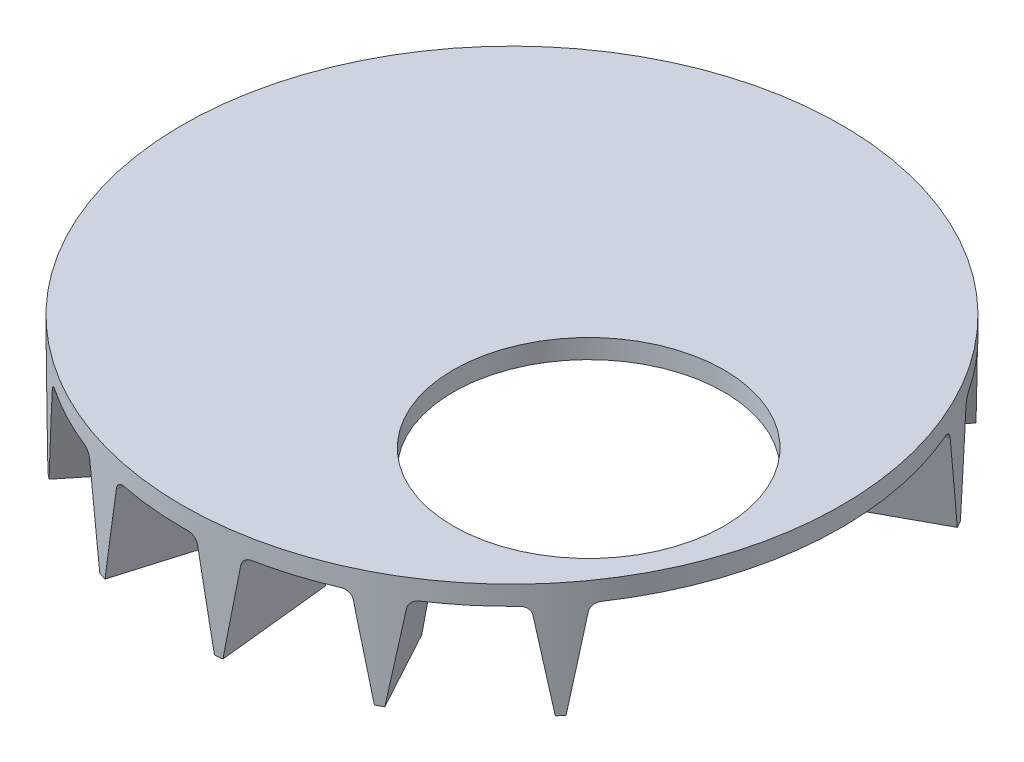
ISO-10303-21;
HEADER;
FILE_DESCRIPTION(('STEP AP214'),'2;1');
FILE_NAME('part.step','',(''),(''),'','','');
FILE_SCHEMA(('AUTOMOTIVE_DESIGN { 1 0 10303 214 1 1 1 1 }'));
ENDSEC;
DATA;
#1=APPLICATION_CONTEXT('core data for automotive mechanical design processes');
#2=APPLICATION_PROTOCOL_DEFINITION('international standard','automotive_design',2000,#1);
#3=PRODUCT_CONTEXT('',#1,'mechanical');
#4=PRODUCT('Part','Part','',(#3));
#5=PRODUCT_RELATED_PRODUCT_CATEGORY('part','',(#4));
#6=PRODUCT_DEFINITION_FORMATION('','',#4);
#7=PRODUCT_DEFINITION_CONTEXT('part definition',#1,'design');
#8=PRODUCT_DEFINITION('design','',#6,#7);
#9=PRODUCT_DEFINITION_SHAPE('','',#8);
#10=(LENGTH_UNIT() NAMED_UNIT(*) SI_UNIT(.MILLI.,.METRE.));
#11=(NAMED_UNIT(*) PLANE_ANGLE_UNIT() SI_UNIT($,.RADIAN.));
#12=(NAMED_UNIT(*) SI_UNIT($,.STERADIAN.) SOLID_ANGLE_UNIT());
#13=UNCERTAINTY_MEASURE_WITH_UNIT(LENGTH_MEASURE(1.E-05),#10,'distance_accuracy_value','');
#14=(GEOMETRIC_REPRESENTATION_CONTEXT(3) GLOBAL_UNCERTAINTY_ASSIGNED_CONTEXT((#13)) GLOBAL_UNIT_ASSIGNED_CONTEXT((#10,
#11,#12)) REPRESENTATION_CONTEXT('',''));
#15=CARTESIAN_POINT('',(0.,0.,0.));
#16=DIRECTION('',(0.,0.,1.));
#17=DIRECTION('',(1.,0.,0.));
#18=AXIS2_PLACEMENT_3D('',#15,#16,#17);
#19=CARTESIAN_POINT('',(0.,-6.35,0.));
#20=DIRECTION('',(0.,1.,0.));
#21=DIRECTION('',(0.,0.,1.));
#22=AXIS2_PLACEMENT_3D('',#19,#20,#21);
#23=PLANE('',#22);
#24=CARTESIAN_POINT('',(0.,-6.35,0.));
#25=DIRECTION('',(0.,1.,0.));
#26=DIRECTION('',(0.,0.,1.));
#27=AXIS2_PLACEMENT_3D('',#24,#25,#26);
#28=CIRCLE('',#27,109.156499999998);
#29=CARTESIAN_POINT('',(60.9347117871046,-6.35,-90.5654591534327));
#30=VERTEX_POINT('',#29);
#31=CARTESIAN_POINT('',(40.1235658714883,-6.35,-101.514732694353));
#32=VERTEX_POINT('',#31);
#33=EDGE_CURVE('E1509',#30,#32,#28,.T.);
#34=ORIENTED_EDGE('',*,*,#33,.F.);
#35=DIRECTION('',(0.629320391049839,0.,-0.77714596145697));
#36=VECTOR('',#35,1.);
#37=CARTESIAN_POINT('',(-7.49131791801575,-6.35,-6.06634963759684));
#38=LINE('',#37,#36);
#39=CARTESIAN_POINT('',(35.2278942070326,-6.35,-58.8201832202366));
#40=VERTEX_POINT('',#39);
#41=EDGE_CURVE('E769',#30,#40,#38,.F.);
#42=ORIENTED_EDGE('',*,*,#41,.T.);
#43=DIRECTION('',(0.777145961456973,0.,0.629320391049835));
#44=VECTOR('',#43,1.);
#45=CARTESIAN_POINT('',(48.1475766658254,-6.35,-48.3580306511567));
#46=LINE('',#45,#44);
#47=CARTESIAN_POINT('',(50.2105300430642,-6.35,-46.687483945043));
#48=VERTEX_POINT('',#47);
#49=EDGE_CURVE('E766',#40,#48,#46,.T.);
#50=ORIENTED_EDGE('',*,*,#49,.T.);
#51=DIRECTION('',(0.629320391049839,0.,-0.77714596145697));
#52=VECTOR('',#51,1.);
#53=CARTESIAN_POINT('',(7.49131791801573,-6.35,6.06634963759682));
#54=LINE('',#53,#52);
#55=CARTESIAN_POINT('',(75.9173476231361,-6.35,-78.432759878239));
#56=VERTEX_POINT('',#55);
#57=EDGE_CURVE('E764',#48,#56,#54,.T.);
#58=ORIENTED_EDGE('',*,*,#57,.T.);
#59=CARTESIAN_POINT('',(90.9542338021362,-6.35,-60.3528694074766));
#60=VERTEX_POINT('',#59);
#61=EDGE_CURVE('E1216',#60,#56,#28,.T.);
#62=ORIENTED_EDGE('',*,*,#61,.F.);
#63=DIRECTION('',(0.878817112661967,0.,-0.477158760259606));
#64=VECTOR('',#63,1.);
#65=CARTESIAN_POINT('',(-4.59958379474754,-6.35,-8.47137952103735));
#66=LINE('',#65,#64);
#67=CARTESIAN_POINT('',(55.055840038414,-6.35,-40.8616319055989));
#68=VERTEX_POINT('',#67);
#69=EDGE_CURVE('E704',#60,#68,#66,.F.);
#70=ORIENTED_EDGE('',*,*,#69,.T.);
#71=DIRECTION('',(0.47715876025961,0.,0.878817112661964));
#72=VECTOR('',#71,1.);
#73=CARTESIAN_POINT('',(62.988377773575,-6.35,-26.2517148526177));
#74=LINE('',#73,#72);
#75=CARTESIAN_POINT('',(64.2550076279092,-6.35,-23.9188728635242));
#76=VERTEX_POINT('',#75);
#77=EDGE_CURVE('E701',#68,#76,#74,.T.);
#78=ORIENTED_EDGE('',*,*,#77,.T.);
#79=DIRECTION('',(0.878817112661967,0.,-0.477158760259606));
#80=VECTOR('',#79,1.);
#81=CARTESIAN_POINT('',(4.59958379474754,-6.35,8.47137952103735));
#82=LINE('',#81,#80);
#83=CARTESIAN_POINT('',(100.153401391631,-6.35,-43.4101103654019));
#84=VERTEX_POINT('',#83);
#85=EDGE_CURVE('E698',#76,#84,#82,.T.);
#86=ORIENTED_EDGE('',*,*,#85,.T.);
#87=CARTESIAN_POINT('',(90.5654591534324,-6.35,60.9347117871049));
#88=VERTEX_POINT('',#87);
#89=EDGE_CURVE('E691',#88,#84,#28,.T.);
#90=ORIENTED_EDGE('',*,*,#89,.F.);
#91=DIRECTION('',(0.777145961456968,0.,0.629320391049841));
#92=VECTOR('',#91,1.);
#93=CARTESIAN_POINT('',(6.06634963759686,-6.35,-7.49131791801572));
#94=LINE('',#93,#92);
#95=CARTESIAN_POINT('',(83.9518006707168,-6.35,55.579076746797));
#96=VERTEX_POINT('',#95);
#97=EDGE_CURVE('E724',#88,#96,#94,.F.);
#98=ORIENTED_EDGE('',*,*,#97,.T.);
#99=CARTESIAN_POINT('',(50.8,-6.35,25.4));
#100=DIRECTION('',(0.,1.,0.));
#101=DIRECTION('',(0.,0.,1.));
#102=AXIS2_PLACEMENT_3D('',#99,#100,#101);
#103=CIRCLE('',#102,44.831);
#104=CARTESIAN_POINT('',(26.3150093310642,-6.35,62.9540116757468));
#105=VERTEX_POINT('',#104);
#106=EDGE_CURVE('E558',#96,#105,#103,.T.);
#107=ORIENTED_EDGE('',*,*,#106,.T.);
#108=DIRECTION('',(-0.878817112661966,0.,0.477158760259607));
#109=VECTOR('',#108,1.);
#110=CARTESIAN_POINT('',(26.2517148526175,-6.35,62.9883777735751));
#111=LINE('',#110,#109);
#112=CARTESIAN_POINT('',(23.918872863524,-6.35,64.2550076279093));
#113=VERTEX_POINT('',#112);
#114=EDGE_CURVE('E758',#105,#113,#111,.T.);
#115=ORIENTED_EDGE('',*,*,#114,.T.);
#116=DIRECTION('',(0.477158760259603,0.,0.878817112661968));
#117=VECTOR('',#116,1.);
#118=CARTESIAN_POINT('',(-8.47137952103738,-6.35,4.5995837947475));
#119=LINE('',#118,#117);
#120=CARTESIAN_POINT('',(43.4101103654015,-6.35,100.153401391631));
#121=VERTEX_POINT('',#120);
#122=EDGE_CURVE('E756',#113,#121,#119,.T.);
#123=ORIENTED_EDGE('',*,*,#122,.T.);
#124=CARTESIAN_POINT('',(20.9521023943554,-6.35,107.126798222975));
#125=VERTEX_POINT('',#124);
#126=EDGE_CURVE('E690',#125,#121,#28,.T.);
#127=ORIENTED_EDGE('',*,*,#126,.F.);
#128=DIRECTION('',(0.104528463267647,0.,0.994521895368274));
#129=VECTOR('',#128,1.);
#130=CARTESIAN_POINT('',(9.5867186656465,-6.35,-1.0076047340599));
#131=LINE('',#130,#129);
#132=CARTESIAN_POINT('',(16.6822675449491,-6.35,66.5020333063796));
#133=VERTEX_POINT('',#132);
#134=EDGE_CURVE('E726',#125,#133,#131,.F.);
#135=ORIENTED_EDGE('',*,*,#134,.T.);
#136=DIRECTION('',(-0.994521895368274,0.,0.104528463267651));
#137=VECTOR('',#136,1.);
#138=CARTESIAN_POINT('',(0.14881344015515,-6.35,68.2397693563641));
#139=LINE('',#138,#137);
#140=CARTESIAN_POINT('',(-2.49116978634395,-6.35,68.5172427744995));
#141=VERTEX_POINT('',#140);
#142=EDGE_CURVE('E728',#133,#141,#139,.T.);
#143=ORIENTED_EDGE('',*,*,#142,.T.);
#144=DIRECTION('',(0.104528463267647,0.,0.994521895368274));
#145=VECTOR('',#144,1.);
#146=CARTESIAN_POINT('',(-9.5867186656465,-6.35,1.0076047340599));
#147=LINE('',#146,#145);
#148=CARTESIAN_POINT('',(1.77866506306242,-6.35,109.142007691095));
#149=VERTEX_POINT('',#148);
#150=EDGE_CURVE('E730',#141,#149,#147,.T.);
#151=ORIENTED_EDGE('',*,*,#150,.T.);
#152=CARTESIAN_POINT('',(-21.6384322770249,-6.35,106.99027872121));
#153=VERTEX_POINT('',#152);
#154=EDGE_CURVE('E1465',#153,#149,#28,.T.);
#155=ORIENTED_EDGE('',*,*,#154,.F.);
#156=DIRECTION('',(-0.28401534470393,0.,0.958819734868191));
#157=VECTOR('',#156,1.);
#158=CARTESIAN_POINT('',(9.24256679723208,-6.35,2.73777301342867));
#159=LINE('',#158,#157);
#160=CARTESIAN_POINT('',(-10.0368208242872,-6.35,67.8238948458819));
#161=VERTEX_POINT('',#160);
#162=EDGE_CURVE('E733',#153,#161,#159,.F.);
#163=ORIENTED_EDGE('',*,*,#162,.T.);
#164=DIRECTION('',(-0.958819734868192,0.,-0.284015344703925));
#165=VECTOR('',#164,1.);
#166=CARTESIAN_POINT('',(-25.9767434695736,-6.35,63.1022746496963));
#167=LINE('',#166,#165);
#168=CARTESIAN_POINT('',(-28.5219544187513,-6.35,62.3483488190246));
#169=VERTEX_POINT('',#168);
#170=EDGE_CURVE('E735',#161,#169,#167,.T.);
#171=ORIENTED_EDGE('',*,*,#170,.T.);
#172=DIRECTION('',(-0.28401534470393,0.,0.958819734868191));
#173=VECTOR('',#172,1.);
#174=CARTESIAN_POINT('',(-9.24256679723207,-6.35,-2.73777301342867));
#175=LINE('',#174,#173);
#176=CARTESIAN_POINT('',(-40.123565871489,-6.35,101.514732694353));
#177=VERTEX_POINT('',#176);
#178=EDGE_CURVE('E738',#169,#177,#175,.T.);
#179=ORIENTED_EDGE('',*,*,#178,.T.);
#180=CARTESIAN_POINT('',(-60.9347117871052,-6.35,90.5654591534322));
#181=VERTEX_POINT('',#180);
#182=EDGE_CURVE('E1515',#181,#177,#28,.T.);
#183=ORIENTED_EDGE('',*,*,#182,.F.);
#184=DIRECTION('',(-0.629320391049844,0.,0.777145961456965));
#185=VECTOR('',#184,1.);
#186=CARTESIAN_POINT('',(7.49131791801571,-6.35,6.06634963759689));
#187=LINE('',#186,#185);
#188=CARTESIAN_POINT('',(-35.2278942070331,-6.35,58.8201832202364));
#189=VERTEX_POINT('',#188);
#190=EDGE_CURVE('E754',#181,#189,#187,.F.);
#191=ORIENTED_EDGE('',*,*,#190,.T.);
#192=DIRECTION('',(-0.777145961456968,0.,-0.629320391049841));
#193=VECTOR('',#192,1.);
#194=CARTESIAN_POINT('',(-48.1475766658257,-6.35,48.3580306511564));
#195=LINE('',#194,#193);
#196=CARTESIAN_POINT('',(-50.2105300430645,-6.35,46.6874839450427));
#197=VERTEX_POINT('',#196);
#198=EDGE_CURVE('E750',#189,#197,#195,.T.);
#199=ORIENTED_EDGE('',*,*,#198,.T.);
#200=DIRECTION('',(-0.629320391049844,0.,0.777145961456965));
#201=VECTOR('',#200,1.);
#202=CARTESIAN_POINT('',(-7.4913179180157,-6.35,-6.06634963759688));
#203=LINE('',#202,#201);
#204=CARTESIAN_POINT('',(-75.9173476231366,-6.35,78.4327598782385));
#205=VERTEX_POINT('',#204);
#206=EDGE_CURVE('E752',#197,#205,#203,.T.);
#207=ORIENTED_EDGE('',*,*,#206,.T.);
#208=CARTESIAN_POINT('',(-107.126798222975,-6.35,20.9521023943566));
#209=VERTEX_POINT('',#208);
#210=EDGE_CURVE('E699',#209,#205,#28,.T.);
#211=ORIENTED_EDGE('',*,*,#210,.F.);
#212=DIRECTION('',(-0.994521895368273,0.,0.104528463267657));
#213=VECTOR('',#212,1.);
#214=CARTESIAN_POINT('',(1.00760473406,-6.35,9.5867186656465));
#215=LINE('',#214,#213);
#216=CARTESIAN_POINT('',(-66.5020333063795,-6.35,16.6822675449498));
#217=VERTEX_POINT('',#216);
#218=EDGE_CURVE('E740',#209,#217,#215,.F.);
#219=ORIENTED_EDGE('',*,*,#218,.T.);
#220=DIRECTION('',(-0.104528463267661,0.,-0.994521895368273));
#221=VECTOR('',#220,1.);
#222=CARTESIAN_POINT('',(-68.2397693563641,-6.35,0.148813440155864));
#223=LINE('',#222,#221);
#224=CARTESIAN_POINT('',(-68.5172427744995,-6.35,-2.49116978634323));
#225=VERTEX_POINT('',#224);
#226=EDGE_CURVE('E742',#217,#225,#223,.T.);
#227=ORIENTED_EDGE('',*,*,#226,.T.);
#228=DIRECTION('',(-0.994521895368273,0.,0.104528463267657));
#229=VECTOR('',#228,1.);
#230=CARTESIAN_POINT('',(-1.00760473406,-6.35,-9.5867186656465));
#231=LINE('',#230,#229);
#232=CARTESIAN_POINT('',(-109.142007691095,-6.35,1.77866506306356));
#233=VERTEX_POINT('',#232);
#234=EDGE_CURVE('E745',#225,#233,#231,.T.);
#235=ORIENTED_EDGE('',*,*,#234,.T.);
#236=CARTESIAN_POINT('',(-90.5654591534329,-6.35,-60.9347117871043));
#237=VERTEX_POINT('',#236);
#238=EDGE_CURVE('E694',#237,#233,#28,.T.);
#239=ORIENTED_EDGE('',*,*,#238,.F.);
#240=DIRECTION('',(-0.777145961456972,0.,-0.629320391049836));
#241=VECTOR('',#240,1.);
#242=CARTESIAN_POINT('',(-6.06634963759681,-6.35,7.49131791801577));
#243=LINE('',#242,#241);
#244=CARTESIAN_POINT('',(-61.2876216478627,-6.35000000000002,-37.2259864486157));
#245=VERTEX_POINT('',#244);
#246=EDGE_CURVE('E761',#237,#245,#243,.F.);
#247=ORIENTED_EDGE('',*,*,#246,.T.);
#248=DIRECTION('',(0.629320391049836,0.,-0.777145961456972));
#249=VECTOR('',#248,1.);
#250=CARTESIAN_POINT('',(-50.8254690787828,-6.35000000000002,-50.1456689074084));
#251=LINE('',#250,#249);
#252=CARTESIAN_POINT('',(-49.1549223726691,-6.35000000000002,-52.2086222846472));
#253=VERTEX_POINT('',#252);
#254=EDGE_CURVE('E664',#245,#253,#251,.T.);
#255=ORIENTED_EDGE('',*,*,#254,.T.);
#256=DIRECTION('',(-0.777145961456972,0.,-0.629320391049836));
#257=VECTOR('',#256,1.);
#258=CARTESIAN_POINT('',(6.06634963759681,-6.35,-7.49131791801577));
#259=LINE('',#258,#257);
#260=CARTESIAN_POINT('',(-78.4327598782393,-6.35,-75.9173476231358));
#261=VERTEX_POINT('',#260);
#262=EDGE_CURVE('E721',#253,#261,#259,.T.);
#263=ORIENTED_EDGE('',*,*,#262,.T.);
#264=CARTESIAN_POINT('',(-60.352869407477,-6.35,-90.954233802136));
#265=VERTEX_POINT('',#264);
#266=EDGE_CURVE('E1513',#265,#261,#28,.T.);
#267=ORIENTED_EDGE('',*,*,#266,.F.);
#268=DIRECTION('',(-0.477158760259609,0.,-0.878817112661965));
#269=VECTOR('',#268,1.);
#270=CARTESIAN_POINT('',(-8.47137952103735,-6.35,4.59958379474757));
#271=LINE('',#270,#269);
#272=CARTESIAN_POINT('',(-42.3766109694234,-6.35000000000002,-57.8460843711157));
#273=VERTEX_POINT('',#272);
#274=EDGE_CURVE('E747',#265,#273,#271,.F.);
#275=ORIENTED_EDGE('',*,*,#274,.T.);
#276=DIRECTION('',(0.878817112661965,0.,-0.47715876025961));
#277=VECTOR('',#276,1.);
#278=CARTESIAN_POINT('',(-27.7666939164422,-6.35000000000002,-65.7786221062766));
#279=LINE('',#278,#277);
#280=CARTESIAN_POINT('',(-25.4338519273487,-6.35000000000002,-67.0452519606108));
#281=VERTEX_POINT('',#280);
#282=EDGE_CURVE('E648',#273,#281,#279,.T.);
#283=ORIENTED_EDGE('',*,*,#282,.T.);
#284=DIRECTION('',(-0.477158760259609,0.,-0.878817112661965));
#285=VECTOR('',#284,1.);
#286=CARTESIAN_POINT('',(8.47137952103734,-6.35,-4.59958379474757));
#287=LINE('',#286,#285);
#288=CARTESIAN_POINT('',(-43.4101103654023,-6.35,-100.153401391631));
#289=VERTEX_POINT('',#288);
#290=EDGE_CURVE('E718',#281,#289,#287,.T.);
#291=ORIENTED_EDGE('',*,*,#290,.T.);
#292=CARTESIAN_POINT('',(-20.9521023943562,-6.35,-107.126798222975));
#293=VERTEX_POINT('',#292);
#294=EDGE_CURVE('E1512',#293,#289,#28,.T.);
#295=ORIENTED_EDGE('',*,*,#294,.F.);
#296=DIRECTION('',(-0.104528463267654,0.,-0.994521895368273));
#297=VECTOR('',#296,1.);
#298=CARTESIAN_POINT('',(-9.5867186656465,-6.35,1.00760473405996));
#299=LINE('',#298,#297);
#300=CARTESIAN_POINT('',(-16.6822675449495,-6.35,-66.5020333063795));
#301=VERTEX_POINT('',#300);
#302=EDGE_CURVE('E716',#293,#301,#299,.F.);
#303=ORIENTED_EDGE('',*,*,#302,.T.);
#304=DIRECTION('',(0.994521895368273,0.,-0.104528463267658));
#305=VECTOR('',#304,1.);
#306=CARTESIAN_POINT('',(-0.148813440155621,-6.35,-68.2397693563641));
#307=LINE('',#306,#305);
#308=CARTESIAN_POINT('',(2.49116978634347,-6.35,-68.5172427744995));
#309=VERTEX_POINT('',#308);
#310=EDGE_CURVE('E714',#301,#309,#307,.T.);
#311=ORIENTED_EDGE('',*,*,#310,.T.);
#312=DIRECTION('',(-0.104528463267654,0.,-0.994521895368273));
#313=VECTOR('',#312,1.);
#314=CARTESIAN_POINT('',(9.5867186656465,-6.35,-1.00760473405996));
#315=LINE('',#314,#313);
#316=CARTESIAN_POINT('',(-1.77866506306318,-6.35,-109.142007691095));
#317=VERTEX_POINT('',#316);
#318=EDGE_CURVE('E712',#309,#317,#315,.T.);
#319=ORIENTED_EDGE('',*,*,#318,.T.);
#320=CARTESIAN_POINT('',(21.6384322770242,-6.35,-106.99027872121));
#321=VERTEX_POINT('',#320);
#322=EDGE_CURVE('E1401',#321,#317,#28,.T.);
#323=ORIENTED_EDGE('',*,*,#322,.F.);
#324=DIRECTION('',(0.284015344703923,0.,-0.958819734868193));
#325=VECTOR('',#324,1.);
#326=CARTESIAN_POINT('',(-9.24256679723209,-6.35,-2.7377730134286));
#327=LINE('',#326,#325);
#328=CARTESIAN_POINT('',(10.0368208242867,-6.35,-67.823894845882));
#329=VERTEX_POINT('',#328);
#330=EDGE_CURVE('E710',#321,#329,#327,.F.);
#331=ORIENTED_EDGE('',*,*,#330,.T.);
#332=DIRECTION('',(0.958819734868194,0.,0.284015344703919));
#333=VECTOR('',#332,1.);
#334=CARTESIAN_POINT('',(25.9767434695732,-6.35,-63.1022746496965));
#335=LINE('',#334,#333);
#336=CARTESIAN_POINT('',(28.5219544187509,-6.35,-62.3483488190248));
#337=VERTEX_POINT('',#336);
#338=EDGE_CURVE('E708',#329,#337,#335,.T.);
#339=ORIENTED_EDGE('',*,*,#338,.T.);
#340=DIRECTION('',(0.284015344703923,0.,-0.958819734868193));
#341=VECTOR('',#340,1.);
#342=CARTESIAN_POINT('',(9.24256679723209,-6.35,2.7377730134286));
#343=LINE('',#342,#341);
#344=EDGE_CURVE('E706',#337,#32,#343,.T.);
#345=ORIENTED_EDGE('',*,*,#344,.T.);
#346=EDGE_LOOP('',(#34,#42,#50,#58,#62,#70,#78,#86,#90,#98,#107,#115,#123,#127,#135,#143,#151,
#155,#163,#171,#179,#183,#191,#199,#207,#211,#219,#227,#235,#239,#247,#255,#263,#267,#275,#283,
#291,#295,#303,#311,#319,#323,#331,#339,#345));
#347=FACE_BOUND('',#346,.T.);
#348=ADVANCED_FACE('F33',(#347),#23,.F.);
#349=CARTESIAN_POINT('',(-71.3973763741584,-6.35000000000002,0.480691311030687));
#350=DIRECTION('',(-0.102875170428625,-0.177152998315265,-0.978791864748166));
#351=DIRECTION('',(0.,0.984012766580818,-0.178097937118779));
#352=AXIS2_PLACEMENT_3D('',#349,#350,#351);
#353=PLANE('',#352);
#354=CARTESIAN_POINT('',(0.,-45.1555555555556,0.));
#355=DIRECTION('',(-0.102875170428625,-0.177152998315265,-0.978791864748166));
#356=DIRECTION('',(-0.0185175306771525,0.984183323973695,-0.17618253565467));
#357=AXIS2_PLACEMENT_3D('',#354,#355,#356);
#358=ELLIPSE('',#357,616.170773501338,109.156499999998);
#359=CARTESIAN_POINT('',(-108.683932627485,-38.1,10.1461461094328));
#360=VERTEX_POINT('',#359);
#361=CARTESIAN_POINT('',(-109.045989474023,-8.96253923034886,4.91056736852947));
#362=VERTEX_POINT('',#361);
#363=EDGE_CURVE('E1306',#360,#362,#358,.T.);
#364=ORIENTED_EDGE('',*,*,#363,.T.);
#365=DIRECTION('',(-0.994521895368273,0.,0.104528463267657));
#366=VECTOR('',#365,1.);
#367=CARTESIAN_POINT('',(-71.3482211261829,-8.96253923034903,0.948372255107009));
#368=LINE('',#367,#366);
#369=CARTESIAN_POINT('',(-71.2982782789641,-8.96253923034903,0.943123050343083));
#370=VERTEX_POINT('',#369);
#371=EDGE_CURVE('E823',#362,#370,#368,.F.);
#372=ORIENTED_EDGE('',*,*,#371,.T.);
#373=CARTESIAN_POINT('',(-68.1800313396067,-9.525,0.717182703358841));
#374=DIRECTION('',(-0.102875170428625,-0.177152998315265,-0.978791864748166));
#375=DIRECTION('',(0.0185175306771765,-0.984183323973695,0.176182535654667));
#376=AXIS2_PLACEMENT_3D('',#373,#374,#375);
#377=ELLIPSE('',#376,3.22602499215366,3.175);
#378=CARTESIAN_POINT('',(-71.3376383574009,-9.525,1.04906057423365));
#379=VERTEX_POINT('',#378);
#380=EDGE_CURVE('E1430',#370,#379,#377,.F.);
#381=ORIENTED_EDGE('',*,*,#380,.T.);
#382=DIRECTION('',(0.0185175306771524,-0.984183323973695,0.17618253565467));
#383=VECTOR('',#382,1.);
#384=CARTESIAN_POINT('',(-71.3973763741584,-6.35000000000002,0.480691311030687));
#385=LINE('',#384,#383);
#386=CARTESIAN_POINT('',(-70.7999962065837,-38.1,6.16438394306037));
#387=VERTEX_POINT('',#386);
#388=EDGE_CURVE('E670',#379,#387,#385,.T.);
#389=ORIENTED_EDGE('',*,*,#388,.T.);
#390=DIRECTION('',(-0.994521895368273,0.,0.104528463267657));
#391=VECTOR('',#390,1.);
#392=CARTESIAN_POINT('',(-70.7999962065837,-38.1,6.16438394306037));
#393=LINE('',#392,#391);
#394=EDGE_CURVE('E680',#387,#360,#393,.T.);
#395=ORIENTED_EDGE('',*,*,#394,.T.);
#396=EDGE_LOOP('',(#364,#372,#381,#389,#395));
#397=FACE_BOUND('',#396,.T.);
#398=ADVANCED_FACE('F1174',(#397),#353,.T.);
#399=CARTESIAN_POINT('',(-69.9371137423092,-6.35000000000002,14.3741621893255));
#400=DIRECTION('',(0.102875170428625,-0.177152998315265,0.978791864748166));
#401=DIRECTION('',(0.,-0.984012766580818,-0.178097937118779));
#402=AXIS2_PLACEMENT_3D('',#399,#400,#401);
#403=PLANE('',#402);
#404=CARTESIAN_POINT('',(-66.8392447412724,-9.525,13.4739150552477));
#405=DIRECTION('',(0.102875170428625,-0.177152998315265,0.978791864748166));
#406=DIRECTION('',(0.0185175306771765,0.984183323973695,0.176182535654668));
#407=AXIS2_PLACEMENT_3D('',#404,#405,#406);
#408=ELLIPSE('',#407,3.22602499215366,3.175);
#409=CARTESIAN_POINT('',(-69.9968517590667,-9.525,13.8057929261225));
#410=VERTEX_POINT('',#409);
#411=CARTESIAN_POINT('',(-69.9363261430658,-8.96253923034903,13.9012320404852));
#412=VERTEX_POINT('',#411);
#413=EDGE_CURVE('E1426',#410,#412,#408,.F.);
#414=ORIENTED_EDGE('',*,*,#413,.T.);
#415=DIRECTION('',(-0.994521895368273,0.,0.104528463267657));
#416=VECTOR('',#415,1.);
#417=CARTESIAN_POINT('',(-69.9862689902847,-8.96253923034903,13.9064812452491));
#418=LINE('',#417,#416);
#419=CARTESIAN_POINT('',(-107.684037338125,-8.96253923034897,17.8686763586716));
#420=VERTEX_POINT('',#419);
#421=EDGE_CURVE('E825',#412,#420,#418,.T.);
#422=ORIENTED_EDGE('',*,*,#421,.T.);
#423=CARTESIAN_POINT('',(0.,-45.1555555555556,0.));
#424=DIRECTION('',(0.102875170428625,-0.177152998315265,0.978791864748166));
#425=DIRECTION('',(0.0185175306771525,0.984183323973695,0.17618253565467));
#426=AXIS2_PLACEMENT_3D('',#423,#424,#425);
#427=ELLIPSE('',#426,616.170773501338,109.156499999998);
#428=CARTESIAN_POINT('',(-108.418430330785,-38.1,12.6722317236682));
#429=VERTEX_POINT('',#428);
#430=EDGE_CURVE('E1304',#420,#429,#427,.T.);
#431=ORIENTED_EDGE('',*,*,#430,.T.);
#432=DIRECTION('',(-0.994521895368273,0.,0.104528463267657));
#433=VECTOR('',#432,1.);
#434=CARTESIAN_POINT('',(-70.5344939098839,-38.1,8.69046955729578));
#435=LINE('',#434,#433);
#436=CARTESIAN_POINT('',(-70.5344939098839,-38.1,8.69046955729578));
#437=VERTEX_POINT('',#436);
#438=EDGE_CURVE('E681',#437,#429,#435,.T.);
#439=ORIENTED_EDGE('',*,*,#438,.F.);
#440=DIRECTION('',(0.0185175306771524,0.984183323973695,0.17618253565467));
#441=VECTOR('',#440,1.);
#442=CARTESIAN_POINT('',(-69.9371137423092,-6.35000000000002,14.3741621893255));
#443=LINE('',#442,#441);
#444=EDGE_CURVE('E677',#437,#410,#443,.T.);
#445=ORIENTED_EDGE('',*,*,#444,.T.);
#446=EDGE_LOOP('',(#414,#422,#431,#439,#445));
#447=FACE_BOUND('',#446,.T.);
#448=ADVANCED_FACE('F1179',(#447),#403,.T.);
#449=CARTESIAN_POINT('',(-70.7999962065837,-38.1,6.16438394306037));
#450=DIRECTION('',(0.,-1.,0.));
#451=DIRECTION('',(0.,0.,-1.));
#452=AXIS2_PLACEMENT_3D('',#449,#450,#451);
#453=PLANE('',#452);
#454=ORIENTED_EDGE('',*,*,#438,.T.);
#455=CARTESIAN_POINT('',(0.,-38.1,0.));
#456=DIRECTION('',(0.,1.,0.));
#457=DIRECTION('',(0.,0.,1.));
#458=AXIS2_PLACEMENT_3D('',#455,#456,#457);
#459=CIRCLE('',#458,109.156499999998);
#460=EDGE_CURVE('E1644',#360,#429,#459,.T.);
#461=ORIENTED_EDGE('',*,*,#460,.F.);
#462=ORIENTED_EDGE('',*,*,#394,.F.);
#463=DIRECTION('',(0.104528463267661,0.,0.994521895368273));
#464=VECTOR('',#463,1.);
#465=CARTESIAN_POINT('',(-70.7999962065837,-38.1,6.16438394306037));
#466=LINE('',#465,#464);
#467=EDGE_CURVE('E674',#387,#437,#466,.T.);
#468=ORIENTED_EDGE('',*,*,#467,.T.);
#469=EDGE_LOOP('',(#454,#461,#462,#468));
#470=FACE_BOUND('',#469,.T.);
#471=ADVANCED_FACE('F1630',(#470),#453,.T.);
#472=CARTESIAN_POINT('',(-50.8254690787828,-6.35000000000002,-50.1456689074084));
#473=DIRECTION('',(0.619366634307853,-0.177152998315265,-0.764854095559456));
#474=DIRECTION('',(-0.777145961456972,0.,-0.629320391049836));
#475=AXIS2_PLACEMENT_3D('',#472,#473,#474);
#476=PLANE('',#475);
#477=CARTESIAN_POINT('',(0.,-45.1555555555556,0.));
#478=DIRECTION('',(0.619366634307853,-0.177152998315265,-0.764854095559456));
#479=DIRECTION('',(0.111485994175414,0.984183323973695,-0.137673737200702));
#480=AXIS2_PLACEMENT_3D('',#477,#478,#479);
#481=ELLIPSE('',#480,616.170773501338,109.156499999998);
#482=CARTESIAN_POINT('',(-84.0255544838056,-38.1,-69.676737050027));
#483=VERTEX_POINT('',#482);
#484=CARTESIAN_POINT('',(-80.579454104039,-8.96253923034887,-73.6348631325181));
#485=VERTEX_POINT('',#484);
#486=EDGE_CURVE('E1299',#483,#485,#481,.T.);
#487=ORIENTED_EDGE('',*,*,#486,.T.);
#488=DIRECTION('',(-0.777145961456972,0.,-0.629320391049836));
#489=VECTOR('',#488,1.);
#490=CARTESIAN_POINT('',(-51.1214114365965,-8.96253923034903,-49.780210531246));
#491=LINE('',#490,#489);
#492=CARTESIAN_POINT('',(-51.1214114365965,-8.96253923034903,-49.780210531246));
#493=VERTEX_POINT('',#492);
#494=EDGE_CURVE('E837',#485,#493,#491,.F.);
#495=ORIENTED_EDGE('',*,*,#494,.T.);
#496=DIRECTION('',(-0.111485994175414,-0.984183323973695,0.137673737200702));
#497=VECTOR('',#496,1.);
#498=CARTESIAN_POINT('',(-50.8254690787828,-6.35000000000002,-50.1456689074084));
#499=LINE('',#498,#497);
#500=CARTESIAN_POINT('',(-54.4220351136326,-38.1,-45.7042797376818));
#501=VERTEX_POINT('',#500);
#502=EDGE_CURVE('E654',#493,#501,#499,.T.);
#503=ORIENTED_EDGE('',*,*,#502,.T.);
#504=DIRECTION('',(-0.777145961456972,0.,-0.629320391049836));
#505=VECTOR('',#504,1.);
#506=CARTESIAN_POINT('',(-54.4220351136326,-38.1,-45.7042797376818));
#507=LINE('',#506,#505);
#508=EDGE_CURVE('E666',#501,#483,#507,.T.);
#509=ORIENTED_EDGE('',*,*,#508,.T.);
#510=EDGE_LOOP('',(#487,#495,#503,#509));
#511=FACE_BOUND('',#510,.T.);
#512=ADVANCED_FACE('F1623',(#511),#476,.T.);
#513=CARTESIAN_POINT('',(-59.617074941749,-6.35000000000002,-39.2889398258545));
#514=DIRECTION('',(-0.619366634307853,-0.177152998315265,0.764854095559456));
#515=DIRECTION('',(0.777145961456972,0.,0.629320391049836));
#516=AXIS2_PLACEMENT_3D('',#513,#514,#515);
#517=PLANE('',#516);
#518=DIRECTION('',(-0.111485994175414,0.984183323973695,0.137673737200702));
#519=VECTOR('',#518,1.);
#520=CARTESIAN_POINT('',(-59.617074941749,-6.35000000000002,-39.2889398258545));
#521=LINE('',#520,#519);
#522=CARTESIAN_POINT('',(-56.0205089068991,-38.1,-43.7303289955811));
#523=VERTEX_POINT('',#522);
#524=CARTESIAN_POINT('',(-59.3211325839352,-8.96253923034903,-39.654398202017));
#525=VERTEX_POINT('',#524);
#526=EDGE_CURVE('E661',#523,#525,#521,.T.);
#527=ORIENTED_EDGE('',*,*,#526,.T.);
#528=DIRECTION('',(-0.777145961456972,0.,-0.629320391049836));
#529=VECTOR('',#528,1.);
#530=CARTESIAN_POINT('',(-59.3211325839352,-8.96253923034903,-39.654398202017));
#531=LINE('',#530,#529);
#532=CARTESIAN_POINT('',(-88.7791752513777,-8.96253923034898,-63.5090508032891));
#533=VERTEX_POINT('',#532);
#534=EDGE_CURVE('E777',#525,#533,#531,.T.);
#535=ORIENTED_EDGE('',*,*,#534,.T.);
#536=CARTESIAN_POINT('',(0.,-45.1555555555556,0.));
#537=DIRECTION('',(-0.619366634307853,-0.177152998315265,0.764854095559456));
#538=DIRECTION('',(-0.111485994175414,0.984183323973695,0.137673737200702));
#539=AXIS2_PLACEMENT_3D('',#536,#537,#538);
#540=ELLIPSE('',#539,616.170773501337,109.156499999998);
#541=CARTESIAN_POINT('',(-85.6240282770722,-38.1,-67.7027863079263));
#542=VERTEX_POINT('',#541);
#543=EDGE_CURVE('E1302',#533,#542,#540,.T.);
#544=ORIENTED_EDGE('',*,*,#543,.T.);
#545=DIRECTION('',(-0.777145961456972,0.,-0.629320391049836));
#546=VECTOR('',#545,1.);
#547=CARTESIAN_POINT('',(-56.0205089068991,-38.1,-43.7303289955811));
#548=LINE('',#547,#546);
#549=EDGE_CURVE('E667',#523,#542,#548,.T.);
#550=ORIENTED_EDGE('',*,*,#549,.F.);
#551=EDGE_LOOP('',(#527,#535,#544,#550));
#552=FACE_BOUND('',#551,.T.);
#553=ADVANCED_FACE('F1620',(#552),#517,.T.);
#554=CARTESIAN_POINT('',(-54.4220351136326,-38.1,-45.7042797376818));
#555=DIRECTION('',(0.,-1.,0.));
#556=DIRECTION('',(0.,0.,-1.));
#557=AXIS2_PLACEMENT_3D('',#554,#555,#556);
#558=PLANE('',#557);
#559=ORIENTED_EDGE('',*,*,#549,.T.);
#560=EDGE_CURVE('E1653',#483,#542,#459,.T.);
#561=ORIENTED_EDGE('',*,*,#560,.F.);
#562=ORIENTED_EDGE('',*,*,#508,.F.);
#563=DIRECTION('',(-0.629320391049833,0.,0.777145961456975));
#564=VECTOR('',#563,1.);
#565=CARTESIAN_POINT('',(-54.4220351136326,-38.1,-45.7042797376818));
#566=LINE('',#565,#564);
#567=EDGE_CURVE('E658',#501,#523,#566,.T.);
#568=ORIENTED_EDGE('',*,*,#567,.T.);
#569=EDGE_LOOP('',(#559,#561,#562,#568));
#570=FACE_BOUND('',#569,.T.);
#571=ADVANCED_FACE('F1615',(#570),#558,.T.);
#572=CARTESIAN_POINT('',(-27.7666939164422,-6.35000000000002,-65.7786221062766));
#573=DIRECTION('',(0.864917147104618,-0.177152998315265,-0.46961169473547));
#574=DIRECTION('',(-0.477158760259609,0.,-0.878817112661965));
#575=AXIS2_PLACEMENT_3D('',#572,#573,#574);
#576=PLANE('',#575);
#577=CARTESIAN_POINT('',(0.,-45.1555555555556,0.));
#578=DIRECTION('',(0.864917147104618,-0.177152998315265,-0.46961169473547));
#579=DIRECTION('',(0.155685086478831,0.984183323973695,-0.0845301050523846));
#580=AXIS2_PLACEMENT_3D('',#577,#578,#579);
#581=ELLIPSE('',#580,616.170773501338,109.156499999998);
#582=CARTESIAN_POINT('',(-50.9653571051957,-38.1,-96.5280988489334));
#583=VERTEX_POINT('',#582);
#584=CARTESIAN_POINT('',(-46.2668662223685,-8.96253923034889,-98.8661650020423));
#585=VERTEX_POINT('',#584);
#586=EDGE_CURVE('E1294',#583,#585,#581,.T.);
#587=ORIENTED_EDGE('',*,*,#586,.T.);
#588=DIRECTION('',(-0.477158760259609,0.,-0.878817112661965));
#589=VECTOR('',#588,1.);
#590=CARTESIAN_POINT('',(-28.1799638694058,-8.96253923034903,-65.5542348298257));
#591=LINE('',#590,#589);
#592=CARTESIAN_POINT('',(-28.1799638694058,-8.96253923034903,-65.5542348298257));
#593=VERTEX_POINT('',#592);
#594=EDGE_CURVE('E839',#585,#593,#591,.F.);
#595=ORIENTED_EDGE('',*,*,#594,.T.);
#596=DIRECTION('',(-0.155685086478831,-0.984183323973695,0.0845301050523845));
#597=VECTOR('',#596,1.);
#598=CARTESIAN_POINT('',(-27.7666939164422,-6.35000000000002,-65.7786221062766));
#599=LINE('',#598,#597);
#600=CARTESIAN_POINT('',(-32.7891337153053,-38.1,-63.051659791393));
#601=VERTEX_POINT('',#600);
#602=EDGE_CURVE('E638',#593,#601,#599,.T.);
#603=ORIENTED_EDGE('',*,*,#602,.T.);
#604=DIRECTION('',(-0.477158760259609,0.,-0.878817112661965));
#605=VECTOR('',#604,1.);
#606=CARTESIAN_POINT('',(-32.7891337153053,-38.1,-63.051659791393));
#607=LINE('',#606,#605);
#608=EDGE_CURVE('E650',#601,#583,#607,.T.);
#609=ORIENTED_EDGE('',*,*,#608,.T.);
#610=EDGE_LOOP('',(#587,#595,#603,#609));
#611=FACE_BOUND('',#610,.T.);
#612=ADVANCED_FACE('F1608',(#611),#576,.T.);
#613=CARTESIAN_POINT('',(-40.0437689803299,-6.35000000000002,-59.1127142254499));
#614=DIRECTION('',(-0.864917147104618,-0.177152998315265,0.46961169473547));
#615=DIRECTION('',(0.477158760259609,0.,0.878817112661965));
#616=AXIS2_PLACEMENT_3D('',#613,#614,#615);
#617=PLANE('',#616);
#618=DIRECTION('',(-0.155685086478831,0.984183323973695,0.0845301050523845));
#619=VECTOR('',#618,1.);
#620=CARTESIAN_POINT('',(-40.0437689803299,-6.35000000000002,-59.1127142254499));
#621=LINE('',#620,#619);
#622=CARTESIAN_POINT('',(-35.0213291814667,-38.1,-61.8396765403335));
#623=VERTEX_POINT('',#622);
#624=CARTESIAN_POINT('',(-39.6304990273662,-8.96253923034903,-59.3371015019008));
#625=VERTEX_POINT('',#624);
#626=EDGE_CURVE('E645',#623,#625,#621,.T.);
#627=ORIENTED_EDGE('',*,*,#626,.T.);
#628=DIRECTION('',(-0.477158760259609,0.,-0.878817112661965));
#629=VECTOR('',#628,1.);
#630=CARTESIAN_POINT('',(-39.6304990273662,-8.96253923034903,-59.3371015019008));
#631=LINE('',#630,#629);
#632=CARTESIAN_POINT('',(-57.7174013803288,-8.96253923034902,-92.6490316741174));
#633=VERTEX_POINT('',#632);
#634=EDGE_CURVE('E807',#625,#633,#631,.T.);
#635=ORIENTED_EDGE('',*,*,#634,.T.);
#636=CARTESIAN_POINT('',(0.,-45.1555555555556,0.));
#637=DIRECTION('',(-0.864917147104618,-0.177152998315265,0.46961169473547));
#638=DIRECTION('',(-0.155685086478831,0.984183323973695,0.0845301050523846));
#639=AXIS2_PLACEMENT_3D('',#636,#637,#638);
#640=ELLIPSE('',#639,616.170773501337,109.156499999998);
#641=CARTESIAN_POINT('',(-53.1975525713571,-38.1,-95.316115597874));
#642=VERTEX_POINT('',#641);
#643=EDGE_CURVE('E1297',#633,#642,#640,.T.);
#644=ORIENTED_EDGE('',*,*,#643,.T.);
#645=DIRECTION('',(-0.477158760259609,0.,-0.878817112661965));
#646=VECTOR('',#645,1.);
#647=CARTESIAN_POINT('',(-35.0213291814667,-38.1,-61.8396765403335));
#648=LINE('',#647,#646);
#649=EDGE_CURVE('E651',#623,#642,#648,.T.);
#650=ORIENTED_EDGE('',*,*,#649,.F.);
#651=EDGE_LOOP('',(#627,#635,#644,#650));
#652=FACE_BOUND('',#651,.T.);
#653=ADVANCED_FACE('F1605',(#652),#617,.T.);
#654=CARTESIAN_POINT('',(-32.7891337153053,-38.1,-63.051659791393));
#655=DIRECTION('',(0.,-1.,0.));
#656=DIRECTION('',(0.,0.,-1.));
#657=AXIS2_PLACEMENT_3D('',#654,#655,#656);
#658=PLANE('',#657);
#659=ORIENTED_EDGE('',*,*,#649,.T.);
#660=EDGE_CURVE('E1656',#583,#642,#459,.T.);
#661=ORIENTED_EDGE('',*,*,#660,.F.);
#662=ORIENTED_EDGE('',*,*,#608,.F.);
#663=DIRECTION('',(-0.878817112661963,0.,0.477158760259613));
#664=VECTOR('',#663,1.);
#665=CARTESIAN_POINT('',(-32.7891337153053,-38.1,-63.051659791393));
#666=LINE('',#665,#664);
#667=EDGE_CURVE('E642',#601,#623,#666,.T.);
#668=ORIENTED_EDGE('',*,*,#667,.T.);
#669=EDGE_LOOP('',(#659,#661,#662,#668));
#670=FACE_BOUND('',#669,.T.);
#671=ADVANCED_FACE('F1601',(#670),#658,.T.);
#672=CARTESIAN_POINT('',(-0.480691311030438,-6.35000000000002,-71.3973763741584));
#673=DIRECTION('',(0.978791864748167,-0.177152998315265,-0.102875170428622));
#674=DIRECTION('',(0.178097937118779,0.984012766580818,0.));
#675=AXIS2_PLACEMENT_3D('',#672,#673,#674);
#676=PLANE('',#675);
#677=CARTESIAN_POINT('',(0.,-45.1555555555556,0.));
#678=DIRECTION('',(0.978791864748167,-0.177152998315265,-0.102875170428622));
#679=DIRECTION('',(0.17618253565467,0.984183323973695,-0.0185175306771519));
#680=AXIS2_PLACEMENT_3D('',#677,#678,#679);
#681=ELLIPSE('',#680,616.170773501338,109.156499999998);
#682=CARTESIAN_POINT('',(-10.1461461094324,-38.1,-108.683932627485));
#683=VERTEX_POINT('',#682);
#684=CARTESIAN_POINT('',(-4.91056736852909,-8.96253923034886,-109.045989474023));
#685=VERTEX_POINT('',#684);
#686=EDGE_CURVE('E1289',#683,#685,#681,.T.);
#687=ORIENTED_EDGE('',*,*,#686,.T.);
#688=DIRECTION('',(-0.104528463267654,0.,-0.994521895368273));
#689=VECTOR('',#688,1.);
#690=CARTESIAN_POINT('',(-0.94837225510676,-8.96253923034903,-71.3482211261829));
#691=LINE('',#690,#689);
#692=CARTESIAN_POINT('',(-0.943123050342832,-8.96253923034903,-71.298278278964));
#693=VERTEX_POINT('',#692);
#694=EDGE_CURVE('E841',#685,#693,#691,.F.);
#695=ORIENTED_EDGE('',*,*,#694,.T.);
#696=CARTESIAN_POINT('',(-0.717182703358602,-9.525,-68.1800313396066));
#697=DIRECTION('',(0.978791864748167,-0.177152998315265,-0.102875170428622));
#698=DIRECTION('',(-0.176182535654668,-0.984183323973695,0.0185175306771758));
#699=AXIS2_PLACEMENT_3D('',#696,#697,#698);
#700=ELLIPSE('',#699,3.22602499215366,3.175);
#701=CARTESIAN_POINT('',(-1.0490605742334,-9.525,-71.3376383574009));
#702=VERTEX_POINT('',#701);
#703=EDGE_CURVE('E1416',#693,#702,#700,.F.);
#704=ORIENTED_EDGE('',*,*,#703,.T.);
#705=DIRECTION('',(-0.17618253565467,-0.984183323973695,0.0185175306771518));
#706=VECTOR('',#705,1.);
#707=CARTESIAN_POINT('',(-0.480691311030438,-6.35000000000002,-71.3973763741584));
#708=LINE('',#707,#706);
#709=CARTESIAN_POINT('',(-6.16438394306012,-38.1,-70.7999962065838));
#710=VERTEX_POINT('',#709);
#711=EDGE_CURVE('E624',#702,#710,#708,.T.);
#712=ORIENTED_EDGE('',*,*,#711,.T.);
#713=DIRECTION('',(-0.104528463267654,0.,-0.994521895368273));
#714=VECTOR('',#713,1.);
#715=CARTESIAN_POINT('',(-6.16438394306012,-38.1,-70.7999962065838));
#716=LINE('',#715,#714);
#717=EDGE_CURVE('E634',#710,#683,#716,.T.);
#718=ORIENTED_EDGE('',*,*,#717,.T.);
#719=EDGE_LOOP('',(#687,#695,#704,#712,#718));
#720=FACE_BOUND('',#719,.T.);
#721=ADVANCED_FACE('F1405',(#720),#676,.T.);
#722=CARTESIAN_POINT('',(-14.3741621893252,-6.35000000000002,-69.9371137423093));
#723=DIRECTION('',(-0.978791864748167,-0.177152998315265,0.102875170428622));
#724=DIRECTION('',(0.178097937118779,-0.984012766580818,0.));
#725=AXIS2_PLACEMENT_3D('',#722,#723,#724);
#726=PLANE('',#725);
#727=DIRECTION('',(-0.17618253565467,0.984183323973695,0.0185175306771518));
#728=VECTOR('',#727,1.);
#729=CARTESIAN_POINT('',(-14.3741621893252,-6.35000000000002,-69.9371137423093));
#730=LINE('',#729,#728);
#731=CARTESIAN_POINT('',(-8.69046955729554,-38.1,-70.5344939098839));
#732=VERTEX_POINT('',#731);
#733=CARTESIAN_POINT('',(-13.8057929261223,-9.525,-69.9968517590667));
#734=VERTEX_POINT('',#733);
#735=EDGE_CURVE('E631',#732,#734,#730,.T.);
#736=ORIENTED_EDGE('',*,*,#735,.T.);
#737=CARTESIAN_POINT('',(-13.4739150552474,-9.525,-66.8392447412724));
#738=DIRECTION('',(-0.978791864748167,-0.177152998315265,0.102875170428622));
#739=DIRECTION('',(-0.176182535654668,0.984183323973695,0.0185175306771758));
#740=AXIS2_PLACEMENT_3D('',#737,#738,#739);
#741=ELLIPSE('',#740,3.22602499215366,3.175);
#742=CARTESIAN_POINT('',(-13.901232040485,-8.96253923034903,-69.9363261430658));
#743=VERTEX_POINT('',#742);
#744=EDGE_CURVE('E1419',#734,#743,#741,.F.);
#745=ORIENTED_EDGE('',*,*,#744,.T.);
#746=DIRECTION('',(-0.104528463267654,0.,-0.994521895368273));
#747=VECTOR('',#746,1.);
#748=CARTESIAN_POINT('',(-13.9064812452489,-8.96253923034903,-69.9862689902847));
#749=LINE('',#748,#747);
#750=CARTESIAN_POINT('',(-17.8686763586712,-8.96253923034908,-107.684037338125));
#751=VERTEX_POINT('',#750);
#752=EDGE_CURVE('E810',#743,#751,#749,.T.);
#753=ORIENTED_EDGE('',*,*,#752,.T.);
#754=CARTESIAN_POINT('',(0.,-45.1555555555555,0.));
#755=DIRECTION('',(-0.978791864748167,-0.177152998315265,0.102875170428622));
#756=DIRECTION('',(-0.17618253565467,0.984183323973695,0.0185175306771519));
#757=AXIS2_PLACEMENT_3D('',#754,#755,#756);
#758=ELLIPSE('',#757,616.170773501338,109.156499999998);
#759=CARTESIAN_POINT('',(-12.6722317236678,-38.1,-108.418430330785));
#760=VERTEX_POINT('',#759);
#761=EDGE_CURVE('E1292',#751,#760,#758,.T.);
#762=ORIENTED_EDGE('',*,*,#761,.T.);
#763=DIRECTION('',(-0.104528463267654,0.,-0.994521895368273));
#764=VECTOR('',#763,1.);
#765=CARTESIAN_POINT('',(-8.69046955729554,-38.1,-70.5344939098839));
#766=LINE('',#765,#764);
#767=EDGE_CURVE('E635',#732,#760,#766,.T.);
#768=ORIENTED_EDGE('',*,*,#767,.F.);
#769=EDGE_LOOP('',(#736,#745,#753,#762,#768));
#770=FACE_BOUND('',#769,.T.);
#771=ADVANCED_FACE('F1592',(#770),#726,.T.);
#772=CARTESIAN_POINT('',(-6.16438394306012,-38.1,-70.7999962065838));
#773=DIRECTION('',(0.,-1.,0.));
#774=DIRECTION('',(0.,0.,-1.));
#775=AXIS2_PLACEMENT_3D('',#772,#773,#774);
#776=PLANE('',#775);
#777=ORIENTED_EDGE('',*,*,#767,.T.);
#778=EDGE_CURVE('E1250',#683,#760,#459,.T.);
#779=ORIENTED_EDGE('',*,*,#778,.F.);
#780=ORIENTED_EDGE('',*,*,#717,.F.);
#781=DIRECTION('',(-0.994521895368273,0.,0.104528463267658));
#782=VECTOR('',#781,1.);
#783=CARTESIAN_POINT('',(-6.16438394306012,-38.1,-70.7999962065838));
#784=LINE('',#783,#782);
#785=EDGE_CURVE('E628',#710,#732,#784,.T.);
#786=ORIENTED_EDGE('',*,*,#785,.T.);
#787=EDGE_LOOP('',(#777,#779,#780,#786));
#788=FACE_BOUND('',#787,.T.);
#789=ADVANCED_FACE('F1582',(#788),#776,.T.);
#790=CARTESIAN_POINT('',(26.8784921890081,-6.35000000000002,-66.146527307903));
#791=DIRECTION('',(0.943654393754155,-0.177152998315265,0.279523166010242));
#792=DIRECTION('',(0.284015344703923,0.,-0.958819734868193));
#793=AXIS2_PLACEMENT_3D('',#790,#791,#792);
#794=PLANE('',#793);
#795=CARTESIAN_POINT('',(0.,-45.1555555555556,0.));
#796=DIRECTION('',(0.943654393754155,-0.177152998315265,0.279523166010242));
#797=DIRECTION('',(0.169857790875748,0.984183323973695,0.0503141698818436));
#798=AXIS2_PLACEMENT_3D('',#795,#796,#797);
#799=ELLIPSE('',#798,616.170773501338,109.156499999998);
#800=CARTESIAN_POINT('',(32.2177236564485,-38.1,-104.293622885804));
#801=VERTEX_POINT('',#800);
#802=CARTESIAN_POINT('',(37.1933208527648,-8.96253923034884,-102.62455055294));
#803=VERTEX_POINT('',#802);
#804=EDGE_CURVE('E1284',#801,#803,#799,.T.);
#805=ORIENTED_EDGE('',*,*,#804,.T.);
#806=DIRECTION('',(0.284015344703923,0.,-0.958819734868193));
#807=VECTOR('',#806,1.);
#808=CARTESIAN_POINT('',(26.4276004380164,-8.96253923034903,-66.2800875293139));
#809=LINE('',#808,#807);
#810=CARTESIAN_POINT('',(26.413337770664,-8.96253923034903,-66.2319375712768));
#811=VERTEX_POINT('',#810);
#812=EDGE_CURVE('E843',#803,#811,#809,.F.);
#813=ORIENTED_EDGE('',*,*,#812,.T.);
#814=CARTESIAN_POINT('',(25.428777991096,-9.525,-63.2645894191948));
#815=DIRECTION('',(0.943654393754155,-0.177152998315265,0.279523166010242));
#816=DIRECTION('',(-0.169857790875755,-0.984183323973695,-0.0503141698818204));
#817=AXIS2_PLACEMENT_3D('',#814,#815,#816);
#818=ELLIPSE('',#817,3.22602499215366,3.175);
#819=CARTESIAN_POINT('',(26.330526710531,-9.525,-66.3088420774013));
#820=VERTEX_POINT('',#819);
#821=EDGE_CURVE('E1551',#811,#820,#818,.F.);
#822=ORIENTED_EDGE('',*,*,#821,.T.);
#823=DIRECTION('',(-0.169857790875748,-0.984183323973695,-0.0503141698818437));
#824=VECTOR('',#823,1.);
#825=CARTESIAN_POINT('',(26.8784921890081,-6.35000000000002,-66.146527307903));
#826=LINE('',#825,#824);
#827=CARTESIAN_POINT('',(21.3988374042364,-38.1,-67.769675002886));
#828=VERTEX_POINT('',#827);
#829=EDGE_CURVE('E610',#820,#828,#826,.T.);
#830=ORIENTED_EDGE('',*,*,#829,.T.);
#831=DIRECTION('',(0.284015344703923,0.,-0.958819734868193));
#832=VECTOR('',#831,1.);
#833=CARTESIAN_POINT('',(21.3988374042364,-38.1,-67.769675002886));
#834=LINE('',#833,#832);
#835=EDGE_CURVE('E620',#828,#801,#834,.T.);
#836=ORIENTED_EDGE('',*,*,#835,.T.);
#837=EDGE_LOOP('',(#805,#813,#822,#830,#836));
#838=FACE_BOUND('',#837,.T.);
#839=ADVANCED_FACE('F1565',(#838),#794,.T.);
#840=CARTESIAN_POINT('',(13.4837804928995,-6.35000000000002,-70.1142216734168));
#841=DIRECTION('',(-0.943654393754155,-0.177152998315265,-0.279523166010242));
#842=DIRECTION('',(-0.284015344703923,0.,0.958819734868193));
#843=AXIS2_PLACEMENT_3D('',#840,#841,#842);
#844=PLANE('',#843);
#845=DIRECTION('',(-0.169857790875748,0.984183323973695,-0.0503141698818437));
#846=VECTOR('',#845,1.);
#847=CARTESIAN_POINT('',(13.4837804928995,-6.35000000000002,-70.1142216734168));
#848=LINE('',#847,#846);
#849=CARTESIAN_POINT('',(18.9634352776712,-38.1,-68.4910739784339));
#850=VERTEX_POINT('',#849);
#851=CARTESIAN_POINT('',(14.0317459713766,-9.525,-69.9519069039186));
#852=VERTEX_POINT('',#851);
#853=EDGE_CURVE('E617',#850,#852,#848,.T.);
#854=ORIENTED_EDGE('',*,*,#853,.T.);
#855=CARTESIAN_POINT('',(13.1299972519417,-9.525,-66.907654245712));
#856=DIRECTION('',(-0.943654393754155,-0.177152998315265,-0.279523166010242));
#857=DIRECTION('',(-0.169857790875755,0.984183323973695,-0.0503141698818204));
#858=AXIS2_PLACEMENT_3D('',#855,#856,#857);
#859=ELLIPSE('',#858,3.22602499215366,3.175);
#860=CARTESIAN_POINT('',(13.9204095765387,-8.96253923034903,-69.9325114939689));
#861=VERTEX_POINT('',#860);
#862=EDGE_CURVE('E1547',#852,#861,#859,.F.);
#863=ORIENTED_EDGE('',*,*,#862,.T.);
#864=DIRECTION('',(0.284015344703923,0.,-0.958819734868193));
#865=VECTOR('',#864,1.);
#866=CARTESIAN_POINT('',(13.9346722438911,-8.96253923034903,-69.980661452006));
#867=LINE('',#866,#865);
#868=CARTESIAN_POINT('',(24.7003926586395,-8.9625392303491,-106.325124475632));
#869=VERTEX_POINT('',#868);
#870=EDGE_CURVE('E815',#861,#869,#867,.T.);
#871=ORIENTED_EDGE('',*,*,#870,.T.);
#872=CARTESIAN_POINT('',(0.,-45.1555555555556,0.));
#873=DIRECTION('',(-0.943654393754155,-0.177152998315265,-0.279523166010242));
#874=DIRECTION('',(-0.169857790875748,0.984183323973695,-0.0503141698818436));
#875=AXIS2_PLACEMENT_3D('',#872,#873,#874);
#876=ELLIPSE('',#875,616.170773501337,109.156499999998);
#877=CARTESIAN_POINT('',(29.7823215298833,-38.1,-105.015021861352));
#878=VERTEX_POINT('',#877);
#879=EDGE_CURVE('E1287',#869,#878,#876,.T.);
#880=ORIENTED_EDGE('',*,*,#879,.T.);
#881=DIRECTION('',(0.284015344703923,0.,-0.958819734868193));
#882=VECTOR('',#881,1.);
#883=CARTESIAN_POINT('',(18.9634352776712,-38.1,-68.4910739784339));
#884=LINE('',#883,#882);
#885=EDGE_CURVE('E621',#850,#878,#884,.T.);
#886=ORIENTED_EDGE('',*,*,#885,.F.);
#887=EDGE_LOOP('',(#854,#863,#871,#880,#886));
#888=FACE_BOUND('',#887,.T.);
#889=ADVANCED_FACE('F1574',(#888),#844,.T.);
#890=CARTESIAN_POINT('',(21.3988374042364,-38.1,-67.769675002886));
#891=DIRECTION('',(0.,-1.,0.));
#892=DIRECTION('',(0.,0.,-1.));
#893=AXIS2_PLACEMENT_3D('',#890,#891,#892);
#894=PLANE('',#893);
#895=ORIENTED_EDGE('',*,*,#885,.T.);
#896=EDGE_CURVE('E1246',#801,#878,#459,.T.);
#897=ORIENTED_EDGE('',*,*,#896,.F.);
#898=ORIENTED_EDGE('',*,*,#835,.F.);
#899=DIRECTION('',(-0.958819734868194,0.,-0.284015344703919));
#900=VECTOR('',#899,1.);
#901=CARTESIAN_POINT('',(21.3988374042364,-38.1,-67.769675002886));
#902=LINE('',#901,#900);
#903=EDGE_CURVE('E614',#828,#850,#902,.T.);
#904=ORIENTED_EDGE('',*,*,#903,.T.);
#905=EDGE_LOOP('',(#895,#897,#898,#904));
#906=FACE_BOUND('',#905,.T.);
#907=ADVANCED_FACE('F1569',(#906),#894,.T.);
#908=CARTESIAN_POINT('',(50.1456689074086,-6.35000000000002,-50.8254690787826));
#909=DIRECTION('',(0.764854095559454,-0.177152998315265,0.619366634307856));
#910=DIRECTION('',(0.629320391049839,0.,-0.77714596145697));
#911=AXIS2_PLACEMENT_3D('',#908,#909,#910);
#912=PLANE('',#911);
#913=CARTESIAN_POINT('',(0.,-45.1555555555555,0.));
#914=DIRECTION('',(0.764854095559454,-0.177152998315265,0.619366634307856));
#915=DIRECTION('',(0.137673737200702,0.984183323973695,0.111485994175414));
#916=AXIS2_PLACEMENT_3D('',#913,#914,#915);
#917=ELLIPSE('',#916,616.170773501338,109.156499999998);
#918=CARTESIAN_POINT('',(69.6767370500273,-38.1,-84.0255544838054));
#919=VERTEX_POINT('',#918);
#920=CARTESIAN_POINT('',(73.6348631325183,-8.96253923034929,-80.5794541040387));
#921=VERTEX_POINT('',#920);
#922=EDGE_CURVE('E1213',#919,#921,#917,.T.);
#923=ORIENTED_EDGE('',*,*,#922,.T.);
#924=DIRECTION('',(0.629320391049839,0.,-0.77714596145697));
#925=VECTOR('',#924,1.);
#926=CARTESIAN_POINT('',(49.7802105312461,-8.96253923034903,-51.1214114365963));
#927=LINE('',#926,#925);
#928=CARTESIAN_POINT('',(49.7486073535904,-8.96253923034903,-51.0823847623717));
#929=VERTEX_POINT('',#928);
#930=EDGE_CURVE('E775',#921,#929,#927,.F.);
#931=ORIENTED_EDGE('',*,*,#930,.T.);
#932=CARTESIAN_POINT('',(47.7034377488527,-9.525,-48.7176872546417));
#933=DIRECTION('',(0.764854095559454,-0.177152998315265,0.619366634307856));
#934=DIRECTION('',(-0.137673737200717,-0.984183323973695,-0.111485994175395));
#935=AXIS2_PLACEMENT_3D('',#932,#933,#934);
#936=ELLIPSE('',#935,3.22602499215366,3.175);
#937=CARTESIAN_POINT('',(49.7015299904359,-9.525,-51.1851256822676));
#938=VERTEX_POINT('',#937);
#939=EDGE_CURVE('E846',#929,#938,#936,.F.);
#940=ORIENTED_EDGE('',*,*,#939,.T.);
#941=DIRECTION('',(-0.137673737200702,-0.984183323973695,-0.111485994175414));
#942=VECTOR('',#941,1.);
#943=CARTESIAN_POINT('',(50.1456689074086,-6.35000000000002,-50.8254690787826));
#944=LINE('',#943,#942);
#945=CARTESIAN_POINT('',(45.704279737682,-38.1,-54.4220351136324));
#946=VERTEX_POINT('',#945);
#947=EDGE_CURVE('E596',#938,#946,#944,.T.);
#948=ORIENTED_EDGE('',*,*,#947,.T.);
#949=DIRECTION('',(0.629320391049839,0.,-0.77714596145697));
#950=VECTOR('',#949,1.);
#951=CARTESIAN_POINT('',(45.704279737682,-38.1,-54.4220351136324));
#952=LINE('',#951,#950);
#953=EDGE_CURVE('E606',#946,#919,#952,.T.);
#954=ORIENTED_EDGE('',*,*,#953,.T.);
#955=EDGE_LOOP('',(#923,#931,#940,#948,#954));
#956=FACE_BOUND('',#955,.T.);
#957=ADVANCED_FACE('F1221',(#956),#912,.T.);
#958=CARTESIAN_POINT('',(39.2889398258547,-6.35000000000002,-59.6170749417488));
#959=DIRECTION('',(-0.764854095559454,-0.177152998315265,-0.619366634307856));
#960=DIRECTION('',(-0.629320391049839,0.,0.77714596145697));
#961=AXIS2_PLACEMENT_3D('',#958,#959,#960);
#962=PLANE('',#961);
#963=CARTESIAN_POINT('',(37.7349865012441,-9.525,-56.7899799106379));
#964=DIRECTION('',(-0.764854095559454,-0.177152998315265,-0.619366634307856));
#965=DIRECTION('',(-0.137673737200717,0.984183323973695,-0.111485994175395));
#966=AXIS2_PLACEMENT_3D('',#963,#964,#965);
#967=ELLIPSE('',#966,3.22602499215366,3.175);
#968=CARTESIAN_POINT('',(39.7330787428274,-9.525,-59.2574183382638));
#969=VERTEX_POINT('',#968);
#970=CARTESIAN_POINT('',(39.6227950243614,-8.96253923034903,-59.2821059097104));
#971=VERTEX_POINT('',#970);
#972=EDGE_CURVE('E848',#969,#971,#967,.F.);
#973=ORIENTED_EDGE('',*,*,#972,.T.);
#974=DIRECTION('',(0.629320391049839,0.,-0.77714596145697));
#975=VECTOR('',#974,1.);
#976=CARTESIAN_POINT('',(39.6543982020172,-8.96253923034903,-59.3211325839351));
#977=LINE('',#976,#975);
#978=CARTESIAN_POINT('',(63.5090508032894,-8.96253923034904,-88.7791752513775));
#979=VERTEX_POINT('',#978);
#980=EDGE_CURVE('E773',#971,#979,#977,.T.);
#981=ORIENTED_EDGE('',*,*,#980,.T.);
#982=CARTESIAN_POINT('',(0.,-45.1555555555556,0.));
#983=DIRECTION('',(-0.764854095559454,-0.177152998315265,-0.619366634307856));
#984=DIRECTION('',(-0.137673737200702,0.984183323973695,-0.111485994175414));
#985=AXIS2_PLACEMENT_3D('',#982,#983,#984);
#986=ELLIPSE('',#985,616.170773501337,109.156499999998);
#987=CARTESIAN_POINT('',(67.7027863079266,-38.1,-85.6240282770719));
#988=VERTEX_POINT('',#987);
#989=EDGE_CURVE('E1224',#979,#988,#986,.T.);
#990=ORIENTED_EDGE('',*,*,#989,.T.);
#991=DIRECTION('',(0.629320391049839,0.,-0.77714596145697));
#992=VECTOR('',#991,1.);
#993=CARTESIAN_POINT('',(43.7303289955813,-38.1,-56.020508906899));
#994=LINE('',#993,#992);
#995=CARTESIAN_POINT('',(43.7303289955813,-38.1,-56.020508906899));
#996=VERTEX_POINT('',#995);
#997=EDGE_CURVE('E607',#996,#988,#994,.T.);
#998=ORIENTED_EDGE('',*,*,#997,.F.);
#999=DIRECTION('',(-0.137673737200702,0.984183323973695,-0.111485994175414));
#1000=VECTOR('',#999,1.);
#1001=CARTESIAN_POINT('',(39.2889398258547,-6.35000000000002,-59.6170749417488));
#1002=LINE('',#1001,#1000);
#1003=EDGE_CURVE('E603',#996,#969,#1002,.T.);
#1004=ORIENTED_EDGE('',*,*,#1003,.T.);
#1005=EDGE_LOOP('',(#973,#981,#990,#998,#1004));
#1006=FACE_BOUND('',#1005,.T.);
#1007=ADVANCED_FACE('F1730',(#1006),#962,.T.);
#1008=CARTESIAN_POINT('',(45.704279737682,-38.1,-54.4220351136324));
#1009=DIRECTION('',(0.,-1.,0.));
#1010=DIRECTION('',(0.,0.,-1.));
#1011=AXIS2_PLACEMENT_3D('',#1008,#1009,#1010);
#1012=PLANE('',#1011);
#1013=ORIENTED_EDGE('',*,*,#997,.T.);
#1014=EDGE_CURVE('E1243',#919,#988,#459,.T.);
#1015=ORIENTED_EDGE('',*,*,#1014,.F.);
#1016=ORIENTED_EDGE('',*,*,#953,.F.);
#1017=DIRECTION('',(-0.777145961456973,0.,-0.629320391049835));
#1018=VECTOR('',#1017,1.);
#1019=CARTESIAN_POINT('',(45.704279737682,-38.1,-54.4220351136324));
#1020=LINE('',#1019,#1018);
#1021=EDGE_CURVE('E600',#946,#996,#1020,.T.);
#1022=ORIENTED_EDGE('',*,*,#1021,.T.);
#1023=EDGE_LOOP('',(#1013,#1015,#1016,#1022));
#1024=FACE_BOUND('',#1023,.T.);
#1025=ADVANCED_FACE('F1242',(#1024),#1012,.T.);
#1026=CARTESIAN_POINT('',(65.7786221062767,-6.35000000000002,-27.766693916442));
#1027=DIRECTION('',(0.469611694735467,-0.177152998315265,0.86491714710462));
#1028=DIRECTION('',(0.878817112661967,0.,-0.477158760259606));
#1029=AXIS2_PLACEMENT_3D('',#1026,#1027,#1028);
#1030=PLANE('',#1029);
#1031=CARTESIAN_POINT('',(0.,-45.1555555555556,0.));
#1032=DIRECTION('',(0.469611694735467,-0.177152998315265,0.86491714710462));
#1033=DIRECTION('',(0.084530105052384,0.984183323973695,0.155685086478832));
#1034=AXIS2_PLACEMENT_3D('',#1031,#1032,#1033);
#1035=ELLIPSE('',#1034,616.170773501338,109.156499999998);
#1036=CARTESIAN_POINT('',(96.5280988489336,-38.1,-50.9653571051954));
#1037=VERTEX_POINT('',#1036);
#1038=CARTESIAN_POINT('',(98.8661650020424,-8.96253923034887,-46.2668662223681));
#1039=VERTEX_POINT('',#1038);
#1040=EDGE_CURVE('E1280',#1037,#1039,#1035,.T.);
#1041=ORIENTED_EDGE('',*,*,#1040,.T.);
#1042=DIRECTION('',(0.878817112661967,0.,-0.477158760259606));
#1043=VECTOR('',#1042,1.);
#1044=CARTESIAN_POINT('',(65.5542348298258,-8.96253923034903,-28.1799638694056));
#1045=LINE('',#1044,#1043);
#1046=CARTESIAN_POINT('',(65.5101024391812,-8.96253923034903,-28.1560019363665));
#1047=VERTEX_POINT('',#1046);
#1048=EDGE_CURVE('E59',#1039,#1047,#1045,.F.);
#1049=ORIENTED_EDGE('',*,*,#1048,.T.);
#1050=CARTESIAN_POINT('',(62.7156815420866,-9.525,-26.753958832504));
#1051=DIRECTION('',(0.469611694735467,-0.177152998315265,0.86491714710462));
#1052=DIRECTION('',(-0.0845301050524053,-0.984183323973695,-0.15568508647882));
#1053=AXIS2_PLACEMENT_3D('',#1050,#1051,#1052);
#1054=ELLIPSE('',#1053,3.22602499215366,3.175);
#1055=CARTESIAN_POINT('',(65.5059258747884,-9.525,-28.2689378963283));
#1056=VERTEX_POINT('',#1055);
#1057=EDGE_CURVE('E1545',#1047,#1056,#1054,.F.);
#1058=ORIENTED_EDGE('',*,*,#1057,.T.);
#1059=DIRECTION('',(-0.084530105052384,-0.984183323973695,-0.155685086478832));
#1060=VECTOR('',#1059,1.);
#1061=CARTESIAN_POINT('',(65.7786221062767,-6.35000000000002,-27.766693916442));
#1062=LINE('',#1061,#1060);
#1063=CARTESIAN_POINT('',(63.0516597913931,-38.1,-32.7891337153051));
#1064=VERTEX_POINT('',#1063);
#1065=EDGE_CURVE('E578',#1056,#1064,#1062,.T.);
#1066=ORIENTED_EDGE('',*,*,#1065,.T.);
#1067=DIRECTION('',(0.878817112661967,0.,-0.477158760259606));
#1068=VECTOR('',#1067,1.);
#1069=CARTESIAN_POINT('',(63.0516597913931,-38.1,-32.7891337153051));
#1070=LINE('',#1069,#1068);
#1071=EDGE_CURVE('E592',#1064,#1037,#1070,.T.);
#1072=ORIENTED_EDGE('',*,*,#1071,.T.);
#1073=EDGE_LOOP('',(#1041,#1049,#1058,#1066,#1072));
#1074=FACE_BOUND('',#1073,.T.);
#1075=ADVANCED_FACE('F1722',(#1074),#1030,.T.);
#1076=CARTESIAN_POINT('',(59.11271422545,-6.35000000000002,-40.0437689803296));
#1077=DIRECTION('',(-0.469611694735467,-0.177152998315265,-0.86491714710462));
#1078=DIRECTION('',(-0.878817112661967,0.,0.477158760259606));
#1079=AXIS2_PLACEMENT_3D('',#1076,#1077,#1078);
#1080=PLANE('',#1079);
#1081=CARTESIAN_POINT('',(56.5951661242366,-9.525,-38.0265459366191));
#1082=DIRECTION('',(-0.469611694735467,-0.177152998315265,-0.86491714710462));
#1083=DIRECTION('',(-0.0845301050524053,0.984183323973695,-0.15568508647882));
#1084=AXIS2_PLACEMENT_3D('',#1081,#1082,#1083);
#1085=ELLIPSE('',#1084,3.22602499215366,3.175);
#1086=CARTESIAN_POINT('',(59.3854104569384,-9.525,-39.5415250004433));
#1087=VERTEX_POINT('',#1086);
#1088=CARTESIAN_POINT('',(59.2929691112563,-8.96253923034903,-39.6065370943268));
#1089=VERTEX_POINT('',#1088);
#1090=EDGE_CURVE('E1507',#1087,#1089,#1085,.F.);
#1091=ORIENTED_EDGE('',*,*,#1090,.T.);
#1092=DIRECTION('',(0.878817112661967,0.,-0.477158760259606));
#1093=VECTOR('',#1092,1.);
#1094=CARTESIAN_POINT('',(59.3371015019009,-8.96253923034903,-39.630499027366));
#1095=LINE('',#1094,#1093);
#1096=CARTESIAN_POINT('',(92.6490316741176,-8.9625392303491,-57.7174013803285));
#1097=VERTEX_POINT('',#1096);
#1098=EDGE_CURVE('E51',#1089,#1097,#1095,.T.);
#1099=ORIENTED_EDGE('',*,*,#1098,.T.);
#1100=CARTESIAN_POINT('',(0.,-45.1555555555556,0.));
#1101=DIRECTION('',(-0.469611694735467,-0.177152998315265,-0.86491714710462));
#1102=DIRECTION('',(-0.0845301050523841,0.984183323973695,-0.155685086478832));
#1103=AXIS2_PLACEMENT_3D('',#1100,#1101,#1102);
#1104=ELLIPSE('',#1103,616.170773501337,109.156499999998);
#1105=CARTESIAN_POINT('',(95.3161155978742,-38.1,-53.1975525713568));
#1106=VERTEX_POINT('',#1105);
#1107=EDGE_CURVE('E1225',#1097,#1106,#1104,.T.);
#1108=ORIENTED_EDGE('',*,*,#1107,.T.);
#1109=DIRECTION('',(0.878817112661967,0.,-0.477158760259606));
#1110=VECTOR('',#1109,1.);
#1111=CARTESIAN_POINT('',(61.8396765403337,-38.1,-35.0213291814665));
#1112=LINE('',#1111,#1110);
#1113=CARTESIAN_POINT('',(61.8396765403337,-38.1,-35.0213291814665));
#1114=VERTEX_POINT('',#1113);
#1115=EDGE_CURVE('E593',#1114,#1106,#1112,.T.);
#1116=ORIENTED_EDGE('',*,*,#1115,.F.);
#1117=DIRECTION('',(-0.084530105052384,0.984183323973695,-0.155685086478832));
#1118=VECTOR('',#1117,1.);
#1119=CARTESIAN_POINT('',(59.11271422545,-6.35000000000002,-40.0437689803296));
#1120=LINE('',#1119,#1118);
#1121=EDGE_CURVE('E589',#1114,#1087,#1120,.T.);
#1122=ORIENTED_EDGE('',*,*,#1121,.T.);
#1123=EDGE_LOOP('',(#1091,#1099,#1108,#1116,#1122));
#1124=FACE_BOUND('',#1123,.T.);
#1125=ADVANCED_FACE('F1719',(#1124),#1080,.T.);
#1126=CARTESIAN_POINT('',(63.0516597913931,-38.1,-32.7891337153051));
#1127=DIRECTION('',(0.,-1.,0.));
#1128=DIRECTION('',(0.,0.,-1.));
#1129=AXIS2_PLACEMENT_3D('',#1126,#1127,#1128);
#1130=PLANE('',#1129);
#1131=ORIENTED_EDGE('',*,*,#1115,.T.);
#1132=EDGE_CURVE('E1245',#1037,#1106,#459,.T.);
#1133=ORIENTED_EDGE('',*,*,#1132,.F.);
#1134=ORIENTED_EDGE('',*,*,#1071,.F.);
#1135=DIRECTION('',(-0.47715876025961,0.,-0.878817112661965));
#1136=VECTOR('',#1135,1.);
#1137=CARTESIAN_POINT('',(63.0516597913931,-38.1,-32.7891337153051));
#1138=LINE('',#1137,#1136);
#1139=EDGE_CURVE('E586',#1064,#1114,#1138,.T.);
#1140=ORIENTED_EDGE('',*,*,#1139,.T.);
#1141=EDGE_LOOP('',(#1131,#1133,#1134,#1140));
#1142=FACE_BOUND('',#1141,.T.);
#1143=ADVANCED_FACE('F1715',(#1142),#1130,.T.);
#1144=CARTESIAN_POINT('',(50.8254690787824,-6.35000000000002,50.1456689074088));
#1145=DIRECTION('',(-0.619366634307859,-0.177152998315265,0.764854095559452));
#1146=DIRECTION('',(0.777145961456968,0.,0.629320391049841));
#1147=AXIS2_PLACEMENT_3D('',#1144,#1145,#1146);
#1148=PLANE('',#1147);
#1149=CARTESIAN_POINT('',(0.,-45.1555555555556,0.));
#1150=DIRECTION('',(-0.619366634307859,-0.177152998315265,0.764854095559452));
#1151=DIRECTION('',(-0.111485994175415,0.984183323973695,0.137673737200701));
#1152=AXIS2_PLACEMENT_3D('',#1149,#1150,#1151);
#1153=ELLIPSE('',#1152,616.170773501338,109.156499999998);
#1154=CARTESIAN_POINT('',(84.0255544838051,-38.1,69.6767370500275));
#1155=VERTEX_POINT('',#1154);
#1156=CARTESIAN_POINT('',(80.5794541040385,-8.96253923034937,73.6348631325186));
#1157=VERTEX_POINT('',#1156);
#1158=EDGE_CURVE('E1276',#1155,#1157,#1153,.T.);
#1159=ORIENTED_EDGE('',*,*,#1158,.T.);
#1160=DIRECTION('',(0.777145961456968,0.,0.629320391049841));
#1161=VECTOR('',#1160,1.);
#1162=CARTESIAN_POINT('',(51.1214114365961,-8.96253923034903,49.7802105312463));
#1163=LINE('',#1162,#1161);
#1164=CARTESIAN_POINT('',(70.6521601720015,-8.96253923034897,65.5958990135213));
#1165=VERTEX_POINT('',#1164);
#1166=EDGE_CURVE('E567',#1157,#1165,#1163,.F.);
#1167=ORIENTED_EDGE('',*,*,#1166,.T.);
#1168=CARTESIAN_POINT('',(50.8,-113.099824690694,25.4));
#1169=DIRECTION('',(-0.619366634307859,-0.177152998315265,0.764854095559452));
#1170=DIRECTION('',(-0.111485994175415,0.984183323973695,0.137673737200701));
#1171=AXIS2_PLACEMENT_3D('',#1168,#1169,#1170);
#1172=ELLIPSE('',#1171,253.063738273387,44.831);
#1173=CARTESIAN_POINT('',(75.5272472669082,-38.1,62.7949435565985));
#1174=VERTEX_POINT('',#1173);
#1175=EDGE_CURVE('E550',#1174,#1165,#1172,.T.);
#1176=ORIENTED_EDGE('',*,*,#1175,.F.);
#1177=DIRECTION('',(0.777145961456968,0.,0.629320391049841));
#1178=VECTOR('',#1177,1.);
#1179=CARTESIAN_POINT('',(54.4220351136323,-38.1,45.7042797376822));
#1180=LINE('',#1179,#1178);
#1181=EDGE_CURVE('E564',#1174,#1155,#1180,.T.);
#1182=ORIENTED_EDGE('',*,*,#1181,.T.);
#1183=EDGE_LOOP('',(#1159,#1167,#1176,#1182));
#1184=FACE_BOUND('',#1183,.T.);
#1185=ADVANCED_FACE('F563',(#1184),#1148,.T.);
#1186=CARTESIAN_POINT('',(59.6170749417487,-6.35000000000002,39.2889398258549));
#1187=DIRECTION('',(0.619366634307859,-0.177152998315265,-0.764854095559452));
#1188=DIRECTION('',(-0.777145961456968,0.,-0.629320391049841));
#1189=AXIS2_PLACEMENT_3D('',#1186,#1187,#1188);
#1190=PLANE('',#1189);
#1191=CARTESIAN_POINT('',(50.8,22.7887135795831,25.4));
#1192=DIRECTION('',(0.619366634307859,-0.177152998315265,-0.764854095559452));
#1193=DIRECTION('',(0.111485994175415,0.984183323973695,-0.137673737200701));
#1194=AXIS2_PLACEMENT_3D('',#1191,#1192,#1193);
#1195=ELLIPSE('',#1194,253.063738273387,44.831);
#1196=CARTESIAN_POINT('',(81.7592491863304,-8.96253923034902,57.8244267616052));
#1197=VERTEX_POINT('',#1196);
#1198=CARTESIAN_POINT('',(77.6857106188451,-38.1,61.2744634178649));
#1199=VERTEX_POINT('',#1198);
#1200=EDGE_CURVE('E553',#1197,#1199,#1195,.T.);
#1201=ORIENTED_EDGE('',*,*,#1200,.F.);
#1202=DIRECTION('',(0.777145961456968,0.,0.629320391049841));
#1203=VECTOR('',#1202,1.);
#1204=CARTESIAN_POINT('',(59.321132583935,-8.96253923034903,39.6543982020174));
#1205=LINE('',#1204,#1203);
#1206=CARTESIAN_POINT('',(88.7791752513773,-8.96253923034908,63.5090508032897));
#1207=VERTEX_POINT('',#1206);
#1208=EDGE_CURVE('E834',#1197,#1207,#1205,.T.);
#1209=ORIENTED_EDGE('',*,*,#1208,.T.);
#1210=CARTESIAN_POINT('',(0.,-45.1555555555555,0.));
#1211=DIRECTION('',(0.619366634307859,-0.177152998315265,-0.764854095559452));
#1212=DIRECTION('',(0.111485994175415,0.984183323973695,-0.137673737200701));
#1213=AXIS2_PLACEMENT_3D('',#1210,#1211,#1212);
#1214=ELLIPSE('',#1213,616.170773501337,109.156499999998);
#1215=CARTESIAN_POINT('',(85.6240282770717,-38.1,67.7027863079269));
#1216=VERTEX_POINT('',#1215);
#1217=EDGE_CURVE('E1278',#1207,#1216,#1214,.T.);
#1218=ORIENTED_EDGE('',*,*,#1217,.T.);
#1219=DIRECTION('',(0.777145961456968,0.,0.629320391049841));
#1220=VECTOR('',#1219,1.);
#1221=CARTESIAN_POINT('',(56.0205089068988,-38.1,43.7303289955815));
#1222=LINE('',#1221,#1220);
#1223=EDGE_CURVE('E575',#1199,#1216,#1222,.T.);
#1224=ORIENTED_EDGE('',*,*,#1223,.F.);
#1225=EDGE_LOOP('',(#1201,#1209,#1218,#1224));
#1226=FACE_BOUND('',#1225,.T.);
#1227=ADVANCED_FACE('F1373',(#1226),#1190,.T.);
#1228=CARTESIAN_POINT('',(54.4220351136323,-38.1,45.7042797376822));
#1229=DIRECTION('',(0.,-1.,0.));
#1230=DIRECTION('',(0.,0.,-1.));
#1231=AXIS2_PLACEMENT_3D('',#1228,#1229,#1230);
#1232=PLANE('',#1231);
#1233=CARTESIAN_POINT('',(50.8,-38.1,25.4));
#1234=DIRECTION('',(0.,1.,0.));
#1235=DIRECTION('',(0.,0.,1.));
#1236=AXIS2_PLACEMENT_3D('',#1233,#1234,#1235);
#1237=CIRCLE('',#1236,44.831);
#1238=EDGE_CURVE('E546',#1174,#1199,#1237,.T.);
#1239=ORIENTED_EDGE('',*,*,#1238,.T.);
#1240=ORIENTED_EDGE('',*,*,#1223,.T.);
#1241=EDGE_CURVE('E574',#1155,#1216,#459,.T.);
#1242=ORIENTED_EDGE('',*,*,#1241,.F.);
#1243=ORIENTED_EDGE('',*,*,#1181,.F.);
#1244=EDGE_LOOP('',(#1239,#1240,#1242,#1243));
#1245=FACE_BOUND('',#1244,.T.);
#1246=ADVANCED_FACE('F572',(#1245),#1232,.T.);
#1247=CARTESIAN_POINT('',(27.7666939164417,-6.35000000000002,65.7786221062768));
#1248=DIRECTION('',(-0.864917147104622,-0.177152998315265,0.469611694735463));
#1249=DIRECTION('',(0.477158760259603,0.,0.878817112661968));
#1250=AXIS2_PLACEMENT_3D('',#1247,#1248,#1249);
#1251=PLANE('',#1250);
#1252=CARTESIAN_POINT('',(0.,-45.1555555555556,0.));
#1253=DIRECTION('',(-0.864917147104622,-0.177152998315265,0.469611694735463));
#1254=DIRECTION('',(-0.155685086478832,0.984183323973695,0.0845301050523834));
#1255=AXIS2_PLACEMENT_3D('',#1252,#1253,#1254);
#1256=ELLIPSE('',#1255,616.170773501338,109.156499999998);
#1257=CARTESIAN_POINT('',(50.965357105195,-38.1,96.5280988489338));
#1258=VERTEX_POINT('',#1257);
#1259=CARTESIAN_POINT('',(46.2668662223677,-8.96253923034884,98.8661650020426));
#1260=VERTEX_POINT('',#1259);
#1261=EDGE_CURVE('E1271',#1258,#1260,#1256,.T.);
#1262=ORIENTED_EDGE('',*,*,#1261,.T.);
#1263=DIRECTION('',(0.477158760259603,0.,0.878817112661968));
#1264=VECTOR('',#1263,1.);
#1265=CARTESIAN_POINT('',(28.1799638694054,-8.96253923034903,65.5542348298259));
#1266=LINE('',#1265,#1264);
#1267=CARTESIAN_POINT('',(28.1560019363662,-8.96253923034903,65.5101024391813));
#1268=VERTEX_POINT('',#1267);
#1269=EDGE_CURVE('E788',#1260,#1268,#1266,.F.);
#1270=ORIENTED_EDGE('',*,*,#1269,.T.);
#1271=CARTESIAN_POINT('',(26.7539588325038,-9.525,62.7156815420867));
#1272=DIRECTION('',(-0.864917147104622,-0.177152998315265,0.469611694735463));
#1273=DIRECTION('',(0.15568508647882,-0.984183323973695,-0.084530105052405));
#1274=AXIS2_PLACEMENT_3D('',#1271,#1272,#1273);
#1275=ELLIPSE('',#1274,3.22602499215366,3.175);
#1276=CARTESIAN_POINT('',(28.268937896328,-9.525,65.5059258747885));
#1277=VERTEX_POINT('',#1276);
#1278=EDGE_CURVE('E1091',#1268,#1277,#1275,.F.);
#1279=ORIENTED_EDGE('',*,*,#1278,.T.);
#1280=DIRECTION('',(0.155685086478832,-0.984183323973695,-0.0845301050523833));
#1281=VECTOR('',#1280,1.);
#1282=CARTESIAN_POINT('',(27.7666939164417,-6.35000000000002,65.7786221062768));
#1283=LINE('',#1282,#1281);
#1284=CARTESIAN_POINT('',(29.4905068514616,-17.2473054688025,64.8426680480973));
#1285=VERTEX_POINT('',#1284);
#1286=EDGE_CURVE('E1349',#1277,#1285,#1283,.T.);
#1287=ORIENTED_EDGE('',*,*,#1286,.T.);
#1288=CARTESIAN_POINT('',(50.8,-225.844871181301,25.4));
#1289=DIRECTION('',(-0.864917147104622,-0.177152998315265,0.469611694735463));
#1290=DIRECTION('',(-0.155685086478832,0.984183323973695,0.0845301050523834));
#1291=AXIS2_PLACEMENT_3D('',#1288,#1289,#1290);
#1292=ELLIPSE('',#1291,253.063738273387,44.831);
#1293=CARTESIAN_POINT('',(35.1573716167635,-38.1,67.4134114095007));
#1294=VERTEX_POINT('',#1293);
#1295=EDGE_CURVE('E1359',#1294,#1285,#1292,.T.);
#1296=ORIENTED_EDGE('',*,*,#1295,.F.);
#1297=DIRECTION('',(0.477158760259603,0.,0.878817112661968));
#1298=VECTOR('',#1297,1.);
#1299=CARTESIAN_POINT('',(32.7891337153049,-38.1,63.0516597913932));
#1300=LINE('',#1299,#1298);
#1301=EDGE_CURVE('E581',#1294,#1258,#1300,.T.);
#1302=ORIENTED_EDGE('',*,*,#1301,.T.);
#1303=EDGE_LOOP('',(#1262,#1270,#1279,#1287,#1296,#1302));
#1304=FACE_BOUND('',#1303,.T.);
#1305=ADVANCED_FACE('F1356',(#1304),#1251,.T.);
#1306=CARTESIAN_POINT('',(40.0437689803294,-6.35000000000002,59.1127142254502));
#1307=DIRECTION('',(0.864917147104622,-0.177152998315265,-0.469611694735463));
#1308=DIRECTION('',(-0.477158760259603,0.,-0.878817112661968));
#1309=AXIS2_PLACEMENT_3D('',#1306,#1307,#1308);
#1310=PLANE('',#1309);
#1311=CARTESIAN_POINT('',(50.8,135.533760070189,25.4));
#1312=DIRECTION('',(0.864917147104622,-0.177152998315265,-0.469611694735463));
#1313=DIRECTION('',(0.155685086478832,0.984183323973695,-0.0845301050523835));
#1314=AXIS2_PLACEMENT_3D('',#1311,#1312,#1313);
#1315=ELLIPSE('',#1314,253.063738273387,44.831);
#1316=CARTESIAN_POINT('',(45.365925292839,-8.96253923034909,69.9004426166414));
#1317=VERTEX_POINT('',#1316);
#1318=CARTESIAN_POINT('',(38.6694256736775,-38.1,68.5586344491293));
#1319=VERTEX_POINT('',#1318);
#1320=EDGE_CURVE('E569',#1317,#1319,#1315,.T.);
#1321=ORIENTED_EDGE('',*,*,#1320,.F.);
#1322=DIRECTION('',(0.477158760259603,0.,0.878817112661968));
#1323=VECTOR('',#1322,1.);
#1324=CARTESIAN_POINT('',(39.6304990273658,-8.96253923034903,59.3371015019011));
#1325=LINE('',#1324,#1323);
#1326=CARTESIAN_POINT('',(57.7174013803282,-8.96253923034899,92.6490316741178));
#1327=VERTEX_POINT('',#1326);
#1328=EDGE_CURVE('E831',#1317,#1327,#1325,.T.);
#1329=ORIENTED_EDGE('',*,*,#1328,.T.);
#1330=CARTESIAN_POINT('',(0.,-45.1555555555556,0.));
#1331=DIRECTION('',(0.864917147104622,-0.177152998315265,-0.469611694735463));
#1332=DIRECTION('',(0.155685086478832,0.984183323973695,-0.0845301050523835));
#1333=AXIS2_PLACEMENT_3D('',#1330,#1331,#1332);
#1334=ELLIPSE('',#1333,616.170773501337,109.156499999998);
#1335=CARTESIAN_POINT('',(53.1975525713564,-38.1,95.3161155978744));
#1336=VERTEX_POINT('',#1335);
#1337=EDGE_CURVE('E1274',#1327,#1336,#1334,.T.);
#1338=ORIENTED_EDGE('',*,*,#1337,.T.);
#1339=DIRECTION('',(0.477158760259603,0.,0.878817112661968));
#1340=VECTOR('',#1339,1.);
#1341=CARTESIAN_POINT('',(35.0213291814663,-38.1,61.8396765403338));
#1342=LINE('',#1341,#1340);
#1343=EDGE_CURVE('E576',#1319,#1336,#1342,.T.);
#1344=ORIENTED_EDGE('',*,*,#1343,.F.);
#1345=EDGE_LOOP('',(#1321,#1329,#1338,#1344));
#1346=FACE_BOUND('',#1345,.T.);
#1347=ADVANCED_FACE('F1539',(#1346),#1310,.T.);
#1348=CARTESIAN_POINT('',(32.7891337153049,-38.1,63.0516597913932));
#1349=DIRECTION('',(0.,-1.,0.));
#1350=DIRECTION('',(0.,0.,-1.));
#1351=AXIS2_PLACEMENT_3D('',#1348,#1349,#1350);
#1352=PLANE('',#1351);
#1353=EDGE_CURVE('E559',#1294,#1319,#1237,.T.);
#1354=ORIENTED_EDGE('',*,*,#1353,.T.);
#1355=ORIENTED_EDGE('',*,*,#1343,.T.);
#1356=EDGE_CURVE('E1255',#1258,#1336,#459,.T.);
#1357=ORIENTED_EDGE('',*,*,#1356,.F.);
#1358=ORIENTED_EDGE('',*,*,#1301,.F.);
#1359=EDGE_LOOP('',(#1354,#1355,#1357,#1358));
#1360=FACE_BOUND('',#1359,.T.);
#1361=ADVANCED_FACE('F1367',(#1360),#1352,.T.);
#1362=CARTESIAN_POINT('',(0.48069131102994,-6.35000000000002,71.3973763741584));
#1363=DIRECTION('',(-0.978791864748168,-0.177152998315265,0.102875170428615));
#1364=DIRECTION('',(0.178097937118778,-0.984012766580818,0.));
#1365=AXIS2_PLACEMENT_3D('',#1362,#1363,#1364);
#1366=PLANE('',#1365);
#1367=CARTESIAN_POINT('',(0.,-45.1555555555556,0.));
#1368=DIRECTION('',(-0.978791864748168,-0.177152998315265,0.102875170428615));
#1369=DIRECTION('',(-0.17618253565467,0.984183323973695,0.0185175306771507));
#1370=AXIS2_PLACEMENT_3D('',#1367,#1368,#1369);
#1371=ELLIPSE('',#1370,616.170773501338,109.156499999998);
#1372=CARTESIAN_POINT('',(10.1461461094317,-38.1,108.683932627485));
#1373=VERTEX_POINT('',#1372);
#1374=CARTESIAN_POINT('',(4.91056736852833,-8.96253923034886,109.045989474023));
#1375=VERTEX_POINT('',#1374);
#1376=EDGE_CURVE('E1266',#1373,#1375,#1371,.T.);
#1377=ORIENTED_EDGE('',*,*,#1376,.T.);
#1378=DIRECTION('',(0.104528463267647,0.,0.994521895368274));
#1379=VECTOR('',#1378,1.);
#1380=CARTESIAN_POINT('',(0.948372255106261,-8.96253923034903,71.3482211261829));
#1381=LINE('',#1380,#1379);
#1382=CARTESIAN_POINT('',(0.943123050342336,-8.96253923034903,71.2982782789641));
#1383=VERTEX_POINT('',#1382);
#1384=EDGE_CURVE('E790',#1375,#1383,#1381,.F.);
#1385=ORIENTED_EDGE('',*,*,#1384,.T.);
#1386=CARTESIAN_POINT('',(0.717182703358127,-9.525,68.1800313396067));
#1387=DIRECTION('',(-0.978791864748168,-0.177152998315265,0.102875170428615));
#1388=DIRECTION('',(0.176182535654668,-0.984183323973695,-0.0185175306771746));
#1389=AXIS2_PLACEMENT_3D('',#1386,#1387,#1388);
#1390=ELLIPSE('',#1389,3.22602499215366,3.175);
#1391=CARTESIAN_POINT('',(1.0490605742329,-9.525,71.3376383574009));
#1392=VERTEX_POINT('',#1391);
#1393=EDGE_CURVE('E1458',#1383,#1392,#1390,.F.);
#1394=ORIENTED_EDGE('',*,*,#1393,.T.);
#1395=DIRECTION('',(0.17618253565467,-0.984183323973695,-0.0185175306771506));
#1396=VECTOR('',#1395,1.);
#1397=CARTESIAN_POINT('',(0.48069131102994,-6.35000000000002,71.3973763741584));
#1398=LINE('',#1397,#1396);
#1399=CARTESIAN_POINT('',(6.16438394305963,-38.1,70.7999962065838));
#1400=VERTEX_POINT('',#1399);
#1401=EDGE_CURVE('E1335',#1392,#1400,#1398,.T.);
#1402=ORIENTED_EDGE('',*,*,#1401,.T.);
#1403=DIRECTION('',(0.104528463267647,0.,0.994521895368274));
#1404=VECTOR('',#1403,1.);
#1405=CARTESIAN_POINT('',(6.16438394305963,-38.1,70.7999962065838));
#1406=LINE('',#1405,#1404);
#1407=EDGE_CURVE('E1345',#1400,#1373,#1406,.T.);
#1408=ORIENTED_EDGE('',*,*,#1407,.T.);
#1409=EDGE_LOOP('',(#1377,#1385,#1394,#1402,#1408));
#1410=FACE_BOUND('',#1409,.T.);
#1411=ADVANCED_FACE('F1468',(#1410),#1366,.T.);
#1412=CARTESIAN_POINT('',(14.3741621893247,-6.35000000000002,69.9371137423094));
#1413=DIRECTION('',(0.978791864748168,-0.177152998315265,-0.102875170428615));
#1414=DIRECTION('',(0.178097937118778,0.984012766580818,0.));
#1415=AXIS2_PLACEMENT_3D('',#1412,#1413,#1414);
#1416=PLANE('',#1415);
#1417=CARTESIAN_POINT('',(13.473915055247,-9.525,66.8392447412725));
#1418=DIRECTION('',(0.978791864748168,-0.177152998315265,-0.102875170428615));
#1419=DIRECTION('',(0.176182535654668,0.984183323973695,-0.0185175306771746));
#1420=AXIS2_PLACEMENT_3D('',#1417,#1418,#1419);
#1421=ELLIPSE('',#1420,3.22602499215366,3.175);
#1422=CARTESIAN_POINT('',(13.8057929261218,-9.525,69.9968517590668));
#1423=VERTEX_POINT('',#1422);
#1424=CARTESIAN_POINT('',(13.9012320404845,-8.96253923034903,69.9363261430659));
#1425=VERTEX_POINT('',#1424);
#1426=EDGE_CURVE('E1454',#1423,#1425,#1421,.F.);
#1427=ORIENTED_EDGE('',*,*,#1426,.T.);
#1428=DIRECTION('',(0.104528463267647,0.,0.994521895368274));
#1429=VECTOR('',#1428,1.);
#1430=CARTESIAN_POINT('',(13.9064812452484,-8.96253923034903,69.9862689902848));
#1431=LINE('',#1430,#1429);
#1432=CARTESIAN_POINT('',(17.8686763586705,-8.96253923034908,107.684037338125));
#1433=VERTEX_POINT('',#1432);
#1434=EDGE_CURVE('E829',#1425,#1433,#1431,.T.);
#1435=ORIENTED_EDGE('',*,*,#1434,.T.);
#1436=CARTESIAN_POINT('',(0.,-45.1555555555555,0.));
#1437=DIRECTION('',(0.978791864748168,-0.177152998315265,-0.102875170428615));
#1438=DIRECTION('',(0.17618253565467,0.984183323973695,-0.0185175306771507));
#1439=AXIS2_PLACEMENT_3D('',#1436,#1437,#1438);
#1440=ELLIPSE('',#1439,616.170773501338,109.156499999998);
#1441=CARTESIAN_POINT('',(12.6722317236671,-38.1,108.418430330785));
#1442=VERTEX_POINT('',#1441);
#1443=EDGE_CURVE('E1269',#1433,#1442,#1440,.T.);
#1444=ORIENTED_EDGE('',*,*,#1443,.T.);
#1445=DIRECTION('',(0.104528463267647,0.,0.994521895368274));
#1446=VECTOR('',#1445,1.);
#1447=CARTESIAN_POINT('',(8.69046955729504,-38.1,70.534493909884));
#1448=LINE('',#1447,#1446);
#1449=CARTESIAN_POINT('',(8.69046955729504,-38.1,70.534493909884));
#1450=VERTEX_POINT('',#1449);
#1451=EDGE_CURVE('E1346',#1450,#1442,#1448,.T.);
#1452=ORIENTED_EDGE('',*,*,#1451,.F.);
#1453=DIRECTION('',(0.17618253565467,0.984183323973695,-0.0185175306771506));
#1454=VECTOR('',#1453,1.);
#1455=CARTESIAN_POINT('',(14.3741621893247,-6.35000000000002,69.9371137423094));
#1456=LINE('',#1455,#1454);
#1457=EDGE_CURVE('E1342',#1450,#1423,#1456,.T.);
#1458=ORIENTED_EDGE('',*,*,#1457,.T.);
#1459=EDGE_LOOP('',(#1427,#1435,#1444,#1452,#1458));
#1460=FACE_BOUND('',#1459,.T.);
#1461=ADVANCED_FACE('F1679',(#1460),#1416,.T.);
#1462=CARTESIAN_POINT('',(6.16438394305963,-38.1,70.7999962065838));
#1463=DIRECTION('',(0.,-1.,0.));
#1464=DIRECTION('',(0.,0.,-1.));
#1465=AXIS2_PLACEMENT_3D('',#1462,#1463,#1464);
#1466=PLANE('',#1465);
#1467=ORIENTED_EDGE('',*,*,#1451,.T.);
#1468=EDGE_CURVE('E1251',#1373,#1442,#459,.T.);
#1469=ORIENTED_EDGE('',*,*,#1468,.F.);
#1470=ORIENTED_EDGE('',*,*,#1407,.F.);
#1471=DIRECTION('',(0.994521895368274,0.,-0.104528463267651));
#1472=VECTOR('',#1471,1.);
#1473=CARTESIAN_POINT('',(6.16438394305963,-38.1,70.7999962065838));
#1474=LINE('',#1473,#1472);
#1475=EDGE_CURVE('E1339',#1400,#1450,#1474,.T.);
#1476=ORIENTED_EDGE('',*,*,#1475,.T.);
#1477=EDGE_LOOP('',(#1467,#1469,#1470,#1476));
#1478=FACE_BOUND('',#1477,.T.);
#1479=ADVANCED_FACE('F1685',(#1478),#1466,.T.);
#1480=CARTESIAN_POINT('',(-26.8784921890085,-6.35000000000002,66.1465273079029));
#1481=DIRECTION('',(-0.943654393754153,-0.177152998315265,-0.279523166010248));
#1482=DIRECTION('',(-0.28401534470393,0.,0.958819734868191));
#1483=AXIS2_PLACEMENT_3D('',#1480,#1481,#1482);
#1484=PLANE('',#1483);
#1485=CARTESIAN_POINT('',(0.,-45.1555555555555,0.));
#1486=DIRECTION('',(-0.943654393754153,-0.177152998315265,-0.279523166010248));
#1487=DIRECTION('',(-0.169857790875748,0.984183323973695,-0.0503141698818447));
#1488=AXIS2_PLACEMENT_3D('',#1485,#1486,#1487);
#1489=ELLIPSE('',#1488,616.170773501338,109.156499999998);
#1490=CARTESIAN_POINT('',(-32.2177236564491,-38.1,104.293622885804));
#1491=VERTEX_POINT('',#1490);
#1492=CARTESIAN_POINT('',(-37.1933208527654,-8.96253923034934,102.62455055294));
#1493=VERTEX_POINT('',#1492);
#1494=EDGE_CURVE('E1261',#1491,#1493,#1489,.T.);
#1495=ORIENTED_EDGE('',*,*,#1494,.T.);
#1496=DIRECTION('',(-0.28401534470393,0.,0.958819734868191));
#1497=VECTOR('',#1496,1.);
#1498=CARTESIAN_POINT('',(-26.4276004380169,-8.96253923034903,66.2800875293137));
#1499=LINE('',#1498,#1497);
#1500=CARTESIAN_POINT('',(-26.4133377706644,-8.96253923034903,66.2319375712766));
#1501=VERTEX_POINT('',#1500);
#1502=EDGE_CURVE('E796',#1493,#1501,#1499,.F.);
#1503=ORIENTED_EDGE('',*,*,#1502,.T.);
#1504=CARTESIAN_POINT('',(-25.4287779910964,-9.525,63.2645894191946));
#1505=DIRECTION('',(-0.943654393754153,-0.177152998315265,-0.279523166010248));
#1506=DIRECTION('',(0.169857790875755,-0.984183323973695,0.0503141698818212));
#1507=AXIS2_PLACEMENT_3D('',#1504,#1505,#1506);
#1508=ELLIPSE('',#1507,3.22602499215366,3.175);
#1509=CARTESIAN_POINT('',(-26.3305267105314,-9.525,66.3088420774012));
#1510=VERTEX_POINT('',#1509);
#1511=EDGE_CURVE('E1450',#1501,#1510,#1508,.F.);
#1512=ORIENTED_EDGE('',*,*,#1511,.T.);
#1513=DIRECTION('',(0.169857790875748,-0.984183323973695,0.0503141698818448));
#1514=VECTOR('',#1513,1.);
#1515=CARTESIAN_POINT('',(-26.8784921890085,-6.35000000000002,66.1465273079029));
#1516=LINE('',#1515,#1514);
#1517=CARTESIAN_POINT('',(-21.3988374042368,-38.1,67.7696750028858));
#1518=VERTEX_POINT('',#1517);
#1519=EDGE_CURVE('E1321',#1510,#1518,#1516,.T.);
#1520=ORIENTED_EDGE('',*,*,#1519,.T.);
#1521=DIRECTION('',(-0.28401534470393,0.,0.958819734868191));
#1522=VECTOR('',#1521,1.);
#1523=CARTESIAN_POINT('',(-21.3988374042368,-38.1,67.7696750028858));
#1524=LINE('',#1523,#1522);
#1525=EDGE_CURVE('E1331',#1518,#1491,#1524,.T.);
#1526=ORIENTED_EDGE('',*,*,#1525,.T.);
#1527=EDGE_LOOP('',(#1495,#1503,#1512,#1520,#1526));
#1528=FACE_BOUND('',#1527,.T.);
#1529=ADVANCED_FACE('F1687',(#1528),#1484,.T.);
#1530=CARTESIAN_POINT('',(-13.4837804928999,-6.35000000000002,70.1142216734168));
#1531=DIRECTION('',(0.943654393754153,-0.177152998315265,0.279523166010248));
#1532=DIRECTION('',(0.28401534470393,0.,-0.958819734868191));
#1533=AXIS2_PLACEMENT_3D('',#1530,#1531,#1532);
#1534=PLANE('',#1533);
#1535=CARTESIAN_POINT('',(-13.1299972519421,-9.525,66.9076542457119));
#1536=DIRECTION('',(0.943654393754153,-0.177152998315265,0.279523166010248));
#1537=DIRECTION('',(0.169857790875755,0.984183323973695,0.0503141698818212));
#1538=AXIS2_PLACEMENT_3D('',#1535,#1536,#1537);
#1539=ELLIPSE('',#1538,3.22602499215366,3.175);
#1540=CARTESIAN_POINT('',(-14.0317459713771,-9.525,69.9519069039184));
#1541=VERTEX_POINT('',#1540);
#1542=CARTESIAN_POINT('',(-13.9204095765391,-8.96253923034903,69.9325114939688));
#1543=VERTEX_POINT('',#1542);
#1544=EDGE_CURVE('E1447',#1541,#1543,#1539,.F.);
#1545=ORIENTED_EDGE('',*,*,#1544,.T.);
#1546=DIRECTION('',(-0.28401534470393,0.,0.958819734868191));
#1547=VECTOR('',#1546,1.);
#1548=CARTESIAN_POINT('',(-13.9346722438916,-8.96253923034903,69.9806614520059));
#1549=LINE('',#1548,#1547);
#1550=CARTESIAN_POINT('',(-24.7003926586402,-8.96253923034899,106.325124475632));
#1551=VERTEX_POINT('',#1550);
#1552=EDGE_CURVE('E827',#1543,#1551,#1549,.T.);
#1553=ORIENTED_EDGE('',*,*,#1552,.T.);
#1554=CARTESIAN_POINT('',(0.,-45.1555555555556,0.));
#1555=DIRECTION('',(0.943654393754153,-0.177152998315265,0.279523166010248));
#1556=DIRECTION('',(0.169857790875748,0.984183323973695,0.0503141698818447));
#1557=AXIS2_PLACEMENT_3D('',#1554,#1555,#1556);
#1558=ELLIPSE('',#1557,616.170773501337,109.156499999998);
#1559=CARTESIAN_POINT('',(-29.7823215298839,-38.1,105.015021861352));
#1560=VERTEX_POINT('',#1559);
#1561=EDGE_CURVE('E1264',#1551,#1560,#1558,.T.);
#1562=ORIENTED_EDGE('',*,*,#1561,.T.);
#1563=DIRECTION('',(-0.28401534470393,0.,0.958819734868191));
#1564=VECTOR('',#1563,1.);
#1565=CARTESIAN_POINT('',(-18.9634352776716,-38.1,68.4910739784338));
#1566=LINE('',#1565,#1564);
#1567=CARTESIAN_POINT('',(-18.9634352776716,-38.1,68.4910739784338));
#1568=VERTEX_POINT('',#1567);
#1569=EDGE_CURVE('E1332',#1568,#1560,#1566,.T.);
#1570=ORIENTED_EDGE('',*,*,#1569,.F.);
#1571=DIRECTION('',(0.169857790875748,0.984183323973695,0.0503141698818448));
#1572=VECTOR('',#1571,1.);
#1573=CARTESIAN_POINT('',(-13.4837804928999,-6.35000000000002,70.1142216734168));
#1574=LINE('',#1573,#1572);
#1575=EDGE_CURVE('E1328',#1568,#1541,#1574,.T.);
#1576=ORIENTED_EDGE('',*,*,#1575,.T.);
#1577=EDGE_LOOP('',(#1545,#1553,#1562,#1570,#1576));
#1578=FACE_BOUND('',#1577,.T.);
#1579=ADVANCED_FACE('F1666',(#1578),#1534,.T.);
#1580=CARTESIAN_POINT('',(-21.3988374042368,-38.1,67.7696750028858));
#1581=DIRECTION('',(0.,-1.,0.));
#1582=DIRECTION('',(0.,0.,-1.));
#1583=AXIS2_PLACEMENT_3D('',#1580,#1581,#1582);
#1584=PLANE('',#1583);
#1585=ORIENTED_EDGE('',*,*,#1569,.T.);
#1586=EDGE_CURVE('E568',#1491,#1560,#459,.T.);
#1587=ORIENTED_EDGE('',*,*,#1586,.F.);
#1588=ORIENTED_EDGE('',*,*,#1525,.F.);
#1589=DIRECTION('',(0.958819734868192,0.,0.284015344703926));
#1590=VECTOR('',#1589,1.);
#1591=CARTESIAN_POINT('',(-21.3988374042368,-38.1,67.7696750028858));
#1592=LINE('',#1591,#1590);
#1593=EDGE_CURVE('E1325',#1518,#1568,#1592,.T.);
#1594=ORIENTED_EDGE('',*,*,#1593,.T.);
#1595=EDGE_LOOP('',(#1585,#1587,#1588,#1594));
#1596=FACE_BOUND('',#1595,.T.);
#1597=ADVANCED_FACE('F1663',(#1596),#1584,.T.);
#1598=CARTESIAN_POINT('',(-50.145668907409,-6.35000000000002,50.8254690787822));
#1599=DIRECTION('',(-0.76485409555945,-0.177152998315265,-0.619366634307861));
#1600=DIRECTION('',(-0.629320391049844,0.,0.777145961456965));
#1601=AXIS2_PLACEMENT_3D('',#1598,#1599,#1600);
#1602=PLANE('',#1601);
#1603=CARTESIAN_POINT('',(0.,-45.1555555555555,0.));
#1604=DIRECTION('',(-0.76485409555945,-0.177152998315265,-0.619366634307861));
#1605=DIRECTION('',(-0.137673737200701,0.984183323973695,-0.111485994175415));
#1606=AXIS2_PLACEMENT_3D('',#1603,#1604,#1605);
#1607=ELLIPSE('',#1606,616.170773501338,109.156499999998);
#1608=CARTESIAN_POINT('',(-69.6767370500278,-38.1,84.0255544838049));
#1609=VERTEX_POINT('',#1608);
#1610=CARTESIAN_POINT('',(-73.6348631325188,-8.96253923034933,80.5794541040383));
#1611=VERTEX_POINT('',#1610);
#1612=EDGE_CURVE('E1254',#1609,#1611,#1607,.T.);
#1613=ORIENTED_EDGE('',*,*,#1612,.T.);
#1614=DIRECTION('',(-0.629320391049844,0.,0.777145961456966));
#1615=VECTOR('',#1614,1.);
#1616=CARTESIAN_POINT('',(-49.7802105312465,-8.96253923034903,51.121411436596));
#1617=LINE('',#1616,#1615);
#1618=CARTESIAN_POINT('',(-49.7486073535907,-8.96253923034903,51.0823847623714));
#1619=VERTEX_POINT('',#1618);
#1620=EDGE_CURVE('E801',#1611,#1619,#1617,.F.);
#1621=ORIENTED_EDGE('',*,*,#1620,.T.);
#1622=CARTESIAN_POINT('',(-47.703437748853,-9.525,48.7176872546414));
#1623=DIRECTION('',(-0.76485409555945,-0.177152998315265,-0.619366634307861));
#1624=DIRECTION('',(0.137673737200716,-0.984183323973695,0.111485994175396));
#1625=AXIS2_PLACEMENT_3D('',#1622,#1623,#1624);
#1626=ELLIPSE('',#1625,3.22602499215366,3.175);
#1627=CARTESIAN_POINT('',(-49.7015299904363,-9.525,51.1851256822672));
#1628=VERTEX_POINT('',#1627);
#1629=EDGE_CURVE('E1438',#1619,#1628,#1626,.F.);
#1630=ORIENTED_EDGE('',*,*,#1629,.T.);
#1631=DIRECTION('',(0.137673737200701,-0.984183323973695,0.111485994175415));
#1632=VECTOR('',#1631,1.);
#1633=CARTESIAN_POINT('',(-50.145668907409,-6.35000000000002,50.8254690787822));
#1634=LINE('',#1633,#1632);
#1635=CARTESIAN_POINT('',(-45.7042797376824,-38.1,54.4220351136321));
#1636=VERTEX_POINT('',#1635);
#1637=EDGE_CURVE('E1309',#1628,#1636,#1634,.T.);
#1638=ORIENTED_EDGE('',*,*,#1637,.T.);
#1639=DIRECTION('',(-0.629320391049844,0.,0.777145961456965));
#1640=VECTOR('',#1639,1.);
#1641=CARTESIAN_POINT('',(-45.7042797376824,-38.1,54.4220351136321));
#1642=LINE('',#1641,#1640);
#1643=EDGE_CURVE('E1317',#1636,#1609,#1642,.T.);
#1644=ORIENTED_EDGE('',*,*,#1643,.T.);
#1645=EDGE_LOOP('',(#1613,#1621,#1630,#1638,#1644));
#1646=FACE_BOUND('',#1645,.T.);
#1647=ADVANCED_FACE('F1816',(#1646),#1602,.T.);
#1648=CARTESIAN_POINT('',(-39.2889398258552,-6.35000000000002,59.6170749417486));
#1649=DIRECTION('',(0.76485409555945,-0.177152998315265,0.619366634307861));
#1650=DIRECTION('',(0.629320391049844,0.,-0.777145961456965));
#1651=AXIS2_PLACEMENT_3D('',#1648,#1649,#1650);
#1652=PLANE('',#1651);
#1653=DIRECTION('',(0.137673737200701,0.984183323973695,0.111485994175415));
#1654=VECTOR('',#1653,1.);
#1655=CARTESIAN_POINT('',(-39.2889398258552,-6.35000000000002,59.6170749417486));
#1656=LINE('',#1655,#1654);
#1657=CARTESIAN_POINT('',(-43.7303289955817,-38.1,56.0205089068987));
#1658=VERTEX_POINT('',#1657);
#1659=CARTESIAN_POINT('',(-39.7330787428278,-9.525,59.2574183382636));
#1660=VERTEX_POINT('',#1659);
#1661=EDGE_CURVE('E1314',#1658,#1660,#1656,.T.);
#1662=ORIENTED_EDGE('',*,*,#1661,.T.);
#1663=CARTESIAN_POINT('',(-37.7349865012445,-9.525,56.7899799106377));
#1664=DIRECTION('',(0.76485409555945,-0.177152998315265,0.619366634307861));
#1665=DIRECTION('',(0.137673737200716,0.984183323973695,0.111485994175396));
#1666=AXIS2_PLACEMENT_3D('',#1663,#1664,#1665);
#1667=ELLIPSE('',#1666,3.22602499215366,3.175);
#1668=CARTESIAN_POINT('',(-39.6227950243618,-8.96253923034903,59.2821059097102));
#1669=VERTEX_POINT('',#1668);
#1670=EDGE_CURVE('E1434',#1660,#1669,#1667,.F.);
#1671=ORIENTED_EDGE('',*,*,#1670,.T.);
#1672=DIRECTION('',(-0.629320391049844,0.,0.777145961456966));
#1673=VECTOR('',#1672,1.);
#1674=CARTESIAN_POINT('',(-39.6543982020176,-8.96253923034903,59.3211325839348));
#1675=LINE('',#1674,#1673);
#1676=CARTESIAN_POINT('',(-63.50905080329,-8.96253923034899,88.7791752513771));
#1677=VERTEX_POINT('',#1676);
#1678=EDGE_CURVE('E798',#1669,#1677,#1675,.T.);
#1679=ORIENTED_EDGE('',*,*,#1678,.T.);
#1680=CARTESIAN_POINT('',(0.,-45.1555555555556,0.));
#1681=DIRECTION('',(0.76485409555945,-0.177152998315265,0.619366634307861));
#1682=DIRECTION('',(0.137673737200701,0.984183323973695,0.111485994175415));
#1683=AXIS2_PLACEMENT_3D('',#1680,#1681,#1682);
#1684=ELLIPSE('',#1683,616.170773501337,109.156499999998);
#1685=CARTESIAN_POINT('',(-67.7027863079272,-38.1,85.6240282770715));
#1686=VERTEX_POINT('',#1685);
#1687=EDGE_CURVE('E1259',#1677,#1686,#1684,.T.);
#1688=ORIENTED_EDGE('',*,*,#1687,.T.);
#1689=DIRECTION('',(-0.629320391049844,0.,0.777145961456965));
#1690=VECTOR('',#1689,1.);
#1691=CARTESIAN_POINT('',(-43.7303289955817,-38.1,56.0205089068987));
#1692=LINE('',#1691,#1690);
#1693=EDGE_CURVE('E1318',#1658,#1686,#1692,.T.);
#1694=ORIENTED_EDGE('',*,*,#1693,.F.);
#1695=EDGE_LOOP('',(#1662,#1671,#1679,#1688,#1694));
#1696=FACE_BOUND('',#1695,.T.);
#1697=ADVANCED_FACE('F1189',(#1696),#1652,.T.);
#1698=CARTESIAN_POINT('',(-45.7042797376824,-38.1,54.4220351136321));
#1699=DIRECTION('',(0.,-1.,0.));
#1700=DIRECTION('',(0.,0.,-1.));
#1701=AXIS2_PLACEMENT_3D('',#1698,#1699,#1700);
#1702=PLANE('',#1701);
#1703=ORIENTED_EDGE('',*,*,#1693,.T.);
#1704=EDGE_CURVE('E1654',#1609,#1686,#459,.T.);
#1705=ORIENTED_EDGE('',*,*,#1704,.F.);
#1706=ORIENTED_EDGE('',*,*,#1643,.F.);
#1707=DIRECTION('',(0.777145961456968,0.,0.629320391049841));
#1708=VECTOR('',#1707,1.);
#1709=CARTESIAN_POINT('',(-45.7042797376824,-38.1,54.4220351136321));
#1710=LINE('',#1709,#1708);
#1711=EDGE_CURVE('E1311',#1636,#1658,#1710,.T.);
#1712=ORIENTED_EDGE('',*,*,#1711,.T.);
#1713=EDGE_LOOP('',(#1703,#1705,#1706,#1712));
#1714=FACE_BOUND('',#1713,.T.);
#1715=ADVANCED_FACE('F1184',(#1714),#1702,.T.);
#1716=CARTESIAN_POINT('',(49.0832170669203,-6.35,70.1981162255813));
#1717=VERTEX_POINT('',#1716);
#1718=CARTESIAN_POINT('',(67.4506452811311,-6.35,67.0242065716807));
#1719=VERTEX_POINT('',#1718);
#1720=EDGE_CURVE('E1194',#1717,#1719,#103,.T.);
#1721=ORIENTED_EDGE('',*,*,#1720,.T.);
#1722=DIRECTION('',(0.777145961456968,0.,0.629320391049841));
#1723=VECTOR('',#1722,1.);
#1724=CARTESIAN_POINT('',(-6.06634963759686,-6.35,7.49131791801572));
#1725=LINE('',#1724,#1723);
#1726=CARTESIAN_POINT('',(78.4327598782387,-6.35,75.9173476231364));
#1727=VERTEX_POINT('',#1726);
#1728=EDGE_CURVE('E782',#1719,#1727,#1725,.T.);
#1729=ORIENTED_EDGE('',*,*,#1728,.T.);
#1730=CARTESIAN_POINT('',(60.3528694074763,-6.35,90.9542338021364));
#1731=VERTEX_POINT('',#1730);
#1732=EDGE_CURVE('E687',#1731,#1727,#28,.T.);
#1733=ORIENTED_EDGE('',*,*,#1732,.F.);
#1734=DIRECTION('',(0.477158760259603,0.,0.878817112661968));
#1735=VECTOR('',#1734,1.);
#1736=CARTESIAN_POINT('',(8.47137952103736,-6.35,-4.5995837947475));
#1737=LINE('',#1736,#1735);
#1738=EDGE_CURVE('E780',#1731,#1717,#1737,.F.);
#1739=ORIENTED_EDGE('',*,*,#1738,.T.);
#1740=EDGE_LOOP('',(#1721,#1729,#1733,#1739));
#1741=FACE_BOUND('',#1740,.T.);
#1742=ADVANCED_FACE('F873',(#1741),#23,.F.);
#1743=CARTESIAN_POINT('',(0.,-6.35,0.));
#1744=DIRECTION('',(0.,1.,0.));
#1745=DIRECTION('',(0.,0.,1.));
#1746=AXIS2_PLACEMENT_3D('',#1743,#1744,#1745);
#1747=CYLINDRICAL_SURFACE('',#1746,109.156499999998);
#1748=ORIENTED_EDGE('',*,*,#543,.F.);
#1749=CARTESIAN_POINT('',(-88.7791752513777,-8.96253923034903,-63.5090508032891));
#1750=CARTESIAN_POINT('',(-88.7883797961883,-8.8747509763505,-63.4961825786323));
#1751=CARTESIAN_POINT('',(-88.7997481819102,-8.78763808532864,-63.4802860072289));
#1752=CARTESIAN_POINT('',(-88.8266968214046,-8.61537190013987,-63.4425724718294));
#1753=CARTESIAN_POINT('',(-88.8422768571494,-8.53021850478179,-63.4207558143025));
#1754=CARTESIAN_POINT('',(-88.877521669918,-8.36252944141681,-63.371354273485));
#1755=CARTESIAN_POINT('',(-88.8971835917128,-8.27999198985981,-63.3437734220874));
#1756=CARTESIAN_POINT('',(-88.9404285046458,-8.11808228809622,-63.2830392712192));
#1757=CARTESIAN_POINT('',(-88.9640114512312,-8.03871000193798,-63.2498860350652));
#1758=CARTESIAN_POINT('',(-89.040408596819,-7.80611356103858,-63.1423382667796));
#1759=CARTESIAN_POINT('',(-89.0988856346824,-7.65834101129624,-63.0598353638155));
#1760=CARTESIAN_POINT('',(-89.2289780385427,-7.38198159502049,-62.8756203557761));
#1761=CARTESIAN_POINT('',(-89.3005893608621,-7.25338884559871,-62.7739141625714));
#1762=CARTESIAN_POINT('',(-89.4548212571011,-7.01875624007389,-62.5539324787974));
#1763=CARTESIAN_POINT('',(-89.5374493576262,-6.91273193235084,-62.4356456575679));
#1764=CARTESIAN_POINT('',(-89.7112086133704,-6.72627838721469,-62.1857192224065));
#1765=CARTESIAN_POINT('',(-89.8023454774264,-6.64586649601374,-62.0540706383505));
#1766=CARTESIAN_POINT('',(-89.9906168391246,-6.51273984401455,-61.7807252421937));
#1767=CARTESIAN_POINT('',(-90.0877691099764,-6.46011200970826,-61.6389984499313));
#1768=CARTESIAN_POINT('',(-90.2848078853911,-6.38447097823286,-61.3500231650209));
#1769=CARTESIAN_POINT('',(-90.3846877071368,-6.36139105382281,-61.202787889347));
#1770=CARTESIAN_POINT('',(-90.5114779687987,-6.35109030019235,-61.0148855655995));
#1771=CARTESIAN_POINT('',(-90.5384881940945,-6.34999336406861,-60.9747989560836));
#1772=CARTESIAN_POINT('',(-90.5654591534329,-6.35,-60.9347117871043));
#1773=B_SPLINE_CURVE_WITH_KNOTS('',3,(#1749,#1750,#1751,#1752,#1753,#1754,#1755,#1756,#1757,
#1758,#1759,#1760,#1761,#1762,#1763,#1764,#1765,#1766,#1767,#1768,#1769,#1770,#1771,#1772),
.UNSPECIFIED.,.F.,.F.,(4,2,2,2,2,2,2,2,2,2,2,4),(0.,0.267520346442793,0.535026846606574,
0.802346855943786,1.06966382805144,1.60408092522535,2.13833376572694,2.67295349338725,
3.20793453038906,3.74457956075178,4.28001055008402,4.42500432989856),.UNSPECIFIED.);
#1774=EDGE_CURVE('E882',#533,#237,#1773,.T.);
#1775=ORIENTED_EDGE('',*,*,#1774,.T.);
#1776=ORIENTED_EDGE('',*,*,#238,.T.);
#1777=CARTESIAN_POINT('',(-109.142007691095,-6.35,1.77866506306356));
#1778=CARTESIAN_POINT('',(-109.140546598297,-6.34999159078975,1.86838605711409));
#1779=CARTESIAN_POINT('',(-109.13897280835,-6.35377440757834,1.95810166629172));
#1780=CARTESIAN_POINT('',(-109.135618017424,-6.36886259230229,2.1368914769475));
#1781=CARTESIAN_POINT('',(-109.133837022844,-6.38016772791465,2.22596569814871));
#1782=CARTESIAN_POINT('',(-109.130086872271,-6.41023296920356,2.40280250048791));
#1783=CARTESIAN_POINT('',(-109.128117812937,-6.42898926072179,2.49056572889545));
#1784=CARTESIAN_POINT('',(-109.12401761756,-6.47381123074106,2.66417471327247));
#1785=CARTESIAN_POINT('',(-109.121886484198,-6.49987678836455,2.75002050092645));
#1786=CARTESIAN_POINT('',(-109.115291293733,-6.58884308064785,3.00386843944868));
#1787=CARTESIAN_POINT('',(-109.11062428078,-6.6625226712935,3.16823525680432));
#1788=CARTESIAN_POINT('',(-109.101060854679,-6.83643998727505,3.48206093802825));
#1789=CARTESIAN_POINT('',(-109.096164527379,-6.93666783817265,3.63152531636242));
#1790=CARTESIAN_POINT('',(-109.086499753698,-7.16060730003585,3.9110853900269));
#1791=CARTESIAN_POINT('',(-109.08173101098,-7.2842578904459,4.04122987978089));
#1792=CARTESIAN_POINT('',(-109.072665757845,-7.55180979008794,4.27893475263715));
#1793=CARTESIAN_POINT('',(-109.068369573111,-7.6957249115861,4.38647960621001));
#1794=CARTESIAN_POINT('',(-109.060598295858,-7.9993419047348,4.57562647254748));
#1795=CARTESIAN_POINT('',(-109.057121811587,-8.15901635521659,4.65727254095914));
#1796=CARTESIAN_POINT('',(-109.051268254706,-8.48957549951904,4.79239156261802));
#1797=CARTESIAN_POINT('',(-109.048888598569,-8.66043275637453,4.84593076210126));
#1798=CARTESIAN_POINT('',(-109.046724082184,-8.87690593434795,4.89423265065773));
#1799=CARTESIAN_POINT('',(-109.046336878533,-8.91965106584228,4.90284708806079));
#1800=CARTESIAN_POINT('',(-109.045989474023,-8.96253923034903,4.91056736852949));
#1801=B_SPLINE_CURVE_WITH_KNOTS('',3,(#1777,#1778,#1779,#1780,#1781,#1782,#1783,#1784,#1785,
#1786,#1787,#1788,#1789,#1790,#1791,#1792,#1793,#1794,#1795,#1796,#1797,#1798,#1799,#1800),
.UNSPECIFIED.,.F.,.F.,(4,2,2,2,2,2,2,2,2,2,2,4),(0.,0.269112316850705,0.538216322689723,
0.807182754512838,1.07614473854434,1.61390612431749,2.15146777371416,2.68764777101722,
3.22419501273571,3.7598245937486,4.29418599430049,4.4249633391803),.UNSPECIFIED.);
#1802=EDGE_CURVE('E970',#233,#362,#1801,.T.);
#1803=ORIENTED_EDGE('',*,*,#1802,.T.);
#1804=ORIENTED_EDGE('',*,*,#363,.F.);
#1805=ORIENTED_EDGE('',*,*,#460,.T.);
#1806=ORIENTED_EDGE('',*,*,#430,.F.);
#1807=CARTESIAN_POINT('',(-107.684037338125,-8.96253923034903,17.8686763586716));
#1808=CARTESIAN_POINT('',(-107.681446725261,-8.8747509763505,17.8842841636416));
#1809=CARTESIAN_POINT('',(-107.67824481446,-8.78763808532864,17.9035633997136));
#1810=CARTESIAN_POINT('',(-107.670632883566,-8.61537190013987,17.9492864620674));
#1811=CARTESIAN_POINT('',(-107.666222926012,-8.53021850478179,17.9757299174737));
#1812=CARTESIAN_POINT('',(-107.65621260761,-8.36252944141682,18.0355839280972));
#1813=CARTESIAN_POINT('',(-107.650613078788,-8.27999198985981,18.0689896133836));
#1814=CARTESIAN_POINT('',(-107.638246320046,-8.11808228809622,18.1425139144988));
#1815=CARTESIAN_POINT('',(-107.631479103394,-8.03871000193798,18.1826324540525));
#1816=CARTESIAN_POINT('',(-107.609452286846,-7.80611356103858,18.3127011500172));
#1817=CARTESIAN_POINT('',(-107.59246343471,-7.65834101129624,18.4123890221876));
#1818=CARTESIAN_POINT('',(-107.554192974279,-7.38198159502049,18.634637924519));
#1819=CARTESIAN_POINT('',(-107.532912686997,-7.25338884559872,18.7571919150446));
#1820=CARTESIAN_POINT('',(-107.48642056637,-7.0187562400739,19.0218008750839));
#1821=CARTESIAN_POINT('',(-107.461206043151,-6.91273193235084,19.1638691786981));
#1822=CARTESIAN_POINT('',(-107.407347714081,-6.72627838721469,19.4634602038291));
#1823=CARTESIAN_POINT('',(-107.378701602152,-6.64586649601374,19.6209933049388));
#1824=CARTESIAN_POINT('',(-107.318545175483,-6.51273984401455,19.9474056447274));
#1825=CARTESIAN_POINT('',(-107.287026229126,-6.46011200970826,20.1163186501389));
#1826=CARTESIAN_POINT('',(-107.222017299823,-6.38447097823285,20.4599824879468));
#1827=CARTESIAN_POINT('',(-107.188531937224,-6.36139105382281,20.6347192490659));
#1828=CARTESIAN_POINT('',(-107.145319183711,-6.35109030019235,20.8572405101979));
#1829=CARTESIAN_POINT('',(-107.136072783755,-6.34999336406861,20.9046851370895));
#1830=CARTESIAN_POINT('',(-107.126798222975,-6.35,20.9521023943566));
#1831=B_SPLINE_CURVE_WITH_KNOTS('',3,(#1807,#1808,#1809,#1810,#1811,#1812,#1813,#1814,#1815,
#1816,#1817,#1818,#1819,#1820,#1821,#1822,#1823,#1824,#1825,#1826,#1827,#1828,#1829,#1830),
.UNSPECIFIED.,.F.,.F.,(4,2,2,2,2,2,2,2,2,2,2,4),(0.,0.267520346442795,0.535026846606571,
0.802346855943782,1.06966382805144,1.60408092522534,2.13833376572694,2.67295349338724,
3.20793453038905,3.74457956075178,4.28001055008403,4.42500432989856),.UNSPECIFIED.);
#1832=EDGE_CURVE('E977',#420,#209,#1831,.T.);
#1833=ORIENTED_EDGE('',*,*,#1832,.T.);
#1834=ORIENTED_EDGE('',*,*,#210,.T.);
#1835=CARTESIAN_POINT('',(-75.9173476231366,-6.35,78.4327598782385));
#1836=CARTESIAN_POINT('',(-75.8528721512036,-6.34999159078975,78.4951690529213));
#1837=CARTESIAN_POINT('',(-75.7883207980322,-6.35377440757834,78.5574947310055));
#1838=CARTESIAN_POINT('',(-75.6595251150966,-6.36886259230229,78.6815460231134));
#1839=CARTESIAN_POINT('',(-75.595280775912,-6.38016772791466,78.7432716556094));
#1840=CARTESIAN_POINT('',(-75.467586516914,-6.41023296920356,78.8656624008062));
#1841=CARTESIAN_POINT('',(-75.4041362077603,-6.42898926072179,78.926328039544));
#1842=CARTESIAN_POINT('',(-75.278476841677,-6.47381123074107,79.0461888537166));
#1843=CARTESIAN_POINT('',(-75.2162677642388,-6.49987678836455,79.1053840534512));
#1844=CARTESIAN_POINT('',(-75.0321066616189,-6.58884308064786,79.2802181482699));
#1845=CARTESIAN_POINT('',(-74.9125816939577,-6.66252267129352,79.3931429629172));
#1846=CARTESIAN_POINT('',(-74.6839110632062,-6.83643998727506,79.6082888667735));
#1847=CARTESIAN_POINT('',(-74.5747615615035,-6.93666783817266,79.7105139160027));
#1848=CARTESIAN_POINT('',(-74.3702487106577,-7.16060730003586,79.9013587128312));
#1849=CARTESIAN_POINT('',(-74.274850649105,-7.28425789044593,79.9900127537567));
#1850=CARTESIAN_POINT('',(-74.1003578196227,-7.55180979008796,80.1516853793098));
#1851=CARTESIAN_POINT('',(-74.0212742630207,-7.69572491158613,80.224693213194));
#1852=CARTESIAN_POINT('',(-73.8820321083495,-7.99934190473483,80.3529451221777));
#1853=CARTESIAN_POINT('',(-73.8218413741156,-8.15901635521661,80.408219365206));
#1854=CARTESIAN_POINT('',(-73.7221587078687,-8.48957549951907,80.4996238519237));
#1855=CARTESIAN_POINT('',(-73.6826181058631,-8.66043275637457,80.5357991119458));
#1856=CARTESIAN_POINT('',(-73.6469329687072,-8.87690593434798,80.5684231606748));
#1857=CARTESIAN_POINT('',(-73.6405678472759,-8.9196510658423,80.574240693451));
#1858=CARTESIAN_POINT('',(-73.6348631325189,-8.96253923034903,80.5794541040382));
#1859=B_SPLINE_CURVE_WITH_KNOTS('',3,(#1835,#1836,#1837,#1838,#1839,#1840,#1841,#1842,#1843,
#1844,#1845,#1846,#1847,#1848,#1849,#1850,#1851,#1852,#1853,#1854,#1855,#1856,#1857,#1858),
.UNSPECIFIED.,.F.,.F.,(4,2,2,2,2,2,2,2,2,2,2,4),(0.,0.269112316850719,0.538216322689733,
0.807182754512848,1.07614473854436,1.61390612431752,2.15146777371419,2.68764777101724,
3.22419501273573,3.75982459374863,4.29418599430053,4.42496333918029),.UNSPECIFIED.);
#1860=EDGE_CURVE('E928',#205,#1611,#1859,.T.);
#1861=ORIENTED_EDGE('',*,*,#1860,.T.);
#1862=ORIENTED_EDGE('',*,*,#1612,.F.);
#1863=ORIENTED_EDGE('',*,*,#1704,.T.);
#1864=ORIENTED_EDGE('',*,*,#1687,.F.);
#1865=CARTESIAN_POINT('',(-63.50905080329,-8.96253923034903,88.7791752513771));
#1866=CARTESIAN_POINT('',(-63.4961825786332,-8.8747509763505,88.7883797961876));
#1867=CARTESIAN_POINT('',(-63.4802860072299,-8.78763808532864,88.7997481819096));
#1868=CARTESIAN_POINT('',(-63.4425724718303,-8.61537190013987,88.826696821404));
#1869=CARTESIAN_POINT('',(-63.4207558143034,-8.53021850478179,88.8422768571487));
#1870=CARTESIAN_POINT('',(-63.3713542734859,-8.36252944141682,88.8775216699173));
#1871=CARTESIAN_POINT('',(-63.3437734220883,-8.27999198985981,88.8971835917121));
#1872=CARTESIAN_POINT('',(-63.2830392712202,-8.11808228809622,88.9404285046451));
#1873=CARTESIAN_POINT('',(-63.2498860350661,-8.03871000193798,88.9640114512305));
#1874=CARTESIAN_POINT('',(-63.1423382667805,-7.80611356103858,89.0404085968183));
#1875=CARTESIAN_POINT('',(-63.0598353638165,-7.65834101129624,89.0988856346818));
#1876=CARTESIAN_POINT('',(-62.875620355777,-7.38198159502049,89.228978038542));
#1877=CARTESIAN_POINT('',(-62.7739141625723,-7.25338884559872,89.3005893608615));
#1878=CARTESIAN_POINT('',(-62.5539324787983,-7.0187562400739,89.4548212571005));
#1879=CARTESIAN_POINT('',(-62.4356456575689,-6.91273193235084,89.5374493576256));
#1880=CARTESIAN_POINT('',(-62.1857192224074,-6.72627838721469,89.7112086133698));
#1881=CARTESIAN_POINT('',(-62.0540706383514,-6.64586649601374,89.8023454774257));
#1882=CARTESIAN_POINT('',(-61.7807252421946,-6.51273984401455,89.990616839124));
#1883=CARTESIAN_POINT('',(-61.6389984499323,-6.46011200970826,90.0877691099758));
#1884=CARTESIAN_POINT('',(-61.3500231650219,-6.38447097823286,90.2848078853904));
#1885=CARTESIAN_POINT('',(-61.2027878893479,-6.36139105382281,90.3846877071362));
#1886=CARTESIAN_POINT('',(-61.0148855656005,-6.35109030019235,90.511477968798));
#1887=CARTESIAN_POINT('',(-60.9747989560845,-6.34999336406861,90.5384881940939));
#1888=CARTESIAN_POINT('',(-60.9347117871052,-6.35,90.5654591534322));
#1889=B_SPLINE_CURVE_WITH_KNOTS('',3,(#1865,#1866,#1867,#1868,#1869,#1870,#1871,#1872,#1873,
#1874,#1875,#1876,#1877,#1878,#1879,#1880,#1881,#1882,#1883,#1884,#1885,#1886,#1887,#1888),
.UNSPECIFIED.,.F.,.F.,(4,2,2,2,2,2,2,2,2,2,2,4),(0.,0.267520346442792,0.535026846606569,
0.802346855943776,1.06966382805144,1.60408092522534,2.13833376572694,2.67295349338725,
3.20793453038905,3.74457956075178,4.28001055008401,4.42500432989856),.UNSPECIFIED.);
#1890=EDGE_CURVE('E921',#1677,#181,#1889,.T.);
#1891=ORIENTED_EDGE('',*,*,#1890,.T.);
#1892=ORIENTED_EDGE('',*,*,#182,.T.);
#1893=CARTESIAN_POINT('',(-40.123565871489,-6.35,101.514732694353));
#1894=CARTESIAN_POINT('',(-40.0401153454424,-6.34999159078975,101.54771755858));
#1895=CARTESIAN_POINT('',(-39.9566266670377,-6.35377440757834,101.580596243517));
#1896=CARTESIAN_POINT('',(-39.7901625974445,-6.36886259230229,101.645916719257));
#1897=CARTESIAN_POINT('',(-39.7071871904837,-6.38016772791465,101.678358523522));
#1898=CARTESIAN_POINT('',(-39.5423761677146,-6.41023296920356,101.742566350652));
#1899=CARTESIAN_POINT('',(-39.4605399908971,-6.42898926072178,101.774332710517));
#1900=CARTESIAN_POINT('',(-39.2985771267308,-6.47381123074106,101.836981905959));
#1901=CARTESIAN_POINT('',(-39.2184504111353,-6.49987678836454,101.867864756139));
#1902=CARTESIAN_POINT('',(-38.9814016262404,-6.58884308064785,101.958914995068));
#1903=CARTESIAN_POINT('',(-38.8277604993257,-6.6625226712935,102.017503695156));
#1904=CARTESIAN_POINT('',(-38.5341636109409,-6.83643998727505,102.128764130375));
#1905=CARTESIAN_POINT('',(-38.3942027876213,-6.93666783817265,102.181438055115));
#1906=CARTESIAN_POINT('',(-38.13222440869,-7.16060730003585,102.279491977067));
#1907=CARTESIAN_POINT('',(-38.0101616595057,-7.28425789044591,102.324890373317));
#1908=CARTESIAN_POINT('',(-37.7870818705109,-7.55180979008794,102.407480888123));
#1909=CARTESIAN_POINT('',(-37.6860793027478,-7.6957249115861,102.444667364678));
#1910=CARTESIAN_POINT('',(-37.5083564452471,-7.9993419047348,102.509871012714));
#1911=CARTESIAN_POINT('',(-37.4315949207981,-8.15901635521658,102.537903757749));
#1912=CARTESIAN_POINT('',(-37.3045211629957,-8.48957549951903,102.584203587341));
#1913=CARTESIAN_POINT('',(-37.2541467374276,-8.66043275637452,102.602493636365));
#1914=CARTESIAN_POINT('',(-37.2086932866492,-8.87690593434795,102.618978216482));
#1915=CARTESIAN_POINT('',(-37.2005864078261,-8.91965106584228,102.621917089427));
#1916=CARTESIAN_POINT('',(-37.1933208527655,-8.96253923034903,102.624550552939));
#1917=B_SPLINE_CURVE_WITH_KNOTS('',3,(#1893,#1894,#1895,#1896,#1897,#1898,#1899,#1900,#1901,
#1902,#1903,#1904,#1905,#1906,#1907,#1908,#1909,#1910,#1911,#1912,#1913,#1914,#1915,#1916),
.UNSPECIFIED.,.F.,.F.,(4,2,2,2,2,2,2,2,2,2,2,4),(0.,0.269112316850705,0.538216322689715,
0.807182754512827,1.07614473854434,1.6139061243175,2.15146777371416,2.68764777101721,
3.2241950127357,3.75982459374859,4.29418599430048,4.42496333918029),.UNSPECIFIED.);
#1918=EDGE_CURVE('E913',#177,#1493,#1917,.T.);
#1919=ORIENTED_EDGE('',*,*,#1918,.T.);
#1920=ORIENTED_EDGE('',*,*,#1494,.F.);
#1921=ORIENTED_EDGE('',*,*,#1586,.T.);
#1922=ORIENTED_EDGE('',*,*,#1561,.F.);
#1923=CARTESIAN_POINT('',(-24.7003926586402,-8.96253923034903,106.325124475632));
#1924=CARTESIAN_POINT('',(-24.6849815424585,-8.8747509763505,106.328703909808));
#1925=CARTESIAN_POINT('',(-24.6659445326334,-8.78763808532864,106.333123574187));
#1926=CARTESIAN_POINT('',(-24.6207889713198,-8.61537190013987,106.343588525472));
#1927=CARTESIAN_POINT('',(-24.5946707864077,-8.53021850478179,106.349633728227));
#1928=CARTESIAN_POINT('',(-24.5355421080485,-8.36252944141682,106.363290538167));
#1929=CARTESIAN_POINT('',(-24.5025364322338,-8.27999198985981,106.370901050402));
#1930=CARTESIAN_POINT('',(-24.4298762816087,-8.11808228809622,106.38761218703));
#1931=CARTESIAN_POINT('',(-24.3902218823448,-8.03871000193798,106.396712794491));
#1932=CARTESIAN_POINT('',(-24.2616247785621,-7.80611356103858,106.426137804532));
#1933=CARTESIAN_POINT('',(-24.1630238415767,-7.65834101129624,106.448591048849));
#1934=CARTESIAN_POINT('',(-23.9430471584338,-7.38198159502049,106.498284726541));
#1935=CARTESIAN_POINT('',(-23.8216784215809,-7.25338884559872,106.52552368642));
#1936=CARTESIAN_POINT('',(-23.5594198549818,-7.01875624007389,106.583832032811));
#1937=CARTESIAN_POINT('',(-23.4185166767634,-6.91273193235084,106.614904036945));
#1938=CARTESIAN_POINT('',(-23.1211199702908,-6.72627838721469,106.679793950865));
#1939=CARTESIAN_POINT('',(-22.9646159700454,-6.64586649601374,106.713613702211));
#1940=CARTESIAN_POINT('',(-22.6400294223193,-6.51273984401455,106.78294900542));
#1941=CARTESIAN_POINT('',(-22.471912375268,-6.46011200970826,106.818469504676));
#1942=CARTESIAN_POINT('',(-22.1295305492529,-6.38447097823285,106.889923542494));
#1943=CARTESIAN_POINT('',(-21.9552805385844,-6.36139105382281,106.925855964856));
#1944=CARTESIAN_POINT('',(-21.7331608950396,-6.35109030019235,106.971087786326));
#1945=CARTESIAN_POINT('',(-21.6857893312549,-6.34999336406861,106.980701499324));
#1946=CARTESIAN_POINT('',(-21.6384322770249,-6.35,106.99027872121));
#1947=B_SPLINE_CURVE_WITH_KNOTS('',3,(#1923,#1924,#1925,#1926,#1927,#1928,#1929,#1930,#1931,
#1932,#1933,#1934,#1935,#1936,#1937,#1938,#1939,#1940,#1941,#1942,#1943,#1944,#1945,#1946),
.UNSPECIFIED.,.F.,.F.,(4,2,2,2,2,2,2,2,2,2,2,4),(0.,0.267520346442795,0.53502684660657,
0.802346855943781,1.06966382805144,1.60408092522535,2.13833376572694,2.67295349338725,
3.20793453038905,3.74457956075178,4.28001055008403,4.42500432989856),.UNSPECIFIED.);
#1948=EDGE_CURVE('E984',#1551,#153,#1947,.T.);
#1949=ORIENTED_EDGE('',*,*,#1948,.T.);
#1950=ORIENTED_EDGE('',*,*,#154,.T.);
#1951=CARTESIAN_POINT('',(1.77866506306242,-6.35,109.142007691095));
#1952=CARTESIAN_POINT('',(1.86838605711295,-6.34999159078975,109.140546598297));
#1953=CARTESIAN_POINT('',(1.95810166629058,-6.35377440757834,109.13897280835));
#1954=CARTESIAN_POINT('',(2.13689147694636,-6.36886259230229,109.135618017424));
#1955=CARTESIAN_POINT('',(2.22596569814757,-6.38016772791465,109.133837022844));
#1956=CARTESIAN_POINT('',(2.40280250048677,-6.41023296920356,109.130086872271));
#1957=CARTESIAN_POINT('',(2.49056572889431,-6.42898926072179,109.128117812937));
#1958=CARTESIAN_POINT('',(2.66417471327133,-6.47381123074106,109.12401761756));
#1959=CARTESIAN_POINT('',(2.75002050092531,-6.49987678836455,109.121886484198));
#1960=CARTESIAN_POINT('',(3.00386843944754,-6.58884308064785,109.115291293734));
#1961=CARTESIAN_POINT('',(3.16823525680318,-6.6625226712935,109.11062428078));
#1962=CARTESIAN_POINT('',(3.48206093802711,-6.83643998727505,109.101060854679));
#1963=CARTESIAN_POINT('',(3.63152531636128,-6.93666783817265,109.096164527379));
#1964=CARTESIAN_POINT('',(3.91108539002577,-7.16060730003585,109.086499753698));
#1965=CARTESIAN_POINT('',(4.04122987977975,-7.28425789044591,109.08173101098));
#1966=CARTESIAN_POINT('',(4.27893475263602,-7.55180979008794,109.072665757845));
#1967=CARTESIAN_POINT('',(4.38647960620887,-7.6957249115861,109.068369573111));
#1968=CARTESIAN_POINT('',(4.57562647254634,-7.99934190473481,109.060598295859));
#1969=CARTESIAN_POINT('',(4.657272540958,-8.15901635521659,109.057121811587));
#1970=CARTESIAN_POINT('',(4.79239156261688,-8.48957549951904,109.051268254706));
#1971=CARTESIAN_POINT('',(4.84593076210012,-8.66043275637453,109.048888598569));
#1972=CARTESIAN_POINT('',(4.8942326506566,-8.87690593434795,109.046724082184));
#1973=CARTESIAN_POINT('',(4.90284708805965,-8.91965106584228,109.046336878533));
#1974=CARTESIAN_POINT('',(4.91056736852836,-8.96253923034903,109.045989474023));
#1975=B_SPLINE_CURVE_WITH_KNOTS('',3,(#1951,#1952,#1953,#1954,#1955,#1956,#1957,#1958,#1959,
#1960,#1961,#1962,#1963,#1964,#1965,#1966,#1967,#1968,#1969,#1970,#1971,#1972,#1973,#1974),
.UNSPECIFIED.,.F.,.F.,(4,2,2,2,2,2,2,2,2,2,2,4),(0.,0.269112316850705,0.538216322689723,
0.807182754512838,1.07614473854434,1.61390612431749,2.15146777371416,2.68764777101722,
3.22419501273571,3.7598245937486,4.2941859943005,4.4249633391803),.UNSPECIFIED.);
#1976=EDGE_CURVE('E905',#149,#1375,#1975,.T.);
#1977=ORIENTED_EDGE('',*,*,#1976,.T.);
#1978=ORIENTED_EDGE('',*,*,#1376,.F.);
#1979=ORIENTED_EDGE('',*,*,#1468,.T.);
#1980=ORIENTED_EDGE('',*,*,#1443,.F.);
#1981=CARTESIAN_POINT('',(17.8686763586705,-8.96253923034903,107.684037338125));
#1982=CARTESIAN_POINT('',(17.8842841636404,-8.8747509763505,107.681446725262));
#1983=CARTESIAN_POINT('',(17.9035633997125,-8.78763808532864,107.67824481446));
#1984=CARTESIAN_POINT('',(17.9492864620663,-8.61537190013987,107.670632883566));
#1985=CARTESIAN_POINT('',(17.9757299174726,-8.53021850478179,107.666222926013));
#1986=CARTESIAN_POINT('',(18.0355839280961,-8.36252944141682,107.65621260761));
#1987=CARTESIAN_POINT('',(18.0689896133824,-8.27999198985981,107.650613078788));
#1988=CARTESIAN_POINT('',(18.1425139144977,-8.11808228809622,107.638246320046));
#1989=CARTESIAN_POINT('',(18.1826324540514,-8.03871000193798,107.631479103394));
#1990=CARTESIAN_POINT('',(18.3127011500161,-7.80611356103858,107.609452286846));
#1991=CARTESIAN_POINT('',(18.4123890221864,-7.65834101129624,107.59246343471));
#1992=CARTESIAN_POINT('',(18.6346379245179,-7.38198159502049,107.554192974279));
#1993=CARTESIAN_POINT('',(18.7571919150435,-7.25338884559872,107.532912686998));
#1994=CARTESIAN_POINT('',(19.0218008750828,-7.01875624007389,107.48642056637));
#1995=CARTESIAN_POINT('',(19.1638691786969,-6.91273193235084,107.461206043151));
#1996=CARTESIAN_POINT('',(19.463460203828,-6.72627838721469,107.407347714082));
#1997=CARTESIAN_POINT('',(19.6209933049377,-6.64586649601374,107.378701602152));
#1998=CARTESIAN_POINT('',(19.9474056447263,-6.51273984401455,107.318545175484));
#1999=CARTESIAN_POINT('',(20.1163186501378,-6.46011200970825,107.287026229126));
#2000=CARTESIAN_POINT('',(20.4599824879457,-6.38447097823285,107.222017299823));
#2001=CARTESIAN_POINT('',(20.6347192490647,-6.36139105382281,107.188531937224));
#2002=CARTESIAN_POINT('',(20.8572405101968,-6.35109030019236,107.145319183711));
#2003=CARTESIAN_POINT('',(20.9046851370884,-6.34999336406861,107.136072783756));
#2004=CARTESIAN_POINT('',(20.9521023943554,-6.35,107.126798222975));
#2005=B_SPLINE_CURVE_WITH_KNOTS('',3,(#1981,#1982,#1983,#1984,#1985,#1986,#1987,#1988,#1989,
#1990,#1991,#1992,#1993,#1994,#1995,#1996,#1997,#1998,#1999,#2000,#2001,#2002,#2003,#2004),
.UNSPECIFIED.,.F.,.F.,(4,2,2,2,2,2,2,2,2,2,2,4),(0.,0.267520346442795,0.535026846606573,
0.802346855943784,1.06966382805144,1.60408092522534,2.13833376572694,2.67295349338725,
3.20793453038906,3.74457956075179,4.28001055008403,4.42500432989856),.UNSPECIFIED.);
#2006=EDGE_CURVE('E991',#1433,#125,#2005,.T.);
#2007=ORIENTED_EDGE('',*,*,#2006,.T.);
#2008=ORIENTED_EDGE('',*,*,#126,.T.);
#2009=CARTESIAN_POINT('',(43.4101103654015,-6.35,100.153401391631));
#2010=CARTESIAN_POINT('',(43.4924426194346,-6.34999159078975,100.117716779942));
#2011=CARTESIAN_POINT('',(43.5747267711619,-6.35377440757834,100.081930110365));
#2012=CARTESIAN_POINT('',(43.7386231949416,-6.36886259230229,100.010410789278));
#2013=CARTESIAN_POINT('',(43.8202354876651,-6.38016772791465,99.9746781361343));
#2014=CARTESIAN_POINT('',(43.9821762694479,-6.41023296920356,99.9035409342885));
#2015=CARTESIAN_POINT('',(44.0625053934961,-6.42898926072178,99.8681362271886));
#2016=CARTESIAN_POINT('',(44.2213301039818,-6.47381123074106,99.7979108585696));
#2017=CARTESIAN_POINT('',(44.2998257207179,-6.49987678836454,99.763090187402));
#2018=CARTESIAN_POINT('',(44.5318267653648,-6.58884308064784,99.6598536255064));
#2019=CARTESIAN_POINT('',(44.6818959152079,-6.6625226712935,99.5926414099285));
#2020=CARTESIAN_POINT('',(44.9681732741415,-6.83643998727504,99.4637100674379));
#2021=CARTESIAN_POINT('',(45.1043866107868,-6.93666783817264,99.4019889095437));
#2022=CARTESIAN_POINT('',(45.3589678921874,-7.16060730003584,99.2860768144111));
#2023=CARTESIAN_POINT('',(45.4773808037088,-7.2842578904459,99.2318669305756));
#2024=CARTESIAN_POINT('',(45.6935223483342,-7.55180979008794,99.132526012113));
#2025=CARTESIAN_POINT('',(45.7912367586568,-7.6957249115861,99.0874012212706));
#2026=CARTESIAN_POINT('',(45.9630117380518,-7.9993419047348,99.0078381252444));
#2027=CARTESIAN_POINT('',(46.0371124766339,-8.15901635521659,98.9733816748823));
#2028=CARTESIAN_POINT('',(46.1597061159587,-8.48957549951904,98.9162658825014));
#2029=CARTESIAN_POINT('',(46.2082592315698,-8.66043275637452,98.8935788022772));
#2030=CARTESIAN_POINT('',(46.2520560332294,-8.87690593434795,98.8730947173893));
#2031=CARTESIAN_POINT('',(46.2598665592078,-8.91965106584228,98.8694403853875));
#2032=CARTESIAN_POINT('',(46.2668662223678,-8.96253923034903,98.8661650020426));
#2033=B_SPLINE_CURVE_WITH_KNOTS('',3,(#2009,#2010,#2011,#2012,#2013,#2014,#2015,#2016,#2017,
#2018,#2019,#2020,#2021,#2022,#2023,#2024,#2025,#2026,#2027,#2028,#2029,#2030,#2031,#2032),
.UNSPECIFIED.,.F.,.F.,(4,2,2,2,2,2,2,2,2,2,2,4),(0.,0.269112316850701,0.53821632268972,
0.807182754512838,1.07614473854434,1.61390612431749,2.15146777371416,2.68764777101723,
3.22419501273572,3.7598245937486,4.2941859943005,4.42496333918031),.UNSPECIFIED.);
#2034=EDGE_CURVE('E897',#121,#1260,#2033,.T.);
#2035=ORIENTED_EDGE('',*,*,#2034,.T.);
#2036=ORIENTED_EDGE('',*,*,#1261,.F.);
#2037=ORIENTED_EDGE('',*,*,#1356,.T.);
#2038=ORIENTED_EDGE('',*,*,#1337,.F.);
#2039=CARTESIAN_POINT('',(57.7174013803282,-8.96253923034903,92.6490316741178));
#2040=CARTESIAN_POINT('',(57.7308297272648,-8.8747509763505,92.6406654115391));
#2041=CARTESIAN_POINT('',(57.7474161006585,-8.78763808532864,92.630329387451));
#2042=CARTESIAN_POINT('',(57.7867457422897,-8.61537190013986,92.6057994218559));
#2043=CARTESIAN_POINT('',(57.8094886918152,-8.53021850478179,92.5916056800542));
#2044=CARTESIAN_POINT('',(57.8609558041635,-8.36252944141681,92.5594522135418));
#2045=CARTESIAN_POINT('',(57.8896757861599,-8.2799919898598,92.5414951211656));
#2046=CARTESIAN_POINT('',(57.9528708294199,-8.11808228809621,92.5019331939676));
#2047=CARTESIAN_POINT('',(57.9873458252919,-8.03871000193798,92.4803284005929));
#2048=CARTESIAN_POINT('',(58.0990843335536,-7.80611356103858,92.410203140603));
#2049=CARTESIAN_POINT('',(58.1846825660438,-7.65834101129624,92.356358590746));
#2050=CARTESIAN_POINT('',(58.3753683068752,-7.38198159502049,92.2359503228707));
#2051=CARTESIAN_POINT('',(58.4804498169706,-7.25338884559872,92.1693905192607));
#2052=CARTESIAN_POINT('',(58.7071248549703,-7.01875624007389,92.0251759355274));
#2053=CARTESIAN_POINT('',(58.8287296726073,-6.91273193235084,91.9475135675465));
#2054=CARTESIAN_POINT('',(59.0849049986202,-6.72627838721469,91.7831064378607));
#2055=CARTESIAN_POINT('',(59.2194842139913,-6.64586649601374,91.6963555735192));
#2056=CARTESIAN_POINT('',(59.4980290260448,-6.51273984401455,91.5158656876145));
#2057=CARTESIAN_POINT('',(59.6420225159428,-6.46011200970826,91.4221057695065));
#2058=CARTESIAN_POINT('',(59.9346486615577,-6.38447097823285,91.2305308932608));
#2059=CARTESIAN_POINT('',(60.0832700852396,-6.36139105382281,91.1327255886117));
#2060=CARTESIAN_POINT('',(60.2723161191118,-6.35109030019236,91.0076470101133));
#2061=CARTESIAN_POINT('',(60.3126107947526,-6.34999336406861,90.9809481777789));
#2062=CARTESIAN_POINT('',(60.3528694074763,-6.35,90.9542338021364));
#2063=B_SPLINE_CURVE_WITH_KNOTS('',3,(#2039,#2040,#2041,#2042,#2043,#2044,#2045,#2046,#2047,
#2048,#2049,#2050,#2051,#2052,#2053,#2054,#2055,#2056,#2057,#2058,#2059,#2060,#2061,#2062),
.UNSPECIFIED.,.F.,.F.,(4,2,2,2,2,2,2,2,2,2,2,4),(0.,0.267520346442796,0.535026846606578,
0.802346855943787,1.06966382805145,1.60408092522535,2.13833376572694,2.67295349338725,
3.20793453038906,3.74457956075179,4.28001055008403,4.42500432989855),.UNSPECIFIED.);
#2064=EDGE_CURVE('E998',#1327,#1731,#2063,.T.);
#2065=ORIENTED_EDGE('',*,*,#2064,.T.);
#2066=ORIENTED_EDGE('',*,*,#1732,.T.);
#2067=CARTESIAN_POINT('',(78.4327598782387,-6.35,75.9173476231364));
#2068=CARTESIAN_POINT('',(78.4951690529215,-6.34999159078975,75.8528721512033));
#2069=CARTESIAN_POINT('',(78.5574947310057,-6.35377440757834,75.7883207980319));
#2070=CARTESIAN_POINT('',(78.6815460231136,-6.36886259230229,75.6595251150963));
#2071=CARTESIAN_POINT('',(78.7432716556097,-6.38016772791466,75.5952807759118));
#2072=CARTESIAN_POINT('',(78.8656624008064,-6.41023296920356,75.4675865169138));
#2073=CARTESIAN_POINT('',(78.9263280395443,-6.42898926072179,75.40413620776));
#2074=CARTESIAN_POINT('',(79.0461888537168,-6.47381123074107,75.2784768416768));
#2075=CARTESIAN_POINT('',(79.1053840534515,-6.49987678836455,75.2162677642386));
#2076=CARTESIAN_POINT('',(79.2802181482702,-6.58884308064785,75.0321066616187));
#2077=CARTESIAN_POINT('',(79.3931429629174,-6.6625226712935,74.9125816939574));
#2078=CARTESIAN_POINT('',(79.6082888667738,-6.83643998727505,74.683911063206));
#2079=CARTESIAN_POINT('',(79.7105139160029,-6.93666783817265,74.5747615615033));
#2080=CARTESIAN_POINT('',(79.9013587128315,-7.16060730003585,74.3702487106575));
#2081=CARTESIAN_POINT('',(79.9900127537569,-7.28425789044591,74.2748506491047));
#2082=CARTESIAN_POINT('',(80.1516853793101,-7.55180979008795,74.1003578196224));
#2083=CARTESIAN_POINT('',(80.2246932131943,-7.69572491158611,74.0212742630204));
#2084=CARTESIAN_POINT('',(80.3529451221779,-7.99934190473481,73.8820321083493));
#2085=CARTESIAN_POINT('',(80.4082193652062,-8.15901635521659,73.8218413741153));
#2086=CARTESIAN_POINT('',(80.4996238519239,-8.48957549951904,73.7221587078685));
#2087=CARTESIAN_POINT('',(80.5357991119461,-8.66043275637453,73.6826181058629));
#2088=CARTESIAN_POINT('',(80.568423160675,-8.87690593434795,73.646932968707));
#2089=CARTESIAN_POINT('',(80.5742406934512,-8.91965106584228,73.6405678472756));
#2090=CARTESIAN_POINT('',(80.5794541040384,-8.96253923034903,73.6348631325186));
#2091=B_SPLINE_CURVE_WITH_KNOTS('',3,(#2067,#2068,#2069,#2070,#2071,#2072,#2073,#2074,#2075,
#2076,#2077,#2078,#2079,#2080,#2081,#2082,#2083,#2084,#2085,#2086,#2087,#2088,#2089,#2090),
.UNSPECIFIED.,.F.,.F.,(4,2,2,2,2,2,2,2,2,2,2,4),(0.,0.269112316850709,0.538216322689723,
0.807182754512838,1.07614473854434,1.61390612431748,2.15146777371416,2.68764777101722,
3.22419501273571,3.7598245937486,4.29418599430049,4.42496333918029),.UNSPECIFIED.);
#2092=EDGE_CURVE('E889',#1727,#1157,#2091,.T.);
#2093=ORIENTED_EDGE('',*,*,#2092,.T.);
#2094=ORIENTED_EDGE('',*,*,#1158,.F.);
#2095=ORIENTED_EDGE('',*,*,#1241,.T.);
#2096=ORIENTED_EDGE('',*,*,#1217,.F.);
#2097=CARTESIAN_POINT('',(88.7791752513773,-8.96253923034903,63.5090508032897));
#2098=CARTESIAN_POINT('',(88.7883797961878,-8.8747509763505,63.4961825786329));
#2099=CARTESIAN_POINT('',(88.7997481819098,-8.78763808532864,63.4802860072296));
#2100=CARTESIAN_POINT('',(88.8266968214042,-8.61537190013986,63.44257247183));
#2101=CARTESIAN_POINT('',(88.8422768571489,-8.53021850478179,63.4207558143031));
#2102=CARTESIAN_POINT('',(88.8775216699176,-8.36252944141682,63.3713542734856));
#2103=CARTESIAN_POINT('',(88.8971835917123,-8.27999198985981,63.343773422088));
#2104=CARTESIAN_POINT('',(88.9404285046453,-8.11808228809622,63.2830392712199));
#2105=CARTESIAN_POINT('',(88.9640114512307,-8.03871000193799,63.2498860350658));
#2106=CARTESIAN_POINT('',(89.0404085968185,-7.80611356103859,63.1423382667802));
#2107=CARTESIAN_POINT('',(89.098885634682,-7.65834101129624,63.0598353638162));
#2108=CARTESIAN_POINT('',(89.2289780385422,-7.3819815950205,62.8756203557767));
#2109=CARTESIAN_POINT('',(89.3005893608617,-7.25338884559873,62.773914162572));
#2110=CARTESIAN_POINT('',(89.4548212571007,-7.0187562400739,62.553932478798));
#2111=CARTESIAN_POINT('',(89.5374493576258,-6.91273193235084,62.4356456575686));
#2112=CARTESIAN_POINT('',(89.71120861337,-6.72627838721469,62.1857192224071));
#2113=CARTESIAN_POINT('',(89.802345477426,-6.64586649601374,62.0540706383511));
#2114=CARTESIAN_POINT('',(89.9906168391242,-6.51273984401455,61.7807252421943));
#2115=CARTESIAN_POINT('',(90.087769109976,-6.46011200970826,61.638998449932));
#2116=CARTESIAN_POINT('',(90.2848078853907,-6.38447097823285,61.3500231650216));
#2117=CARTESIAN_POINT('',(90.3846877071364,-6.36139105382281,61.2027878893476));
#2118=CARTESIAN_POINT('',(90.5114779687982,-6.35109030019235,61.0148855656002));
#2119=CARTESIAN_POINT('',(90.5384881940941,-6.34999336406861,60.9747989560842));
#2120=CARTESIAN_POINT('',(90.5654591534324,-6.35,60.9347117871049));
#2121=B_SPLINE_CURVE_WITH_KNOTS('',3,(#2097,#2098,#2099,#2100,#2101,#2102,#2103,#2104,#2105,
#2106,#2107,#2108,#2109,#2110,#2111,#2112,#2113,#2114,#2115,#2116,#2117,#2118,#2119,#2120),
.UNSPECIFIED.,.F.,.F.,(4,2,2,2,2,2,2,2,2,2,2,4),(0.,0.267520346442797,0.535026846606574,
0.802346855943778,1.06966382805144,1.60408092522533,2.13833376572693,2.67295349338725,
3.20793453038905,3.74457956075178,4.28001055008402,4.42500432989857),.UNSPECIFIED.);
#2122=EDGE_CURVE('E1006',#1207,#88,#2121,.T.);
#2123=ORIENTED_EDGE('',*,*,#2122,.T.);
#2124=ORIENTED_EDGE('',*,*,#89,.T.);
#2125=CARTESIAN_POINT('',(100.153401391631,-6.35,-43.4101103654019));
#2126=CARTESIAN_POINT('',(100.117716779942,-6.34999159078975,-43.492442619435));
#2127=CARTESIAN_POINT('',(100.081930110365,-6.35377440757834,-43.5747267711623));
#2128=CARTESIAN_POINT('',(100.010410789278,-6.36886259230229,-43.738623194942));
#2129=CARTESIAN_POINT('',(99.9746781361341,-6.38016772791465,-43.8202354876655));
#2130=CARTESIAN_POINT('',(99.9035409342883,-6.41023296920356,-43.9821762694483));
#2131=CARTESIAN_POINT('',(99.8681362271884,-6.42898926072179,-44.0625053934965));
#2132=CARTESIAN_POINT('',(99.7979108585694,-6.47381123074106,-44.2213301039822));
#2133=CARTESIAN_POINT('',(99.7630901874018,-6.49987678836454,-44.2998257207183));
#2134=CARTESIAN_POINT('',(99.6598536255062,-6.58884308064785,-44.5318267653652));
#2135=CARTESIAN_POINT('',(99.5926414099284,-6.6625226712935,-44.6818959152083));
#2136=CARTESIAN_POINT('',(99.4637100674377,-6.83643998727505,-44.9681732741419));
#2137=CARTESIAN_POINT('',(99.4019889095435,-6.93666783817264,-45.1043866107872));
#2138=CARTESIAN_POINT('',(99.2860768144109,-7.16060730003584,-45.3589678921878));
#2139=CARTESIAN_POINT('',(99.2318669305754,-7.2842578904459,-45.4773808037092));
#2140=CARTESIAN_POINT('',(99.1325260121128,-7.55180979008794,-45.6935223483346));
#2141=CARTESIAN_POINT('',(99.0874012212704,-7.6957249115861,-45.7912367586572));
#2142=CARTESIAN_POINT('',(99.0078381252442,-7.9993419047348,-45.9630117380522));
#2143=CARTESIAN_POINT('',(98.9733816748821,-8.15901635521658,-46.0371124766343));
#2144=CARTESIAN_POINT('',(98.9162658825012,-8.48957549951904,-46.1597061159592));
#2145=CARTESIAN_POINT('',(98.893578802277,-8.66043275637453,-46.2082592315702));
#2146=CARTESIAN_POINT('',(98.8730947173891,-8.87690593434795,-46.2520560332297));
#2147=CARTESIAN_POINT('',(98.8694403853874,-8.91965106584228,-46.2598665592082));
#2148=CARTESIAN_POINT('',(98.8661650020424,-8.96253923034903,-46.2668662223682));
#2149=B_SPLINE_CURVE_WITH_KNOTS('',3,(#2125,#2126,#2127,#2128,#2129,#2130,#2131,#2132,#2133,
#2134,#2135,#2136,#2137,#2138,#2139,#2140,#2141,#2142,#2143,#2144,#2145,#2146,#2147,#2148),
.UNSPECIFIED.,.F.,.F.,(4,2,2,2,2,2,2,2,2,2,2,4),(0.,0.269112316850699,0.538216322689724,
0.807182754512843,1.07614473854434,1.61390612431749,2.15146777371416,2.68764777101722,
3.22419501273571,3.7598245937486,4.29418599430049,4.4249633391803),.UNSPECIFIED.);
#2150=EDGE_CURVE('E11',#84,#1039,#2149,.T.);
#2151=ORIENTED_EDGE('',*,*,#2150,.T.);
#2152=ORIENTED_EDGE('',*,*,#1040,.F.);
#2153=ORIENTED_EDGE('',*,*,#1132,.T.);
#2154=ORIENTED_EDGE('',*,*,#1107,.F.);
#2155=CARTESIAN_POINT('',(92.6490316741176,-8.96253923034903,-57.7174013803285));
#2156=CARTESIAN_POINT('',(92.6406654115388,-8.8747509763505,-57.7308297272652));
#2157=CARTESIAN_POINT('',(92.6303293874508,-8.78763808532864,-57.7474161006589));
#2158=CARTESIAN_POINT('',(92.6057994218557,-8.61537190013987,-57.7867457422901));
#2159=CARTESIAN_POINT('',(92.591605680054,-8.5302185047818,-57.8094886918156));
#2160=CARTESIAN_POINT('',(92.5594522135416,-8.36252944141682,-57.8609558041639));
#2161=CARTESIAN_POINT('',(92.5414951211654,-8.27999198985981,-57.8896757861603));
#2162=CARTESIAN_POINT('',(92.5019331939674,-8.11808228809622,-57.9528708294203));
#2163=CARTESIAN_POINT('',(92.4803284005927,-8.03871000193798,-57.9873458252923));
#2164=CARTESIAN_POINT('',(92.4102031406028,-7.80611356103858,-58.0990843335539));
#2165=CARTESIAN_POINT('',(92.3563585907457,-7.65834101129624,-58.1846825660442));
#2166=CARTESIAN_POINT('',(92.2359503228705,-7.38198159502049,-58.3753683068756));
#2167=CARTESIAN_POINT('',(92.1693905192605,-7.25338884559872,-58.480449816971));
#2168=CARTESIAN_POINT('',(92.0251759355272,-7.01875624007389,-58.7071248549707));
#2169=CARTESIAN_POINT('',(91.9475135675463,-6.91273193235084,-58.8287296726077));
#2170=CARTESIAN_POINT('',(91.7831064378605,-6.72627838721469,-59.0849049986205));
#2171=CARTESIAN_POINT('',(91.696355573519,-6.64586649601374,-59.2194842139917));
#2172=CARTESIAN_POINT('',(91.5158656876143,-6.51273984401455,-59.4980290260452));
#2173=CARTESIAN_POINT('',(91.4221057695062,-6.46011200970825,-59.6420225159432));
#2174=CARTESIAN_POINT('',(91.2305308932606,-6.38447097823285,-59.9346486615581));
#2175=CARTESIAN_POINT('',(91.1327255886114,-6.36139105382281,-60.08327008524));
#2176=CARTESIAN_POINT('',(91.0076470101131,-6.35109030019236,-60.2723161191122));
#2177=CARTESIAN_POINT('',(90.9809481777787,-6.34999336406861,-60.3126107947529));
#2178=CARTESIAN_POINT('',(90.9542338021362,-6.35,-60.3528694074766));
#2179=B_SPLINE_CURVE_WITH_KNOTS('',3,(#2155,#2156,#2157,#2158,#2159,#2160,#2161,#2162,#2163,
#2164,#2165,#2166,#2167,#2168,#2169,#2170,#2171,#2172,#2173,#2174,#2175,#2176,#2177,#2178),
.UNSPECIFIED.,.F.,.F.,(4,2,2,2,2,2,2,2,2,2,2,4),(0.,0.267520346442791,0.535026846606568,
0.802346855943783,1.06966382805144,1.60408092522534,2.13833376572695,2.67295349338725,
3.20793453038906,3.74457956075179,4.28001055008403,4.42500432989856),.UNSPECIFIED.);
#2180=EDGE_CURVE('E962',#1097,#60,#2179,.T.);
#2181=ORIENTED_EDGE('',*,*,#2180,.T.);
#2182=ORIENTED_EDGE('',*,*,#61,.T.);
#2183=CARTESIAN_POINT('',(75.9173476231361,-6.35,-78.432759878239));
#2184=CARTESIAN_POINT('',(75.852872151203,-6.34999159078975,-78.4951690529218));
#2185=CARTESIAN_POINT('',(75.7883207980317,-6.35377440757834,-78.557494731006));
#2186=CARTESIAN_POINT('',(75.659525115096,-6.36886259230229,-78.6815460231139));
#2187=CARTESIAN_POINT('',(75.5952807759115,-6.38016772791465,-78.7432716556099));
#2188=CARTESIAN_POINT('',(75.4675865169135,-6.41023296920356,-78.8656624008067));
#2189=CARTESIAN_POINT('',(75.4041362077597,-6.42898926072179,-78.9263280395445));
#2190=CARTESIAN_POINT('',(75.2784768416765,-6.47381123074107,-79.0461888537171));
#2191=CARTESIAN_POINT('',(75.2162677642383,-6.49987678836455,-79.1053840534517));
#2192=CARTESIAN_POINT('',(75.0321066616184,-6.58884308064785,-79.2802181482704));
#2193=CARTESIAN_POINT('',(74.9125816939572,-6.66252267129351,-79.3931429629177));
#2194=CARTESIAN_POINT('',(74.6839110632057,-6.83643998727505,-79.6082888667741));
#2195=CARTESIAN_POINT('',(74.574761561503,-6.93666783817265,-79.7105139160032));
#2196=CARTESIAN_POINT('',(74.3702487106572,-7.16060730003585,-79.9013587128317));
#2197=CARTESIAN_POINT('',(74.2748506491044,-7.28425789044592,-79.9900127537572));
#2198=CARTESIAN_POINT('',(74.1003578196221,-7.55180979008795,-80.1516853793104));
#2199=CARTESIAN_POINT('',(74.0212742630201,-7.69572491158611,-80.2246932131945));
#2200=CARTESIAN_POINT('',(73.882032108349,-7.9993419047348,-80.3529451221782));
#2201=CARTESIAN_POINT('',(73.821841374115,-8.1590163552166,-80.4082193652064));
#2202=CARTESIAN_POINT('',(73.7221587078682,-8.48957549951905,-80.4996238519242));
#2203=CARTESIAN_POINT('',(73.6826181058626,-8.66043275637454,-80.5357991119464));
#2204=CARTESIAN_POINT('',(73.6469329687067,-8.87690593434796,-80.5684231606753));
#2205=CARTESIAN_POINT('',(73.6405678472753,-8.91965106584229,-80.5742406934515));
#2206=CARTESIAN_POINT('',(73.6348631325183,-8.96253923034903,-80.5794541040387));
#2207=B_SPLINE_CURVE_WITH_KNOTS('',3,(#2183,#2184,#2185,#2186,#2187,#2188,#2189,#2190,#2191,
#2192,#2193,#2194,#2195,#2196,#2197,#2198,#2199,#2200,#2201,#2202,#2203,#2204,#2205,#2206),
.UNSPECIFIED.,.F.,.F.,(4,2,2,2,2,2,2,2,2,2,2,4),(0.,0.269112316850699,0.538216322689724,
0.807182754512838,1.07614473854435,1.6139061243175,2.15146777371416,2.68764777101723,
3.22419501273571,3.75982459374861,4.29418599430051,4.42496333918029),.UNSPECIFIED.);
#2208=EDGE_CURVE('E858',#56,#921,#2207,.T.);
#2209=ORIENTED_EDGE('',*,*,#2208,.T.);
#2210=ORIENTED_EDGE('',*,*,#922,.F.);
#2211=ORIENTED_EDGE('',*,*,#1014,.T.);
#2212=ORIENTED_EDGE('',*,*,#989,.F.);
#2213=CARTESIAN_POINT('',(63.5090508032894,-8.96253923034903,-88.7791752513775));
#2214=CARTESIAN_POINT('',(63.4961825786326,-8.8747509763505,-88.788379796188));
#2215=CARTESIAN_POINT('',(63.4802860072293,-8.78763808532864,-88.79974818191));
#2216=CARTESIAN_POINT('',(63.4425724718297,-8.61537190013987,-88.8266968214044));
#2217=CARTESIAN_POINT('',(63.4207558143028,-8.5302185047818,-88.8422768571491));
#2218=CARTESIAN_POINT('',(63.3713542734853,-8.36252944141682,-88.8775216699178));
#2219=CARTESIAN_POINT('',(63.3437734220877,-8.27999198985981,-88.8971835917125));
#2220=CARTESIAN_POINT('',(63.2830392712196,-8.11808228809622,-88.9404285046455));
#2221=CARTESIAN_POINT('',(63.2498860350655,-8.03871000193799,-88.9640114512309));
#2222=CARTESIAN_POINT('',(63.1423382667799,-7.80611356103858,-89.0404085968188));
#2223=CARTESIAN_POINT('',(63.0598353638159,-7.65834101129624,-89.0988856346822));
#2224=CARTESIAN_POINT('',(62.8756203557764,-7.38198159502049,-89.2289780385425));
#2225=CARTESIAN_POINT('',(62.7739141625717,-7.25338884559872,-89.3005893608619));
#2226=CARTESIAN_POINT('',(62.5539324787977,-7.0187562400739,-89.4548212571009));
#2227=CARTESIAN_POINT('',(62.4356456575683,-6.91273193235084,-89.537449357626));
#2228=CARTESIAN_POINT('',(62.1857192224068,-6.72627838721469,-89.7112086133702));
#2229=CARTESIAN_POINT('',(62.0540706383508,-6.64586649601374,-89.8023454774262));
#2230=CARTESIAN_POINT('',(61.780725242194,-6.51273984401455,-89.9906168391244));
#2231=CARTESIAN_POINT('',(61.6389984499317,-6.46011200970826,-90.0877691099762));
#2232=CARTESIAN_POINT('',(61.3500231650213,-6.38447097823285,-90.2848078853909));
#2233=CARTESIAN_POINT('',(61.2027878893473,-6.36139105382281,-90.3846877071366));
#2234=CARTESIAN_POINT('',(61.0148855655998,-6.35109030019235,-90.5114779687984));
#2235=CARTESIAN_POINT('',(60.9747989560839,-6.34999336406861,-90.5384881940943));
#2236=CARTESIAN_POINT('',(60.9347117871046,-6.35,-90.5654591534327));
#2237=B_SPLINE_CURVE_WITH_KNOTS('',3,(#2213,#2214,#2215,#2216,#2217,#2218,#2219,#2220,#2221,
#2222,#2223,#2224,#2225,#2226,#2227,#2228,#2229,#2230,#2231,#2232,#2233,#2234,#2235,#2236),
.UNSPECIFIED.,.F.,.F.,(4,2,2,2,2,2,2,2,2,2,2,4),(0.,0.26752034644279,0.535026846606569,
0.802346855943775,1.06966382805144,1.60408092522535,2.13833376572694,2.67295349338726,
3.20793453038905,3.74457956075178,4.28001055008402,4.42500432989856),.UNSPECIFIED.);
#2238=EDGE_CURVE('E851',#979,#30,#2237,.T.);
#2239=ORIENTED_EDGE('',*,*,#2238,.T.);
#2240=ORIENTED_EDGE('',*,*,#33,.T.);
#2241=CARTESIAN_POINT('',(40.1235658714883,-6.35,-101.514732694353));
#2242=CARTESIAN_POINT('',(40.0401153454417,-6.34999159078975,-101.547717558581));
#2243=CARTESIAN_POINT('',(39.956626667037,-6.35377440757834,-101.580596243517));
#2244=CARTESIAN_POINT('',(39.7901625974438,-6.36886259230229,-101.645916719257));
#2245=CARTESIAN_POINT('',(39.707187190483,-6.38016772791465,-101.678358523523));
#2246=CARTESIAN_POINT('',(39.5423761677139,-6.41023296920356,-101.742566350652));
#2247=CARTESIAN_POINT('',(39.4605399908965,-6.42898926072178,-101.774332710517));
#2248=CARTESIAN_POINT('',(39.2985771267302,-6.47381123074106,-101.83698190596));
#2249=CARTESIAN_POINT('',(39.2184504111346,-6.49987678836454,-101.867864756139));
#2250=CARTESIAN_POINT('',(38.9814016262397,-6.58884308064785,-101.958914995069));
#2251=CARTESIAN_POINT('',(38.827760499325,-6.6625226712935,-102.017503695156));
#2252=CARTESIAN_POINT('',(38.5341636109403,-6.83643998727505,-102.128764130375));
#2253=CARTESIAN_POINT('',(38.3942027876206,-6.93666783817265,-102.181438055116));
#2254=CARTESIAN_POINT('',(38.1322244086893,-7.16060730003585,-102.279491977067));
#2255=CARTESIAN_POINT('',(38.0101616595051,-7.2842578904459,-102.324890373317));
#2256=CARTESIAN_POINT('',(37.7870818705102,-7.55180979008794,-102.407480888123));
#2257=CARTESIAN_POINT('',(37.6860793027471,-7.69572491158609,-102.444667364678));
#2258=CARTESIAN_POINT('',(37.5083564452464,-7.99934190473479,-102.509871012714));
#2259=CARTESIAN_POINT('',(37.4315949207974,-8.15901635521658,-102.537903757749));
#2260=CARTESIAN_POINT('',(37.3045211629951,-8.48957549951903,-102.584203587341));
#2261=CARTESIAN_POINT('',(37.2541467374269,-8.66043275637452,-102.602493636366));
#2262=CARTESIAN_POINT('',(37.2086932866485,-8.87690593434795,-102.618978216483));
#2263=CARTESIAN_POINT('',(37.2005864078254,-8.91965106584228,-102.621917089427));
#2264=CARTESIAN_POINT('',(37.1933208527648,-8.96253923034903,-102.62455055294));
#2265=B_SPLINE_CURVE_WITH_KNOTS('',3,(#2241,#2242,#2243,#2244,#2245,#2246,#2247,#2248,#2249,
#2250,#2251,#2252,#2253,#2254,#2255,#2256,#2257,#2258,#2259,#2260,#2261,#2262,#2263,#2264),
.UNSPECIFIED.,.F.,.F.,(4,2,2,2,2,2,2,2,2,2,2,4),(0.,0.269112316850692,0.538216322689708,
0.807182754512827,1.07614473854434,1.61390612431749,2.15146777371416,2.68764777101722,
3.22419501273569,3.75982459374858,4.29418599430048,4.4249633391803),.UNSPECIFIED.);
#2266=EDGE_CURVE('E43',#32,#803,#2265,.T.);
#2267=ORIENTED_EDGE('',*,*,#2266,.T.);
#2268=ORIENTED_EDGE('',*,*,#804,.F.);
#2269=ORIENTED_EDGE('',*,*,#896,.T.);
#2270=ORIENTED_EDGE('',*,*,#879,.F.);
#2271=CARTESIAN_POINT('',(24.7003926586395,-8.96253923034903,-106.325124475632));
#2272=CARTESIAN_POINT('',(24.6849815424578,-8.8747509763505,-106.328703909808));
#2273=CARTESIAN_POINT('',(24.6659445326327,-8.78763808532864,-106.333123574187));
#2274=CARTESIAN_POINT('',(24.6207889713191,-8.61537190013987,-106.343588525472));
#2275=CARTESIAN_POINT('',(24.594670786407,-8.53021850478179,-106.349633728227));
#2276=CARTESIAN_POINT('',(24.5355421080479,-8.36252944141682,-106.363290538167));
#2277=CARTESIAN_POINT('',(24.5025364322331,-8.27999198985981,-106.370901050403));
#2278=CARTESIAN_POINT('',(24.429876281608,-8.11808228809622,-106.387612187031));
#2279=CARTESIAN_POINT('',(24.3902218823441,-8.03871000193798,-106.396712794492));
#2280=CARTESIAN_POINT('',(24.2616247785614,-7.80611356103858,-106.426137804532));
#2281=CARTESIAN_POINT('',(24.163023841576,-7.65834101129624,-106.448591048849));
#2282=CARTESIAN_POINT('',(23.9430471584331,-7.38198159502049,-106.498284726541));
#2283=CARTESIAN_POINT('',(23.8216784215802,-7.25338884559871,-106.52552368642));
#2284=CARTESIAN_POINT('',(23.5594198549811,-7.01875624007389,-106.583832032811));
#2285=CARTESIAN_POINT('',(23.4185166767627,-6.91273193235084,-106.614904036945));
#2286=CARTESIAN_POINT('',(23.1211199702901,-6.72627838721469,-106.679793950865));
#2287=CARTESIAN_POINT('',(22.9646159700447,-6.64586649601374,-106.713613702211));
#2288=CARTESIAN_POINT('',(22.6400294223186,-6.51273984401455,-106.78294900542));
#2289=CARTESIAN_POINT('',(22.4719123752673,-6.46011200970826,-106.818469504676));
#2290=CARTESIAN_POINT('',(22.1295305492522,-6.38447097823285,-106.889923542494));
#2291=CARTESIAN_POINT('',(21.9552805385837,-6.36139105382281,-106.925855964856));
#2292=CARTESIAN_POINT('',(21.7331608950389,-6.35109030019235,-106.971087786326));
#2293=CARTESIAN_POINT('',(21.6857893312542,-6.34999336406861,-106.980701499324));
#2294=CARTESIAN_POINT('',(21.6384322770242,-6.35,-106.99027872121));
#2295=B_SPLINE_CURVE_WITH_KNOTS('',3,(#2271,#2272,#2273,#2274,#2275,#2276,#2277,#2278,#2279,
#2280,#2281,#2282,#2283,#2284,#2285,#2286,#2287,#2288,#2289,#2290,#2291,#2292,#2293,#2294),
.UNSPECIFIED.,.F.,.F.,(4,2,2,2,2,2,2,2,2,2,2,4),(0.,0.267520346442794,0.535026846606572,
0.802346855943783,1.06966382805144,1.60408092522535,2.13833376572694,2.67295349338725,
3.20793453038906,3.74457956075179,4.28001055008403,4.42500432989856),.UNSPECIFIED.);
#2296=EDGE_CURVE('E953',#869,#321,#2295,.T.);
#2297=ORIENTED_EDGE('',*,*,#2296,.T.);
#2298=ORIENTED_EDGE('',*,*,#322,.T.);
#2299=CARTESIAN_POINT('',(-1.77866506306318,-6.35,-109.142007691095));
#2300=CARTESIAN_POINT('',(-1.86838605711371,-6.34999159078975,-109.140546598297));
#2301=CARTESIAN_POINT('',(-1.95810166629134,-6.35377440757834,-109.13897280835));
#2302=CARTESIAN_POINT('',(-2.13689147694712,-6.36886259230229,-109.135618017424));
#2303=CARTESIAN_POINT('',(-2.22596569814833,-6.38016772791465,-109.133837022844));
#2304=CARTESIAN_POINT('',(-2.40280250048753,-6.41023296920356,-109.130086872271));
#2305=CARTESIAN_POINT('',(-2.49056572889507,-6.42898926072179,-109.128117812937));
#2306=CARTESIAN_POINT('',(-2.66417471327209,-6.47381123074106,-109.12401761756));
#2307=CARTESIAN_POINT('',(-2.75002050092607,-6.49987678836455,-109.121886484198));
#2308=CARTESIAN_POINT('',(-3.0038684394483,-6.58884308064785,-109.115291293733));
#2309=CARTESIAN_POINT('',(-3.16823525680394,-6.6625226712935,-109.11062428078));
#2310=CARTESIAN_POINT('',(-3.48206093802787,-6.83643998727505,-109.101060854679));
#2311=CARTESIAN_POINT('',(-3.63152531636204,-6.93666783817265,-109.096164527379));
#2312=CARTESIAN_POINT('',(-3.91108539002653,-7.16060730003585,-109.086499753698));
#2313=CARTESIAN_POINT('',(-4.04122987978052,-7.28425789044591,-109.08173101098));
#2314=CARTESIAN_POINT('',(-4.27893475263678,-7.55180979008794,-109.072665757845));
#2315=CARTESIAN_POINT('',(-4.38647960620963,-7.69572491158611,-109.068369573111));
#2316=CARTESIAN_POINT('',(-4.5756264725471,-7.9993419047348,-109.060598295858));
#2317=CARTESIAN_POINT('',(-4.65727254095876,-8.15901635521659,-109.057121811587));
#2318=CARTESIAN_POINT('',(-4.79239156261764,-8.48957549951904,-109.051268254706));
#2319=CARTESIAN_POINT('',(-4.84593076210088,-8.66043275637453,-109.048888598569));
#2320=CARTESIAN_POINT('',(-4.89423265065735,-8.87690593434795,-109.046724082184));
#2321=CARTESIAN_POINT('',(-4.90284708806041,-8.91965106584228,-109.046336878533));
#2322=CARTESIAN_POINT('',(-4.91056736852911,-8.96253923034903,-109.045989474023));
#2323=B_SPLINE_CURVE_WITH_KNOTS('',3,(#2299,#2300,#2301,#2302,#2303,#2304,#2305,#2306,#2307,
#2308,#2309,#2310,#2311,#2312,#2313,#2314,#2315,#2316,#2317,#2318,#2319,#2320,#2321,#2322),
.UNSPECIFIED.,.F.,.F.,(4,2,2,2,2,2,2,2,2,2,2,4),(0.,0.269112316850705,0.538216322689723,
0.807182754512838,1.07614473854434,1.61390612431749,2.15146777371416,2.68764777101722,
3.22419501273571,3.7598245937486,4.29418599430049,4.4249633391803),.UNSPECIFIED.);
#2324=EDGE_CURVE('E1027',#317,#685,#2323,.T.);
#2325=ORIENTED_EDGE('',*,*,#2324,.T.);
#2326=ORIENTED_EDGE('',*,*,#686,.F.);
#2327=ORIENTED_EDGE('',*,*,#778,.T.);
#2328=ORIENTED_EDGE('',*,*,#761,.F.);
#2329=CARTESIAN_POINT('',(-17.8686763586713,-8.96253923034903,-107.684037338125));
#2330=CARTESIAN_POINT('',(-17.8842841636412,-8.8747509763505,-107.681446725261));
#2331=CARTESIAN_POINT('',(-17.9035633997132,-8.78763808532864,-107.67824481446));
#2332=CARTESIAN_POINT('',(-17.9492864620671,-8.61537190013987,-107.670632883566));
#2333=CARTESIAN_POINT('',(-17.9757299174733,-8.53021850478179,-107.666222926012));
#2334=CARTESIAN_POINT('',(-18.0355839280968,-8.36252944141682,-107.65621260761));
#2335=CARTESIAN_POINT('',(-18.0689896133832,-8.27999198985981,-107.650613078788));
#2336=CARTESIAN_POINT('',(-18.1425139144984,-8.11808228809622,-107.638246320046));
#2337=CARTESIAN_POINT('',(-18.1826324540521,-8.03871000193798,-107.631479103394));
#2338=CARTESIAN_POINT('',(-18.3127011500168,-7.80611356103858,-107.609452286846));
#2339=CARTESIAN_POINT('',(-18.4123890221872,-7.65834101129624,-107.59246343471));
#2340=CARTESIAN_POINT('',(-18.6346379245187,-7.38198159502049,-107.554192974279));
#2341=CARTESIAN_POINT('',(-18.7571919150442,-7.25338884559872,-107.532912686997));
#2342=CARTESIAN_POINT('',(-19.0218008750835,-7.0187562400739,-107.48642056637));
#2343=CARTESIAN_POINT('',(-19.1638691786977,-6.91273193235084,-107.461206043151));
#2344=CARTESIAN_POINT('',(-19.4634602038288,-6.72627838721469,-107.407347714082));
#2345=CARTESIAN_POINT('',(-19.6209933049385,-6.64586649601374,-107.378701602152));
#2346=CARTESIAN_POINT('',(-19.9474056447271,-6.51273984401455,-107.318545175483));
#2347=CARTESIAN_POINT('',(-20.1163186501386,-6.46011200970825,-107.287026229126));
#2348=CARTESIAN_POINT('',(-20.4599824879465,-6.38447097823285,-107.222017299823));
#2349=CARTESIAN_POINT('',(-20.6347192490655,-6.36139105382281,-107.188531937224));
#2350=CARTESIAN_POINT('',(-20.8572405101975,-6.35109030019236,-107.145319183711));
#2351=CARTESIAN_POINT('',(-20.9046851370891,-6.34999336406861,-107.136072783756));
#2352=CARTESIAN_POINT('',(-20.9521023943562,-6.35,-107.126798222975));
#2353=B_SPLINE_CURVE_WITH_KNOTS('',3,(#2329,#2330,#2331,#2332,#2333,#2334,#2335,#2336,#2337,
#2338,#2339,#2340,#2341,#2342,#2343,#2344,#2345,#2346,#2347,#2348,#2349,#2350,#2351,#2352),
.UNSPECIFIED.,.F.,.F.,(4,2,2,2,2,2,2,2,2,2,2,4),(0.,0.267520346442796,0.535026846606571,
0.802346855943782,1.06966382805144,1.60408092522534,2.13833376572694,2.67295349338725,
3.20793453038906,3.74457956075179,4.28001055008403,4.42500432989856),.UNSPECIFIED.);
#2354=EDGE_CURVE('E945',#751,#293,#2353,.T.);
#2355=ORIENTED_EDGE('',*,*,#2354,.T.);
#2356=ORIENTED_EDGE('',*,*,#294,.T.);
#2357=CARTESIAN_POINT('',(-43.4101103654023,-6.35,-100.153401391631));
#2358=CARTESIAN_POINT('',(-43.4924426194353,-6.34999159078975,-100.117716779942));
#2359=CARTESIAN_POINT('',(-43.5747267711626,-6.35377440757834,-100.081930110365));
#2360=CARTESIAN_POINT('',(-43.7386231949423,-6.36886259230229,-100.010410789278));
#2361=CARTESIAN_POINT('',(-43.8202354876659,-6.38016772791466,-99.974678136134));
#2362=CARTESIAN_POINT('',(-43.9821762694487,-6.41023296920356,-99.9035409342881));
#2363=CARTESIAN_POINT('',(-44.0625053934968,-6.42898926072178,-99.8681362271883));
#2364=CARTESIAN_POINT('',(-44.2213301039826,-6.47381123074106,-99.7979108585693));
#2365=CARTESIAN_POINT('',(-44.2998257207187,-6.49987678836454,-99.7630901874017));
#2366=CARTESIAN_POINT('',(-44.5318267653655,-6.58884308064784,-99.6598536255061));
#2367=CARTESIAN_POINT('',(-44.6818959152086,-6.6625226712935,-99.5926414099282));
#2368=CARTESIAN_POINT('',(-44.9681732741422,-6.83643998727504,-99.4637100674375));
#2369=CARTESIAN_POINT('',(-45.1043866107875,-6.93666783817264,-99.4019889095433));
#2370=CARTESIAN_POINT('',(-45.3589678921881,-7.16060730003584,-99.2860768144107));
#2371=CARTESIAN_POINT('',(-45.4773808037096,-7.2842578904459,-99.2318669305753));
#2372=CARTESIAN_POINT('',(-45.6935223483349,-7.55180979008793,-99.1325260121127));
#2373=CARTESIAN_POINT('',(-45.7912367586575,-7.69572491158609,-99.0874012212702));
#2374=CARTESIAN_POINT('',(-45.9630117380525,-7.99934190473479,-99.0078381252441));
#2375=CARTESIAN_POINT('',(-46.0371124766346,-8.15901635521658,-98.9733816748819));
#2376=CARTESIAN_POINT('',(-46.1597061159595,-8.48957549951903,-98.916265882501));
#2377=CARTESIAN_POINT('',(-46.2082592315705,-8.66043275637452,-98.8935788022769));
#2378=CARTESIAN_POINT('',(-46.2520560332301,-8.87690593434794,-98.8730947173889));
#2379=CARTESIAN_POINT('',(-46.2598665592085,-8.91965106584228,-98.8694403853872));
#2380=CARTESIAN_POINT('',(-46.2668662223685,-8.96253923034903,-98.8661650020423));
#2381=B_SPLINE_CURVE_WITH_KNOTS('',3,(#2357,#2358,#2359,#2360,#2361,#2362,#2363,#2364,#2365,
#2366,#2367,#2368,#2369,#2370,#2371,#2372,#2373,#2374,#2375,#2376,#2377,#2378,#2379,#2380),
.UNSPECIFIED.,.F.,.F.,(4,2,2,2,2,2,2,2,2,2,2,4),(0.,0.2691123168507,0.538216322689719,
0.807182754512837,1.07614473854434,1.61390612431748,2.15146777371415,2.68764777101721,
3.2241950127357,3.75982459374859,4.29418599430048,4.4249633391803),.UNSPECIFIED.);
#2382=EDGE_CURVE('E1021',#289,#585,#2381,.T.);
#2383=ORIENTED_EDGE('',*,*,#2382,.T.);
#2384=ORIENTED_EDGE('',*,*,#586,.F.);
#2385=ORIENTED_EDGE('',*,*,#660,.T.);
#2386=ORIENTED_EDGE('',*,*,#643,.F.);
#2387=CARTESIAN_POINT('',(-57.7174013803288,-8.96253923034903,-92.6490316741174));
#2388=CARTESIAN_POINT('',(-57.7308297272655,-8.8747509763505,-92.6406654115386));
#2389=CARTESIAN_POINT('',(-57.7474161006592,-8.78763808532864,-92.6303293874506));
#2390=CARTESIAN_POINT('',(-57.7867457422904,-8.61537190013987,-92.6057994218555));
#2391=CARTESIAN_POINT('',(-57.8094886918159,-8.53021850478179,-92.5916056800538));
#2392=CARTESIAN_POINT('',(-57.8609558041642,-8.36252944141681,-92.5594522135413));
#2393=CARTESIAN_POINT('',(-57.8896757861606,-8.2799919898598,-92.5414951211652));
#2394=CARTESIAN_POINT('',(-57.9528708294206,-8.11808228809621,-92.5019331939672));
#2395=CARTESIAN_POINT('',(-57.9873458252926,-8.03871000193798,-92.4803284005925));
#2396=CARTESIAN_POINT('',(-58.0990843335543,-7.80611356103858,-92.4102031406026));
#2397=CARTESIAN_POINT('',(-58.1846825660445,-7.65834101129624,-92.3563585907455));
#2398=CARTESIAN_POINT('',(-58.3753683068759,-7.38198159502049,-92.2359503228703));
#2399=CARTESIAN_POINT('',(-58.4804498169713,-7.25338884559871,-92.1693905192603));
#2400=CARTESIAN_POINT('',(-58.707124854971,-7.01875624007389,-92.025175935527));
#2401=CARTESIAN_POINT('',(-58.828729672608,-6.91273193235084,-91.9475135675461));
#2402=CARTESIAN_POINT('',(-59.0849049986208,-6.72627838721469,-91.7831064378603));
#2403=CARTESIAN_POINT('',(-59.219484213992,-6.64586649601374,-91.6963555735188));
#2404=CARTESIAN_POINT('',(-59.4980290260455,-6.51273984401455,-91.5158656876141));
#2405=CARTESIAN_POINT('',(-59.6420225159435,-6.46011200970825,-91.422105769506));
#2406=CARTESIAN_POINT('',(-59.9346486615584,-6.38447097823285,-91.2305308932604));
#2407=CARTESIAN_POINT('',(-60.0832700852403,-6.36139105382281,-91.1327255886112));
#2408=CARTESIAN_POINT('',(-60.2723161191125,-6.35109030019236,-91.0076470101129));
#2409=CARTESIAN_POINT('',(-60.3126107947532,-6.34999336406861,-90.9809481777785));
#2410=CARTESIAN_POINT('',(-60.352869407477,-6.35,-90.954233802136));
#2411=B_SPLINE_CURVE_WITH_KNOTS('',3,(#2387,#2388,#2389,#2390,#2391,#2392,#2393,#2394,#2395,
#2396,#2397,#2398,#2399,#2400,#2401,#2402,#2403,#2404,#2405,#2406,#2407,#2408,#2409,#2410),
.UNSPECIFIED.,.F.,.F.,(4,2,2,2,2,2,2,2,2,2,2,4),(0.,0.267520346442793,0.535026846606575,
0.802346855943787,1.06966382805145,1.60408092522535,2.13833376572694,2.67295349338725,
3.20793453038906,3.74457956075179,4.28001055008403,4.42500432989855),.UNSPECIFIED.);
#2412=EDGE_CURVE('E936',#633,#265,#2411,.T.);
#2413=ORIENTED_EDGE('',*,*,#2412,.T.);
#2414=ORIENTED_EDGE('',*,*,#266,.T.);
#2415=CARTESIAN_POINT('',(-78.4327598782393,-6.35,-75.9173476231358));
#2416=CARTESIAN_POINT('',(-78.4951690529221,-6.34999159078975,-75.8528721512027));
#2417=CARTESIAN_POINT('',(-78.5574947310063,-6.35377440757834,-75.7883207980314));
#2418=CARTESIAN_POINT('',(-78.6815460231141,-6.36886259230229,-75.6595251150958));
#2419=CARTESIAN_POINT('',(-78.7432716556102,-6.38016772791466,-75.5952807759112));
#2420=CARTESIAN_POINT('',(-78.8656624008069,-6.41023296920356,-75.4675865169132));
#2421=CARTESIAN_POINT('',(-78.9263280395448,-6.42898926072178,-75.4041362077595));
#2422=CARTESIAN_POINT('',(-79.0461888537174,-6.47381123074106,-75.2784768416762));
#2423=CARTESIAN_POINT('',(-79.105384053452,-6.49987678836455,-75.216267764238));
#2424=CARTESIAN_POINT('',(-79.2802181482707,-6.58884308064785,-75.0321066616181));
#2425=CARTESIAN_POINT('',(-79.3931429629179,-6.6625226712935,-74.9125816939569));
#2426=CARTESIAN_POINT('',(-79.6082888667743,-6.83643998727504,-74.6839110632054));
#2427=CARTESIAN_POINT('',(-79.7105139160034,-6.93666783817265,-74.5747615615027));
#2428=CARTESIAN_POINT('',(-79.901358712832,-7.16060730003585,-74.3702487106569));
#2429=CARTESIAN_POINT('',(-79.9900127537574,-7.28425789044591,-74.2748506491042));
#2430=CARTESIAN_POINT('',(-80.1516853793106,-7.55180979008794,-74.1003578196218));
#2431=CARTESIAN_POINT('',(-80.2246932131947,-7.6957249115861,-74.0212742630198));
#2432=CARTESIAN_POINT('',(-80.3529451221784,-7.9993419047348,-73.8820321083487));
#2433=CARTESIAN_POINT('',(-80.4082193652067,-8.15901635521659,-73.8218413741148));
#2434=CARTESIAN_POINT('',(-80.4996238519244,-8.48957549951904,-73.7221587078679));
#2435=CARTESIAN_POINT('',(-80.5357991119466,-8.66043275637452,-73.6826181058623));
#2436=CARTESIAN_POINT('',(-80.5684231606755,-8.87690593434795,-73.6469329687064));
#2437=CARTESIAN_POINT('',(-80.5742406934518,-8.91965106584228,-73.640567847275));
#2438=CARTESIAN_POINT('',(-80.579454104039,-8.96253923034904,-73.634863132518));
#2439=B_SPLINE_CURVE_WITH_KNOTS('',3,(#2415,#2416,#2417,#2418,#2419,#2420,#2421,#2422,#2423,
#2424,#2425,#2426,#2427,#2428,#2429,#2430,#2431,#2432,#2433,#2434,#2435,#2436,#2437,#2438),
.UNSPECIFIED.,.F.,.F.,(4,2,2,2,2,2,2,2,2,2,2,4),(0.,0.269112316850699,0.538216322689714,
0.807182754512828,1.07614473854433,1.61390612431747,2.15146777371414,2.6876477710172,
3.2241950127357,3.75982459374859,4.29418599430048,4.42496333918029),.UNSPECIFIED.);
#2440=EDGE_CURVE('E1014',#261,#485,#2439,.T.);
#2441=ORIENTED_EDGE('',*,*,#2440,.T.);
#2442=ORIENTED_EDGE('',*,*,#486,.F.);
#2443=ORIENTED_EDGE('',*,*,#560,.T.);
#2444=EDGE_LOOP('',(#1748,#1775,#1776,#1803,#1804,#1805,#1806,#1833,#1834,#1861,#1862,#1863,
#1864,#1891,#1892,#1919,#1920,#1921,#1922,#1949,#1950,#1977,#1978,#1979,#1980,#2007,#2008,#2035,
#2036,#2037,#2038,#2065,#2066,#2093,#2094,#2095,#2096,#2123,#2124,#2151,#2152,#2153,#2154,#2181,
#2182,#2209,#2210,#2211,#2212,#2239,#2240,#2267,#2268,#2269,#2270,#2297,#2298,#2325,#2326,#2327,
#2328,#2355,#2356,#2383,#2384,#2385,#2386,#2413,#2414,#2441,#2442,#2443));
#2445=FACE_BOUND('',#2444,.T.);
#2446=CARTESIAN_POINT('',(0.,0.,0.));
#2447=DIRECTION('',(0.,1.,0.));
#2448=DIRECTION('',(0.,0.,1.));
#2449=AXIS2_PLACEMENT_3D('',#2446,#2447,#2448);
#2450=CIRCLE('',#2449,109.156499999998);
#2451=CARTESIAN_POINT('',(0.,0.,109.156499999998));
#2452=VERTEX_POINT('',#2451);
#2453=EDGE_CURVE('E684',#2452,#2452,#2450,.T.);
#2454=ORIENTED_EDGE('',*,*,#2453,.F.);
#2455=EDGE_LOOP('',(#2454));
#2456=FACE_BOUND('',#2455,.T.);
#2457=ADVANCED_FACE('F867',(#2445,#2456),#1747,.T.);
#2458=CARTESIAN_POINT('',(0.,0.,0.));
#2459=DIRECTION('',(0.,1.,0.));
#2460=DIRECTION('',(0.,0.,1.));
#2461=AXIS2_PLACEMENT_3D('',#2458,#2459,#2460);
#2462=PLANE('',#2461);
#2463=CARTESIAN_POINT('',(50.8,0.,25.4));
#2464=DIRECTION('',(0.,1.,0.));
#2465=DIRECTION('',(0.,0.,1.));
#2466=AXIS2_PLACEMENT_3D('',#2463,#2464,#2465);
#2467=CIRCLE('',#2466,44.831);
#2468=CARTESIAN_POINT('',(50.8,0.,70.231));
#2469=VERTEX_POINT('',#2468);
#2470=EDGE_CURVE('E1534',#2469,#2469,#2467,.T.);
#2471=ORIENTED_EDGE('',*,*,#2470,.F.);
#2472=EDGE_LOOP('',(#2471));
#2473=FACE_BOUND('',#2472,.T.);
#2474=ORIENTED_EDGE('',*,*,#2453,.T.);
#2475=EDGE_LOOP('',(#2474));
#2476=FACE_BOUND('',#2475,.T.);
#2477=ADVANCED_FACE('F872',(#2473,#2476),#2462,.T.);
#2478=CARTESIAN_POINT('',(-70.6672450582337,0.,7.42742675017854));
#2479=DIRECTION('',(-0.994521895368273,0.,0.104528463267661));
#2480=DIRECTION('',(0.104528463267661,0.,0.994521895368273));
#2481=AXIS2_PLACEMENT_3D('',#2478,#2479,#2480);
#2482=PLANE('',#2481);
#2483=ORIENTED_EDGE('',*,*,#388,.F.);
#2484=DIRECTION('',(-0.104528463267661,0.,-0.994521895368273));
#2485=VECTOR('',#2484,1.);
#2486=CARTESIAN_POINT('',(-69.9371137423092,-9.525,14.3741621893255));
#2487=LINE('',#2486,#2485);
#2488=EDGE_CURVE('E805',#379,#410,#2487,.F.);
#2489=ORIENTED_EDGE('',*,*,#2488,.T.);
#2490=ORIENTED_EDGE('',*,*,#444,.F.);
#2491=ORIENTED_EDGE('',*,*,#467,.F.);
#2492=EDGE_LOOP('',(#2483,#2489,#2490,#2491));
#2493=FACE_BOUND('',#2492,.T.);
#2494=ADVANCED_FACE('F1619',(#2493),#2482,.F.);
#2495=CARTESIAN_POINT('',(-55.2212720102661,0.,-44.7173043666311));
#2496=DIRECTION('',(-0.777145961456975,0.,-0.629320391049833));
#2497=DIRECTION('',(-0.629320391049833,0.,0.777145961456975));
#2498=AXIS2_PLACEMENT_3D('',#2495,#2496,#2497);
#2499=PLANE('',#2498);
#2500=ORIENTED_EDGE('',*,*,#502,.F.);
#2501=CARTESIAN_POINT('',(-49.1549223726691,-9.525,-52.2086222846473));
#2502=DIRECTION('',(-0.777145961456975,0.,-0.629320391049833));
#2503=DIRECTION('',(-0.629320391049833,0.,0.777145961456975));
#2504=AXIS2_PLACEMENT_3D('',#2501,#2502,#2503);
#2505=CIRCLE('',#2504,3.175);
#2506=EDGE_CURVE('E1380',#493,#253,#2505,.T.);
#2507=ORIENTED_EDGE('',*,*,#2506,.T.);
#2508=ORIENTED_EDGE('',*,*,#254,.F.);
#2509=CARTESIAN_POINT('',(-61.2876216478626,-9.525,-37.2259864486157));
#2510=DIRECTION('',(-0.777145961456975,0.,-0.629320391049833));
#2511=DIRECTION('',(-0.629320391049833,0.,0.777145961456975));
#2512=AXIS2_PLACEMENT_3D('',#2509,#2510,#2511);
#2513=CIRCLE('',#2512,3.175);
#2514=EDGE_CURVE('E1201',#245,#525,#2513,.T.);
#2515=ORIENTED_EDGE('',*,*,#2514,.T.);
#2516=ORIENTED_EDGE('',*,*,#526,.F.);
#2517=ORIENTED_EDGE('',*,*,#567,.F.);
#2518=EDGE_LOOP('',(#2500,#2507,#2508,#2515,#2516,#2517));
#2519=FACE_BOUND('',#2518,.T.);
#2520=ADVANCED_FACE('F1604',(#2519),#2499,.F.);
#2521=CARTESIAN_POINT('',(-33.9052314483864,0.,-62.445668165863));
#2522=DIRECTION('',(-0.477158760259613,0.,-0.878817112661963));
#2523=DIRECTION('',(-0.878817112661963,0.,0.477158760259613));
#2524=AXIS2_PLACEMENT_3D('',#2521,#2522,#2523);
#2525=PLANE('',#2524);
#2526=ORIENTED_EDGE('',*,*,#602,.F.);
#2527=CARTESIAN_POINT('',(-25.4338519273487,-9.525,-67.0452519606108));
#2528=DIRECTION('',(-0.477158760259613,0.,-0.878817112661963));
#2529=DIRECTION('',(-0.878817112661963,0.,0.477158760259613));
#2530=AXIS2_PLACEMENT_3D('',#2527,#2528,#2529);
#2531=CIRCLE('',#2530,3.175);
#2532=EDGE_CURVE('E1389',#593,#281,#2531,.T.);
#2533=ORIENTED_EDGE('',*,*,#2532,.T.);
#2534=ORIENTED_EDGE('',*,*,#282,.F.);
#2535=CARTESIAN_POINT('',(-42.3766109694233,-9.525,-57.8460843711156));
#2536=DIRECTION('',(-0.477158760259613,0.,-0.878817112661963));
#2537=DIRECTION('',(-0.878817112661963,0.,0.477158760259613));
#2538=AXIS2_PLACEMENT_3D('',#2535,#2536,#2537);
#2539=CIRCLE('',#2538,3.175);
#2540=EDGE_CURVE('E1421',#273,#625,#2539,.T.);
#2541=ORIENTED_EDGE('',*,*,#2540,.T.);
#2542=ORIENTED_EDGE('',*,*,#626,.F.);
#2543=ORIENTED_EDGE('',*,*,#667,.F.);
#2544=EDGE_LOOP('',(#2526,#2533,#2534,#2541,#2542,#2543));
#2545=FACE_BOUND('',#2544,.T.);
#2546=ADVANCED_FACE('F1590',(#2545),#2525,.F.);
#2547=CARTESIAN_POINT('',(-7.42742675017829,0.,-70.6672450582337));
#2548=DIRECTION('',(-0.104528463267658,0.,-0.994521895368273));
#2549=DIRECTION('',(-0.994521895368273,0.,0.104528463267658));
#2550=AXIS2_PLACEMENT_3D('',#2547,#2548,#2549);
#2551=PLANE('',#2550);
#2552=ORIENTED_EDGE('',*,*,#711,.F.);
#2553=DIRECTION('',(0.994521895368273,0.,-0.104528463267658));
#2554=VECTOR('',#2553,1.);
#2555=CARTESIAN_POINT('',(-14.3741621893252,-9.525,-69.9371137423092));
#2556=LINE('',#2555,#2554);
#2557=EDGE_CURVE('E813',#702,#734,#2556,.F.);
#2558=ORIENTED_EDGE('',*,*,#2557,.T.);
#2559=ORIENTED_EDGE('',*,*,#735,.F.);
#2560=ORIENTED_EDGE('',*,*,#785,.F.);
#2561=EDGE_LOOP('',(#2552,#2558,#2559,#2560));
#2562=FACE_BOUND('',#2561,.T.);
#2563=ADVANCED_FACE('F1587',(#2562),#2551,.F.);
#2564=CARTESIAN_POINT('',(20.1811363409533,0.,-68.13037449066));
#2565=DIRECTION('',(0.284015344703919,0.,-0.958819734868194));
#2566=DIRECTION('',(-0.958819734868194,0.,-0.284015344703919));
#2567=AXIS2_PLACEMENT_3D('',#2564,#2565,#2566);
#2568=PLANE('',#2567);
#2569=ORIENTED_EDGE('',*,*,#829,.F.);
#2570=DIRECTION('',(0.958819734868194,0.,0.284015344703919));
#2571=VECTOR('',#2570,1.);
#2572=CARTESIAN_POINT('',(13.4837804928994,-9.525,-70.1142216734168));
#2573=LINE('',#2572,#2571);
#2574=EDGE_CURVE('E818',#820,#852,#2573,.F.);
#2575=ORIENTED_EDGE('',*,*,#2574,.T.);
#2576=ORIENTED_EDGE('',*,*,#853,.F.);
#2577=ORIENTED_EDGE('',*,*,#903,.F.);
#2578=EDGE_LOOP('',(#2569,#2575,#2576,#2577));
#2579=FACE_BOUND('',#2578,.T.);
#2580=ADVANCED_FACE('F1572',(#2579),#2568,.F.);
#2581=CARTESIAN_POINT('',(44.7173043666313,0.,-55.221272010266));
#2582=DIRECTION('',(0.629320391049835,0.,-0.777145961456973));
#2583=DIRECTION('',(-0.777145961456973,0.,-0.629320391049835));
#2584=AXIS2_PLACEMENT_3D('',#2581,#2582,#2583);
#2585=PLANE('',#2584);
#2586=ORIENTED_EDGE('',*,*,#947,.F.);
#2587=DIRECTION('',(0.777145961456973,0.,0.629320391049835));
#2588=VECTOR('',#2587,1.);
#2589=CARTESIAN_POINT('',(39.2889398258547,-9.525,-59.6170749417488));
#2590=LINE('',#2589,#2588);
#2591=EDGE_CURVE('E771',#938,#969,#2590,.F.);
#2592=ORIENTED_EDGE('',*,*,#2591,.T.);
#2593=ORIENTED_EDGE('',*,*,#1003,.F.);
#2594=ORIENTED_EDGE('',*,*,#1021,.F.);
#2595=EDGE_LOOP('',(#2586,#2592,#2593,#2594));
#2596=FACE_BOUND('',#2595,.T.);
#2597=ADVANCED_FACE('F1239',(#2596),#2585,.F.);
#2598=CARTESIAN_POINT('',(62.4456681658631,0.,-33.9052314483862));
#2599=DIRECTION('',(0.878817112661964,0.,-0.47715876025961));
#2600=DIRECTION('',(-0.47715876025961,0.,-0.878817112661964));
#2601=AXIS2_PLACEMENT_3D('',#2598,#2599,#2600);
#2602=PLANE('',#2601);
#2603=ORIENTED_EDGE('',*,*,#1065,.F.);
#2604=DIRECTION('',(0.47715876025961,0.,0.878817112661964));
#2605=VECTOR('',#2604,1.);
#2606=CARTESIAN_POINT('',(59.11271422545,-9.525,-40.0437689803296));
#2607=LINE('',#2606,#2605);
#2608=EDGE_CURVE('E820',#1056,#1087,#2607,.F.);
#2609=ORIENTED_EDGE('',*,*,#2608,.T.);
#2610=ORIENTED_EDGE('',*,*,#1121,.F.);
#2611=ORIENTED_EDGE('',*,*,#1139,.F.);
#2612=EDGE_LOOP('',(#2603,#2609,#2610,#2611));
#2613=FACE_BOUND('',#2612,.T.);
#2614=ADVANCED_FACE('F1702',(#2613),#2602,.F.);
#2615=CARTESIAN_POINT('',(33.905231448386,0.,62.4456681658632));
#2616=DIRECTION('',(0.477158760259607,0.,0.878817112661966));
#2617=DIRECTION('',(0.878817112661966,0.,-0.477158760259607));
#2618=AXIS2_PLACEMENT_3D('',#2615,#2616,#2617);
#2619=PLANE('',#2618);
#2620=ORIENTED_EDGE('',*,*,#1286,.F.);
#2621=DIRECTION('',(-0.878817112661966,0.,0.477158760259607));
#2622=VECTOR('',#2621,1.);
#2623=CARTESIAN_POINT('',(29.4905068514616,-9.525,64.8426680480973));
#2624=LINE('',#2623,#2622);
#2625=CARTESIAN_POINT('',(29.4905068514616,-9.525,64.8426680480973));
#2626=VERTEX_POINT('',#2625);
#2627=EDGE_CURVE('E786',#1277,#2626,#2624,.F.);
#2628=ORIENTED_EDGE('',*,*,#2627,.T.);
#2629=DIRECTION('',(0.,1.,0.));
#2630=VECTOR('',#2629,1.);
#2631=CARTESIAN_POINT('',(29.4905068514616,-38.1,64.8426680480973));
#2632=LINE('',#2631,#2630);
#2633=EDGE_CURVE('E695',#2626,#1285,#2632,.F.);
#2634=ORIENTED_EDGE('',*,*,#2633,.T.);
#2635=EDGE_LOOP('',(#2620,#2628,#2634));
#2636=FACE_BOUND('',#2635,.T.);
#2637=ADVANCED_FACE('F1527',(#2636),#2619,.F.);
#2638=CARTESIAN_POINT('',(7.4274267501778,0.,70.6672450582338));
#2639=DIRECTION('',(0.104528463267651,0.,0.994521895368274));
#2640=DIRECTION('',(0.994521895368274,0.,-0.104528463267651));
#2641=AXIS2_PLACEMENT_3D('',#2638,#2639,#2640);
#2642=PLANE('',#2641);
#2643=ORIENTED_EDGE('',*,*,#1401,.F.);
#2644=DIRECTION('',(-0.994521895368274,0.,0.104528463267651));
#2645=VECTOR('',#2644,1.);
#2646=CARTESIAN_POINT('',(14.3741621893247,-9.525,69.9371137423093));
#2647=LINE('',#2646,#2645);
#2648=EDGE_CURVE('E792',#1392,#1423,#2647,.F.);
#2649=ORIENTED_EDGE('',*,*,#2648,.T.);
#2650=ORIENTED_EDGE('',*,*,#1457,.F.);
#2651=ORIENTED_EDGE('',*,*,#1475,.F.);
#2652=EDGE_LOOP('',(#2643,#2649,#2650,#2651));
#2653=FACE_BOUND('',#2652,.T.);
#2654=ADVANCED_FACE('F1683',(#2653),#2642,.F.);
#2655=CARTESIAN_POINT('',(-20.1811363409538,0.,68.1303744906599));
#2656=DIRECTION('',(-0.284015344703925,0.,0.958819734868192));
#2657=DIRECTION('',(0.958819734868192,0.,0.284015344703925));
#2658=AXIS2_PLACEMENT_3D('',#2655,#2656,#2657);
#2659=PLANE('',#2658);
#2660=ORIENTED_EDGE('',*,*,#1519,.F.);
#2661=DIRECTION('',(-0.958819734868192,0.,-0.284015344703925));
#2662=VECTOR('',#2661,1.);
#2663=CARTESIAN_POINT('',(-13.4837804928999,-9.525,70.1142216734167));
#2664=LINE('',#2663,#2662);
#2665=EDGE_CURVE('E794',#1510,#1541,#2664,.F.);
#2666=ORIENTED_EDGE('',*,*,#2665,.T.);
#2667=ORIENTED_EDGE('',*,*,#1575,.F.);
#2668=ORIENTED_EDGE('',*,*,#1593,.F.);
#2669=EDGE_LOOP('',(#2660,#2666,#2667,#2668));
#2670=FACE_BOUND('',#2669,.T.);
#2671=ADVANCED_FACE('F1669',(#2670),#2659,.F.);
#2672=CARTESIAN_POINT('',(-44.7173043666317,0.,55.2212720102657));
#2673=DIRECTION('',(-0.629320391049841,0.,0.777145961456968));
#2674=DIRECTION('',(0.777145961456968,0.,0.629320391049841));
#2675=AXIS2_PLACEMENT_3D('',#2672,#2673,#2674);
#2676=PLANE('',#2675);
#2677=ORIENTED_EDGE('',*,*,#1637,.F.);
#2678=DIRECTION('',(-0.777145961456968,0.,-0.629320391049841));
#2679=VECTOR('',#2678,1.);
#2680=CARTESIAN_POINT('',(-39.2889398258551,-9.525,59.6170749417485));
#2681=LINE('',#2680,#2679);
#2682=EDGE_CURVE('E803',#1628,#1660,#2681,.F.);
#2683=ORIENTED_EDGE('',*,*,#2682,.T.);
#2684=ORIENTED_EDGE('',*,*,#1661,.F.);
#2685=ORIENTED_EDGE('',*,*,#1711,.F.);
#2686=EDGE_LOOP('',(#2677,#2683,#2684,#2685));
#2687=FACE_BOUND('',#2686,.T.);
#2688=ADVANCED_FACE('F1076',(#2687),#2676,.F.);
#2689=CARTESIAN_POINT('',(50.8,-38.1,25.4));
#2690=DIRECTION('',(0.,1.,0.));
#2691=DIRECTION('',(0.,0.,1.));
#2692=AXIS2_PLACEMENT_3D('',#2689,#2690,#2691);
#2693=CYLINDRICAL_SURFACE('',#2692,44.831);
#2694=ORIENTED_EDGE('',*,*,#1175,.T.);
#2695=CARTESIAN_POINT('',(70.6521601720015,-8.96253923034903,65.5958990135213));
#2696=CARTESIAN_POINT('',(70.6372423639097,-8.87851020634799,65.6032649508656));
#2697=CARTESIAN_POINT('',(70.6189743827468,-8.795232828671,65.6122786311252));
#2698=CARTESIAN_POINT('',(70.5759773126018,-8.63080127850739,65.6334424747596));
#2699=CARTESIAN_POINT('',(70.5512505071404,-8.5496463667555,65.6455915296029));
#2700=CARTESIAN_POINT('',(70.495665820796,-8.39031089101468,65.672822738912));
#2701=CARTESIAN_POINT('',(70.4648306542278,-8.31212054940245,65.6878940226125));
#2702=CARTESIAN_POINT('',(70.3972864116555,-8.15894272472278,65.7207929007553));
#2703=CARTESIAN_POINT('',(70.3605769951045,-8.08395542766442,65.738620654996));
#2704=CARTESIAN_POINT('',(70.2421964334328,-7.86467524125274,65.7958813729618));
#2705=CARTESIAN_POINT('',(70.1521674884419,-7.72576462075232,65.8391438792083));
#2706=CARTESIAN_POINT('',(69.9529691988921,-7.46566291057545,65.9338682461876));
#2707=CARTESIAN_POINT('',(69.8437877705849,-7.34448309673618,65.9853352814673));
#2708=CARTESIAN_POINT('',(69.6035426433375,-7.11616957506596,66.0972204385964));
#2709=CARTESIAN_POINT('',(69.4716443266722,-7.01007382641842,66.1579620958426));
#2710=CARTESIAN_POINT('',(69.1940877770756,-6.82110025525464,66.2839741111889));
#2711=CARTESIAN_POINT('',(69.0484217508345,-6.73823568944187,66.3492470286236));
#2712=CARTESIAN_POINT('',(68.7315875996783,-6.58910312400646,66.4890455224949));
#2713=CARTESIAN_POINT('',(68.5593345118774,-6.52539596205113,66.5638350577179));
#2714=CARTESIAN_POINT('',(68.2071061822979,-6.42703665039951,66.7140146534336));
#2715=CARTESIAN_POINT('',(68.0271358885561,-6.39236616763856,66.7894043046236));
#2716=CARTESIAN_POINT('',(67.7799634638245,-6.36462254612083,66.8910167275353));
#2717=CARTESIAN_POINT('',(67.7142202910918,-6.35912613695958,66.917861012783));
#2718=CARTESIAN_POINT('',(67.5825608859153,-6.35181998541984,66.9712548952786));
#2719=CARTESIAN_POINT('',(67.5166452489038,-6.35000300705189,66.9978049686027));
#2720=CARTESIAN_POINT('',(67.4506452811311,-6.35,67.0242065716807));
#2721=B_SPLINE_CURVE_WITH_KNOTS('',3,(#2695,#2696,#2697,#2698,#2699,#2700,#2701,#2702,#2703,
#2704,#2705,#2706,#2707,#2708,#2709,#2710,#2711,#2712,#2713,#2714,#2715,#2716,#2717,#2718,#2719,
#2720),.UNSPECIFIED.,.F.,.F.,(4,2,2,2,2,2,2,2,2,2,2,2,4),(0.,0.25687813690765,0.513665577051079,
0.769515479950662,1.0253802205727,1.53615665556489,2.04725651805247,2.58454657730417,
3.12214261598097,3.7146675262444,4.30681804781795,4.52042199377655,4.73360545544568),.UNSPECIFIED.);
#2722=EDGE_CURVE('E1080',#1165,#1719,#2721,.T.);
#2723=ORIENTED_EDGE('',*,*,#2722,.T.);
#2724=ORIENTED_EDGE('',*,*,#1720,.F.);
#2725=CARTESIAN_POINT('',(49.0832170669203,-6.35,70.1981162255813));
#2726=CARTESIAN_POINT('',(48.9482401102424,-6.35000486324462,70.1929507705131));
#2727=CARTESIAN_POINT('',(48.8133023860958,-6.35637431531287,70.1871616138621));
#2728=CARTESIAN_POINT('',(48.5446220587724,-6.38166413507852,70.1744319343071));
#2729=CARTESIAN_POINT('',(48.4108798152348,-6.40058815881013,70.1674910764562));
#2730=CARTESIAN_POINT('',(48.1450227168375,-6.45095345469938,70.1525140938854));
#2731=CARTESIAN_POINT('',(48.0129216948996,-6.48246628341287,70.144471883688));
#2732=CARTESIAN_POINT('',(47.7524094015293,-6.55782547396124,70.1274839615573));
#2733=CARTESIAN_POINT('',(47.6239974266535,-6.60166946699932,70.1185384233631));
#2734=CARTESIAN_POINT('',(47.2728759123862,-6.74091102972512,70.0926017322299));
#2735=CARTESIAN_POINT('',(47.0553606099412,-6.84974634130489,70.0748121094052));
#2736=CARTESIAN_POINT('',(46.6445901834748,-7.10547317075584,70.03847618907));
#2737=CARTESIAN_POINT('',(46.4512686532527,-7.25225697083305,70.0199321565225));
#2738=CARTESIAN_POINT('',(46.1459735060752,-7.53783641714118,69.9889618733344));
#2739=CARTESIAN_POINT('',(46.0261004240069,-7.66817770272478,69.9762308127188));
#2740=CARTESIAN_POINT('',(45.8094260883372,-7.94669044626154,69.9524924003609));
#2741=CARTESIAN_POINT('',(45.7125668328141,-8.09481563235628,69.9414807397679));
#2742=CARTESIAN_POINT('',(45.5701859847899,-8.36229492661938,69.9249505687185));
#2743=CARTESIAN_POINT('',(45.5178881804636,-8.47801040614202,69.9187583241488));
#2744=CARTESIAN_POINT('',(45.4515410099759,-8.65633113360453,69.9108193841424));
#2745=CARTESIAN_POINT('',(45.4314149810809,-8.71668290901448,69.9083946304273));
#2746=CARTESIAN_POINT('',(45.3954238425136,-8.83869646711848,69.9040384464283));
#2747=CARTESIAN_POINT('',(45.3795611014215,-8.90035895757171,69.9021072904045));
#2748=CARTESIAN_POINT('',(45.365925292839,-8.96253923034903,69.9004426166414));
#2749=B_SPLINE_CURVE_WITH_KNOTS('',3,(#2725,#2726,#2727,#2728,#2729,#2730,#2731,#2732,#2733,
#2734,#2735,#2736,#2737,#2738,#2739,#2740,#2741,#2742,#2743,#2744,#2745,#2746,#2747,#2748),
.UNSPECIFIED.,.F.,.F.,(4,2,2,2,2,2,2,2,2,2,2,4),(0.,0.405052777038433,0.810223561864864,
1.21773093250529,1.62516007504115,2.35275168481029,3.07830025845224,3.60886289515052,
4.13807381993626,4.51831270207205,4.70916529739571,4.90012370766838),.UNSPECIFIED.);
#2750=EDGE_CURVE('E1068',#1717,#1317,#2749,.T.);
#2751=ORIENTED_EDGE('',*,*,#2750,.T.);
#2752=ORIENTED_EDGE('',*,*,#1320,.T.);
#2753=ORIENTED_EDGE('',*,*,#1353,.F.);
#2754=ORIENTED_EDGE('',*,*,#1295,.T.);
#2755=ORIENTED_EDGE('',*,*,#2633,.F.);
#2756=CARTESIAN_POINT('',(29.4905068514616,-9.525,64.8426680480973));
#2757=CARTESIAN_POINT('',(29.4905242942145,-9.44559258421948,64.8426754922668));
#2758=CARTESIAN_POINT('',(29.4873780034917,-9.36619481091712,64.8409775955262));
#2759=CARTESIAN_POINT('',(29.4748914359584,-9.2080656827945,64.8342287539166));
#2760=CARTESIAN_POINT('',(29.4655539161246,-9.12933404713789,64.8291793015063));
#2761=CARTESIAN_POINT('',(29.4408829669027,-8.9735219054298,64.8158199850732));
#2762=CARTESIAN_POINT('',(29.4255812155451,-8.89643490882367,64.8075273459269));
#2763=CARTESIAN_POINT('',(29.3892359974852,-8.74405595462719,64.7877921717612));
#2764=CARTESIAN_POINT('',(29.3681921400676,-8.66876411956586,64.7763494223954));
#2765=CARTESIAN_POINT('',(29.2969512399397,-8.44656348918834,64.7375190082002));
#2766=CARTESIAN_POINT('',(29.238585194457,-8.30296409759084,64.7055971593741));
#2767=CARTESIAN_POINT('',(29.1030566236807,-8.02796585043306,64.6309465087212));
#2768=CARTESIAN_POINT('',(29.0258721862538,-7.89658146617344,64.5882051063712));
#2769=CARTESIAN_POINT('',(28.8502573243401,-7.63982049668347,64.4901279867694));
#2770=CARTESIAN_POINT('',(28.7507531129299,-7.51542928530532,64.4341423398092));
#2771=CARTESIAN_POINT('',(28.5377421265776,-7.2844516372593,64.313049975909));
#2772=CARTESIAN_POINT('',(28.4242315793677,-7.17787001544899,64.2479408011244));
#2773=CARTESIAN_POINT('',(28.1680336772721,-6.96828201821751,64.0993253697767));
#2774=CARTESIAN_POINT('',(28.0235496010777,-6.86838182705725,64.0145313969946));
#2775=CARTESIAN_POINT('',(27.7245474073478,-6.69421866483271,63.8366025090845));
#2776=CARTESIAN_POINT('',(27.5700197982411,-6.61998037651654,63.7434596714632));
#2777=CARTESIAN_POINT('',(27.2339847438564,-6.48981328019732,63.5379733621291));
#2778=CARTESIAN_POINT('',(27.0515936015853,-6.43755369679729,63.4247125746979));
#2779=CARTESIAN_POINT('',(26.7760540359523,-6.38513087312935,63.2507657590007));
#2780=CARTESIAN_POINT('',(26.6838970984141,-6.37198438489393,63.1921173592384));
#2781=CARTESIAN_POINT('',(26.4994382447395,-6.35442378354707,63.0737744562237));
#2782=CARTESIAN_POINT('',(26.4071363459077,-6.35000869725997,63.0140800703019));
#2783=CARTESIAN_POINT('',(26.3150093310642,-6.35,62.9540116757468));
#2784=B_SPLINE_CURVE_WITH_KNOTS('',3,(#2756,#2757,#2758,#2759,#2760,#2761,#2762,#2763,#2764,
#2765,#2766,#2767,#2768,#2769,#2770,#2771,#2772,#2773,#2774,#2775,#2776,#2777,#2778,#2779,#2780,
#2781,#2782,#2783),.UNSPECIFIED.,.F.,.F.,(4,2,2,2,2,2,2,2,2,2,2,2,2,4),(0.,0.238125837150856,
0.476145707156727,0.712918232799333,0.949706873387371,1.42218337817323,1.89521268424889,
2.39979583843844,2.90451518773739,3.48734737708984,4.07073861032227,4.73050278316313,
5.06027823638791,5.39001693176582),.UNSPECIFIED.);
#2785=EDGE_CURVE('E1086',#2626,#105,#2784,.T.);
#2786=ORIENTED_EDGE('',*,*,#2785,.T.);
#2787=ORIENTED_EDGE('',*,*,#106,.F.);
#2788=CARTESIAN_POINT('',(83.9518006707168,-6.35,55.579076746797));
#2789=CARTESIAN_POINT('',(83.8914376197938,-6.34999142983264,55.6453896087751));
#2790=CARTESIAN_POINT('',(83.8308750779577,-6.35378621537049,55.7115142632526));
#2791=CARTESIAN_POINT('',(83.7097940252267,-6.36890780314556,55.8429292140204));
#2792=CARTESIAN_POINT('',(83.6492755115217,-6.38023407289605,55.9082195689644));
#2793=CARTESIAN_POINT('',(83.5287622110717,-6.41033262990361,56.0374688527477));
#2794=CARTESIAN_POINT('',(83.4687670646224,-6.42909930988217,56.1014287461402));
#2795=CARTESIAN_POINT('',(83.349719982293,-6.47392010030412,56.2276147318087));
#2796=CARTESIAN_POINT('',(83.2906680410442,-6.4999741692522,56.2898408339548));
#2797=CARTESIAN_POINT('',(83.1155438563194,-6.58884268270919,56.4733430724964));
#2798=CARTESIAN_POINT('',(83.001442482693,-6.6623786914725,56.5915082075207));
#2799=CARTESIAN_POINT('',(82.782345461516,-6.8358242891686,56.8161239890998));
#2800=CARTESIAN_POINT('',(82.677347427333,-6.93572693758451,56.9225777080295));
#2801=CARTESIAN_POINT('',(82.4794647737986,-7.15938763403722,57.1214407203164));
#2802=CARTESIAN_POINT('',(82.3866062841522,-7.28319576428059,57.2138197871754));
#2803=CARTESIAN_POINT('',(82.2162939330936,-7.55116839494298,57.3820171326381));
#2804=CARTESIAN_POINT('',(82.1388504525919,-7.69534650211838,57.4578242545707));
#2805=CARTESIAN_POINT('',(82.0021820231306,-7.99971567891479,57.5908605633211));
#2806=CARTESIAN_POINT('',(81.9429349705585,-8.15988700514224,57.6481122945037));
#2807=CARTESIAN_POINT('',(81.8447409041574,-8.49159909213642,57.7426549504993));
#2808=CARTESIAN_POINT('',(81.8057447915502,-8.66311120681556,57.7799941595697));
#2809=CARTESIAN_POINT('',(81.770818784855,-8.87916269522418,57.8133768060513));
#2810=CARTESIAN_POINT('',(81.764725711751,-8.92078228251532,57.819196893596));
#2811=CARTESIAN_POINT('',(81.7592491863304,-8.96253923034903,57.8244267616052));
#2812=B_SPLINE_CURVE_WITH_KNOTS('',3,(#2788,#2789,#2790,#2791,#2792,#2793,#2794,#2795,#2796,
#2797,#2798,#2799,#2800,#2801,#2802,#2803,#2804,#2805,#2806,#2807,#2808,#2809,#2810,#2811),
.UNSPECIFIED.,.F.,.F.,(4,2,2,2,2,2,2,2,2,2,2,4),(0.,0.268927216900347,0.53783542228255,
0.806541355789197,1.07524575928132,1.61238698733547,2.14938696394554,2.68752441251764,
3.22602304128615,3.76386493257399,4.30039665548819,4.4277500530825),.UNSPECIFIED.);
#2813=EDGE_CURVE('E1378',#96,#1197,#2812,.T.);
#2814=ORIENTED_EDGE('',*,*,#2813,.T.);
#2815=ORIENTED_EDGE('',*,*,#1200,.T.);
#2816=ORIENTED_EDGE('',*,*,#1238,.F.);
#2817=EDGE_LOOP('',(#2694,#2723,#2724,#2751,#2752,#2753,#2754,#2755,#2786,#2787,#2814,#2815,#2816));
#2818=FACE_BOUND('',#2817,.T.);
#2819=ORIENTED_EDGE('',*,*,#2470,.T.);
#2820=EDGE_LOOP('',(#2819));
#2821=FACE_BOUND('',#2820,.T.);
#2822=ADVANCED_FACE('F548',(#2818,#2821),#2693,.F.);
#2823=CARTESIAN_POINT('',(37.2259864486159,-9.525,-61.2876216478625));
#2824=DIRECTION('',(0.629320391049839,0.,-0.77714596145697));
#2825=DIRECTION('',(-0.77714596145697,0.,-0.629320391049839));
#2826=AXIS2_PLACEMENT_3D('',#2823,#2824,#2825);
#2827=CYLINDRICAL_SURFACE('',#2826,3.175);
#2828=ORIENTED_EDGE('',*,*,#980,.F.);
#2829=CARTESIAN_POINT('',(35.2278942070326,-9.525,-58.8201832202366));
#2830=DIRECTION('',(-0.104528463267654,0.,-0.994521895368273));
#2831=DIRECTION('',(0.994521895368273,0.,-0.104528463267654));
#2832=AXIS2_PLACEMENT_3D('',#2829,#2830,#2831);
#2833=ELLIPSE('',#2832,4.49012806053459,3.175);
#2834=EDGE_CURVE('E1232',#40,#971,#2833,.T.);
#2835=ORIENTED_EDGE('',*,*,#2834,.F.);
#2836=ORIENTED_EDGE('',*,*,#41,.F.);
#2837=ORIENTED_EDGE('',*,*,#2238,.F.);
#2838=EDGE_LOOP('',(#2828,#2835,#2836,#2837));
#2839=FACE_BOUND('',#2838,.T.);
#2840=ADVANCED_FACE('F864',(#2839),#2827,.F.);
#2841=CARTESIAN_POINT('',(7.49131791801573,-9.525,6.06634963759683));
#2842=DIRECTION('',(0.629320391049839,0.,-0.77714596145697));
#2843=DIRECTION('',(-0.77714596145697,0.,-0.629320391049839));
#2844=AXIS2_PLACEMENT_3D('',#2841,#2842,#2843);
#2845=CYLINDRICAL_SURFACE('',#2844,3.175);
#2846=ORIENTED_EDGE('',*,*,#2208,.F.);
#2847=ORIENTED_EDGE('',*,*,#57,.F.);
#2848=CARTESIAN_POINT('',(50.2105300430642,-9.525,-46.687483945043));
#2849=DIRECTION('',(0.994521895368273,0.,-0.104528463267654));
#2850=DIRECTION('',(-0.104528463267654,0.,-0.994521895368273));
#2851=AXIS2_PLACEMENT_3D('',#2848,#2849,#2850);
#2852=ELLIPSE('',#2851,4.49012806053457,3.175);
#2853=EDGE_CURVE('E1228',#929,#48,#2852,.T.);
#2854=ORIENTED_EDGE('',*,*,#2853,.F.);
#2855=ORIENTED_EDGE('',*,*,#930,.F.);
#2856=EDGE_LOOP('',(#2846,#2847,#2854,#2855));
#2857=FACE_BOUND('',#2856,.T.);
#2858=ADVANCED_FACE('F1227',(#2857),#2845,.F.);
#2859=CARTESIAN_POINT('',(42.7192121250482,-9.525,-52.75383358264));
#2860=DIRECTION('',(-0.777145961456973,0.,-0.629320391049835));
#2861=DIRECTION('',(-0.629320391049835,0.,0.777145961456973));
#2862=AXIS2_PLACEMENT_3D('',#2859,#2860,#2861);
#2863=CYLINDRICAL_SURFACE('',#2862,3.175);
#2864=ORIENTED_EDGE('',*,*,#972,.F.);
#2865=ORIENTED_EDGE('',*,*,#2591,.F.);
#2866=ORIENTED_EDGE('',*,*,#939,.F.);
#2867=ORIENTED_EDGE('',*,*,#2853,.T.);
#2868=ORIENTED_EDGE('',*,*,#49,.F.);
#2869=ORIENTED_EDGE('',*,*,#2834,.T.);
#2870=EDGE_LOOP('',(#2864,#2865,#2866,#2867,#2868,#2869));
#2871=FACE_BOUND('',#2870,.T.);
#2872=ADVANCED_FACE('F876',(#2871),#2863,.F.);
#2873=CARTESIAN_POINT('',(-61.2876216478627,-9.525,-37.2259864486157));
#2874=DIRECTION('',(-0.777145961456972,0.,-0.629320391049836));
#2875=DIRECTION('',(-0.629320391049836,0.,0.777145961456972));
#2876=AXIS2_PLACEMENT_3D('',#2873,#2874,#2875);
#2877=CYLINDRICAL_SURFACE('',#2876,3.175);
#2878=ORIENTED_EDGE('',*,*,#2514,.F.);
#2879=ORIENTED_EDGE('',*,*,#246,.F.);
#2880=ORIENTED_EDGE('',*,*,#1774,.F.);
#2881=ORIENTED_EDGE('',*,*,#534,.F.);
#2882=EDGE_LOOP('',(#2878,#2879,#2880,#2881));
#2883=FACE_BOUND('',#2882,.T.);
#2884=ADVANCED_FACE('F1946',(#2883),#2877,.F.);
#2885=CARTESIAN_POINT('',(-6.06634963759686,-9.525,7.49131791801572));
#2886=DIRECTION('',(0.777145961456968,0.,0.629320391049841));
#2887=DIRECTION('',(0.629320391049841,0.,-0.777145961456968));
#2888=AXIS2_PLACEMENT_3D('',#2885,#2886,#2887);
#2889=CYLINDRICAL_SURFACE('',#2888,3.175);
#2890=ORIENTED_EDGE('',*,*,#2722,.F.);
#2891=ORIENTED_EDGE('',*,*,#1166,.F.);
#2892=ORIENTED_EDGE('',*,*,#2092,.F.);
#2893=ORIENTED_EDGE('',*,*,#1728,.F.);
#2894=EDGE_LOOP('',(#2890,#2891,#2892,#2893));
#2895=FACE_BOUND('',#2894,.T.);
#2896=ADVANCED_FACE('F1098',(#2895),#2889,.F.);
#2897=CARTESIAN_POINT('',(-8.47137952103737,-9.525,4.5995837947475));
#2898=DIRECTION('',(0.477158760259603,0.,0.878817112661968));
#2899=DIRECTION('',(0.878817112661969,0.,-0.477158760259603));
#2900=AXIS2_PLACEMENT_3D('',#2897,#2898,#2899);
#2901=CYLINDRICAL_SURFACE('',#2900,3.175);
#2902=ORIENTED_EDGE('',*,*,#2034,.F.);
#2903=ORIENTED_EDGE('',*,*,#122,.F.);
#2904=CARTESIAN_POINT('',(23.918872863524,-9.525,64.2550076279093));
#2905=DIRECTION('',(-0.284015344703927,0.,0.958819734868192));
#2906=DIRECTION('',(0.958819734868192,0.,0.284015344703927));
#2907=AXIS2_PLACEMENT_3D('',#2904,#2905,#2906);
#2908=ELLIPSE('',#2907,4.49012806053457,3.175);
#2909=EDGE_CURVE('E1233',#1268,#113,#2908,.T.);
#2910=ORIENTED_EDGE('',*,*,#2909,.F.);
#2911=ORIENTED_EDGE('',*,*,#1269,.F.);
#2912=EDGE_LOOP('',(#2902,#2903,#2910,#2911));
#2913=FACE_BOUND('',#2912,.T.);
#2914=ADVANCED_FACE('F1096',(#2913),#2901,.F.);
#2915=CARTESIAN_POINT('',(32.3902523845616,-9.525,59.6554238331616));
#2916=DIRECTION('',(0.878817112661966,0.,-0.477158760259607));
#2917=DIRECTION('',(-0.477158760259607,0.,-0.878817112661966));
#2918=AXIS2_PLACEMENT_3D('',#2915,#2916,#2917);
#2919=CYLINDRICAL_SURFACE('',#2918,3.175);
#2920=ORIENTED_EDGE('',*,*,#2785,.F.);
#2921=ORIENTED_EDGE('',*,*,#2627,.F.);
#2922=ORIENTED_EDGE('',*,*,#1278,.F.);
#2923=ORIENTED_EDGE('',*,*,#2909,.T.);
#2924=ORIENTED_EDGE('',*,*,#114,.F.);
#2925=EDGE_LOOP('',(#2920,#2921,#2922,#2923,#2924));
#2926=FACE_BOUND('',#2925,.T.);
#2927=ADVANCED_FACE('F1092',(#2926),#2919,.F.);
#2928=CARTESIAN_POINT('',(17.0141454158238,-9.525,69.659640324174));
#2929=DIRECTION('',(0.104528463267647,0.,0.994521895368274));
#2930=DIRECTION('',(0.994521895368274,0.,-0.104528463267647));
#2931=AXIS2_PLACEMENT_3D('',#2928,#2929,#2930);
#2932=CYLINDRICAL_SURFACE('',#2931,3.175);
#2933=ORIENTED_EDGE('',*,*,#1434,.F.);
#2934=CARTESIAN_POINT('',(16.6822675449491,-9.525,66.5020333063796));
#2935=DIRECTION('',(0.777145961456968,0.,0.629320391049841));
#2936=DIRECTION('',(-0.629320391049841,0.,0.777145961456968));
#2937=AXIS2_PLACEMENT_3D('',#2934,#2935,#2936);
#2938=ELLIPSE('',#2937,4.49012806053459,3.175);
#2939=EDGE_CURVE('E1474',#133,#1425,#2938,.T.);
#2940=ORIENTED_EDGE('',*,*,#2939,.F.);
#2941=ORIENTED_EDGE('',*,*,#134,.F.);
#2942=ORIENTED_EDGE('',*,*,#2006,.F.);
#2943=EDGE_LOOP('',(#2933,#2940,#2941,#2942));
#2944=FACE_BOUND('',#2943,.T.);
#2945=ADVANCED_FACE('F1095',(#2944),#2932,.F.);
#2946=CARTESIAN_POINT('',(7.09554887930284,-9.525,67.5096380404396));
#2947=DIRECTION('',(0.994521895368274,0.,-0.104528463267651));
#2948=DIRECTION('',(-0.104528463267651,0.,-0.994521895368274));
#2949=AXIS2_PLACEMENT_3D('',#2946,#2947,#2948);
#2950=CYLINDRICAL_SURFACE('',#2949,3.175);
#2951=ORIENTED_EDGE('',*,*,#2648,.F.);
#2952=ORIENTED_EDGE('',*,*,#1393,.F.);
#2953=CARTESIAN_POINT('',(-2.49116978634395,-9.525,68.5172427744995));
#2954=DIRECTION('',(0.629320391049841,0.,-0.777145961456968));
#2955=DIRECTION('',(0.777145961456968,0.,0.629320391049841));
#2956=AXIS2_PLACEMENT_3D('',#2953,#2954,#2955);
#2957=ELLIPSE('',#2956,4.49012806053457,3.175);
#2958=EDGE_CURVE('E1472',#141,#1383,#2957,.T.);
#2959=ORIENTED_EDGE('',*,*,#2958,.F.);
#2960=ORIENTED_EDGE('',*,*,#142,.F.);
#2961=ORIENTED_EDGE('',*,*,#2939,.T.);
#2962=ORIENTED_EDGE('',*,*,#1426,.F.);
#2963=EDGE_LOOP('',(#2951,#2952,#2959,#2960,#2961,#2962));
#2964=FACE_BOUND('',#2963,.T.);
#2965=ADVANCED_FACE('F1108',(#2964),#2950,.F.);
#2966=CARTESIAN_POINT('',(-9.58671866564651,-9.525,1.0076047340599));
#2967=DIRECTION('',(0.104528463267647,0.,0.994521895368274));
#2968=DIRECTION('',(0.994521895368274,0.,-0.104528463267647));
#2969=AXIS2_PLACEMENT_3D('',#2966,#2967,#2968);
#2970=CYLINDRICAL_SURFACE('',#2969,3.175);
#2971=ORIENTED_EDGE('',*,*,#2958,.T.);
#2972=ORIENTED_EDGE('',*,*,#1384,.F.);
#2973=ORIENTED_EDGE('',*,*,#1976,.F.);
#2974=ORIENTED_EDGE('',*,*,#150,.F.);
#2975=EDGE_LOOP('',(#2971,#2972,#2973,#2974));
#2976=FACE_BOUND('',#2975,.T.);
#2977=ADVANCED_FACE('F1103',(#2976),#2970,.F.);
#2978=CARTESIAN_POINT('',(-10.9385695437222,-9.525,70.8681475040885));
#2979=DIRECTION('',(-0.28401534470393,0.,0.958819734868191));
#2980=DIRECTION('',(0.958819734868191,0.,0.28401534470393));
#2981=AXIS2_PLACEMENT_3D('',#2978,#2979,#2980);
#2982=CYLINDRICAL_SURFACE('',#2981,3.175);
#2983=ORIENTED_EDGE('',*,*,#1552,.F.);
#2984=CARTESIAN_POINT('',(-10.0368208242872,-9.525,67.8238948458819));
#2985=DIRECTION('',(0.477158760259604,0.,0.878817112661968));
#2986=DIRECTION('',(-0.878817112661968,0.,0.477158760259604));
#2987=AXIS2_PLACEMENT_3D('',#2984,#2985,#2986);
#2988=ELLIPSE('',#2987,4.49012806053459,3.175);
#2989=EDGE_CURVE('E1475',#161,#1543,#2988,.T.);
#2990=ORIENTED_EDGE('',*,*,#2989,.F.);
#2991=ORIENTED_EDGE('',*,*,#162,.F.);
#2992=ORIENTED_EDGE('',*,*,#1948,.F.);
#2993=EDGE_LOOP('',(#2983,#2990,#2991,#2992));
#2994=FACE_BOUND('',#2993,.T.);
#2995=ADVANCED_FACE('F1107',(#2994),#2982,.F.);
#2996=CARTESIAN_POINT('',(-9.24256679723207,-9.525,-2.73777301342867));
#2997=DIRECTION('',(-0.28401534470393,0.,0.958819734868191));
#2998=DIRECTION('',(0.958819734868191,0.,0.28401534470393));
#2999=AXIS2_PLACEMENT_3D('',#2996,#2997,#2998);
#3000=CYLINDRICAL_SURFACE('',#2999,3.175);
#3001=ORIENTED_EDGE('',*,*,#1918,.F.);
#3002=ORIENTED_EDGE('',*,*,#178,.F.);
#3003=CARTESIAN_POINT('',(-28.5219544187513,-9.525,62.3483488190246));
#3004=DIRECTION('',(-0.878817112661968,0.,0.477158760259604));
#3005=DIRECTION('',(0.477158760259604,0.,0.878817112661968));
#3006=AXIS2_PLACEMENT_3D('',#3003,#3004,#3005);
#3007=ELLIPSE('',#3006,4.49012806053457,3.175);
#3008=EDGE_CURVE('E1479',#1501,#169,#3007,.T.);
#3009=ORIENTED_EDGE('',*,*,#3008,.F.);
#3010=ORIENTED_EDGE('',*,*,#1502,.F.);
#3011=EDGE_LOOP('',(#3001,#3002,#3009,#3010));
#3012=FACE_BOUND('',#3011,.T.);
#3013=ADVANCED_FACE('F1119',(#3012),#3000,.F.);
#3014=CARTESIAN_POINT('',(-19.279387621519,-9.525,65.0861218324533));
#3015=DIRECTION('',(0.958819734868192,0.,0.284015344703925));
#3016=DIRECTION('',(0.284015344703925,0.,-0.958819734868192));
#3017=AXIS2_PLACEMENT_3D('',#3014,#3015,#3016);
#3018=CYLINDRICAL_SURFACE('',#3017,3.175);
#3019=ORIENTED_EDGE('',*,*,#1544,.F.);
#3020=ORIENTED_EDGE('',*,*,#2665,.F.);
#3021=ORIENTED_EDGE('',*,*,#1511,.F.);
#3022=ORIENTED_EDGE('',*,*,#3008,.T.);
#3023=ORIENTED_EDGE('',*,*,#170,.F.);
#3024=ORIENTED_EDGE('',*,*,#2989,.T.);
#3025=EDGE_LOOP('',(#3019,#3020,#3021,#3022,#3023,#3024));
#3026=FACE_BOUND('',#3025,.T.);
#3027=ADVANCED_FACE('F1116',(#3026),#3018,.F.);
#3028=CARTESIAN_POINT('',(-7.4913179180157,-9.525,-6.06634963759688));
#3029=DIRECTION('',(-0.629320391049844,0.,0.777145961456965));
#3030=DIRECTION('',(0.777145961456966,0.,0.629320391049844));
#3031=AXIS2_PLACEMENT_3D('',#3028,#3029,#3030);
#3032=CYLINDRICAL_SURFACE('',#3031,3.175);
#3033=ORIENTED_EDGE('',*,*,#1860,.F.);
#3034=ORIENTED_EDGE('',*,*,#206,.F.);
#3035=CARTESIAN_POINT('',(-50.2105300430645,-9.525,46.6874839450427));
#3036=DIRECTION('',(0.994521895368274,0.,-0.104528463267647));
#3037=DIRECTION('',(0.104528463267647,0.,0.994521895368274));
#3038=AXIS2_PLACEMENT_3D('',#3035,#3036,#3037);
#3039=ELLIPSE('',#3038,4.49012806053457,3.175);
#3040=EDGE_CURVE('E1484',#1619,#197,#3039,.F.);
#3041=ORIENTED_EDGE('',*,*,#3040,.F.);
#3042=ORIENTED_EDGE('',*,*,#1620,.F.);
#3043=EDGE_LOOP('',(#3033,#3034,#3041,#3042));
#3044=FACE_BOUND('',#3043,.T.);
#3045=ADVANCED_FACE('F1118',(#3044),#3032,.F.);
#3046=CARTESIAN_POINT('',(-42.7192121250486,-9.525,52.7538335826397));
#3047=DIRECTION('',(0.777145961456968,0.,0.629320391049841));
#3048=DIRECTION('',(0.629320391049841,0.,-0.777145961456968));
#3049=AXIS2_PLACEMENT_3D('',#3046,#3047,#3048);
#3050=CYLINDRICAL_SURFACE('',#3049,3.175);
#3051=ORIENTED_EDGE('',*,*,#3040,.T.);
#3052=ORIENTED_EDGE('',*,*,#198,.F.);
#3053=CARTESIAN_POINT('',(-35.2278942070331,-9.525,58.8201832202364));
#3054=DIRECTION('',(0.104528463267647,0.,0.994521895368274));
#3055=DIRECTION('',(0.994521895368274,0.,-0.104528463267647));
#3056=AXIS2_PLACEMENT_3D('',#3053,#3054,#3055);
#3057=ELLIPSE('',#3056,4.49012806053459,3.175);
#3058=EDGE_CURVE('E1486',#1669,#189,#3057,.F.);
#3059=ORIENTED_EDGE('',*,*,#3058,.F.);
#3060=ORIENTED_EDGE('',*,*,#1670,.F.);
#3061=ORIENTED_EDGE('',*,*,#2682,.F.);
#3062=ORIENTED_EDGE('',*,*,#1629,.F.);
#3063=EDGE_LOOP('',(#3051,#3052,#3059,#3060,#3061,#3062));
#3064=FACE_BOUND('',#3063,.T.);
#3065=ADVANCED_FACE('F1132',(#3064),#3050,.F.);
#3066=CARTESIAN_POINT('',(-37.2259864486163,-9.525,61.2876216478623));
#3067=DIRECTION('',(-0.629320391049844,0.,0.777145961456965));
#3068=DIRECTION('',(0.777145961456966,0.,0.629320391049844));
#3069=AXIS2_PLACEMENT_3D('',#3066,#3067,#3068);
#3070=CYLINDRICAL_SURFACE('',#3069,3.175);
#3071=ORIENTED_EDGE('',*,*,#3058,.T.);
#3072=ORIENTED_EDGE('',*,*,#190,.F.);
#3073=ORIENTED_EDGE('',*,*,#1890,.F.);
#3074=ORIENTED_EDGE('',*,*,#1678,.F.);
#3075=EDGE_LOOP('',(#3071,#3072,#3073,#3074));
#3076=FACE_BOUND('',#3075,.T.);
#3077=ADVANCED_FACE('F1127',(#3076),#3070,.F.);
#3078=CARTESIAN_POINT('',(-69.6596403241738,-9.525,17.0141454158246));
#3079=DIRECTION('',(-0.994521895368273,0.,0.104528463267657));
#3080=DIRECTION('',(0.104528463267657,0.,0.994521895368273));
#3081=AXIS2_PLACEMENT_3D('',#3078,#3079,#3080);
#3082=CYLINDRICAL_SURFACE('',#3081,3.175);
#3083=ORIENTED_EDGE('',*,*,#421,.F.);
#3084=CARTESIAN_POINT('',(-66.5020333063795,-9.525,16.6822675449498));
#3085=DIRECTION('',(-0.629320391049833,0.,0.777145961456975));
#3086=DIRECTION('',(-0.777145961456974,0.,-0.629320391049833));
#3087=AXIS2_PLACEMENT_3D('',#3084,#3085,#3086);
#3088=ELLIPSE('',#3087,4.49012806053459,3.175);
#3089=EDGE_CURVE('E1489',#217,#412,#3088,.T.);
#3090=ORIENTED_EDGE('',*,*,#3089,.F.);
#3091=ORIENTED_EDGE('',*,*,#218,.F.);
#3092=ORIENTED_EDGE('',*,*,#1832,.F.);
#3093=EDGE_LOOP('',(#3083,#3090,#3091,#3092));
#3094=FACE_BOUND('',#3093,.T.);
#3095=ADVANCED_FACE('F1131',(#3094),#3082,.F.);
#3096=CARTESIAN_POINT('',(-1.00760473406,-9.525,-9.5867186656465));
#3097=DIRECTION('',(-0.994521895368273,0.,0.104528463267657));
#3098=DIRECTION('',(0.104528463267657,0.,0.994521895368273));
#3099=AXIS2_PLACEMENT_3D('',#3096,#3097,#3098);
#3100=CYLINDRICAL_SURFACE('',#3099,3.175);
#3101=ORIENTED_EDGE('',*,*,#1802,.F.);
#3102=ORIENTED_EDGE('',*,*,#234,.F.);
#3103=CARTESIAN_POINT('',(-68.5172427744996,-9.525,-2.49116978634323));
#3104=DIRECTION('',(-0.777145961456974,0.,-0.629320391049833));
#3105=DIRECTION('',(-0.629320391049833,0.,0.777145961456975));
#3106=AXIS2_PLACEMENT_3D('',#3103,#3104,#3105);
#3107=ELLIPSE('',#3106,4.49012806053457,3.175);
#3108=EDGE_CURVE('E1412',#370,#225,#3107,.T.);
#3109=ORIENTED_EDGE('',*,*,#3108,.F.);
#3110=ORIENTED_EDGE('',*,*,#371,.F.);
#3111=EDGE_LOOP('',(#3101,#3102,#3109,#3110));
#3112=FACE_BOUND('',#3111,.T.);
#3113=ADVANCED_FACE('F1143',(#3112),#3100,.F.);
#3114=CARTESIAN_POINT('',(-67.5096380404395,-9.525,7.09554887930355));
#3115=DIRECTION('',(0.104528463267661,0.,0.994521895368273));
#3116=DIRECTION('',(0.994521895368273,0.,-0.104528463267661));
#3117=AXIS2_PLACEMENT_3D('',#3114,#3115,#3116);
#3118=CYLINDRICAL_SURFACE('',#3117,3.175);
#3119=ORIENTED_EDGE('',*,*,#413,.F.);
#3120=ORIENTED_EDGE('',*,*,#2488,.F.);
#3121=ORIENTED_EDGE('',*,*,#380,.F.);
#3122=ORIENTED_EDGE('',*,*,#3108,.T.);
#3123=ORIENTED_EDGE('',*,*,#226,.F.);
#3124=ORIENTED_EDGE('',*,*,#3089,.T.);
#3125=EDGE_LOOP('',(#3119,#3120,#3121,#3122,#3123,#3124));
#3126=FACE_BOUND('',#3125,.T.);
#3127=ADVANCED_FACE('F1140',(#3126),#3118,.F.);
#3128=CARTESIAN_POINT('',(-42.3766109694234,-9.525,-57.8460843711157));
#3129=DIRECTION('',(-0.477158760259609,0.,-0.878817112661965));
#3130=DIRECTION('',(-0.878817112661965,0.,0.477158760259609));
#3131=AXIS2_PLACEMENT_3D('',#3128,#3129,#3130);
#3132=CYLINDRICAL_SURFACE('',#3131,3.175);
#3133=ORIENTED_EDGE('',*,*,#2540,.F.);
#3134=ORIENTED_EDGE('',*,*,#274,.F.);
#3135=ORIENTED_EDGE('',*,*,#2412,.F.);
#3136=ORIENTED_EDGE('',*,*,#634,.F.);
#3137=EDGE_LOOP('',(#3133,#3134,#3135,#3136));
#3138=FACE_BOUND('',#3137,.T.);
#3139=ADVANCED_FACE('F1142',(#3138),#3132,.F.);
#3140=CARTESIAN_POINT('',(9.5867186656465,-9.525,-1.00760473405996));
#3141=DIRECTION('',(-0.104528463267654,0.,-0.994521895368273));
#3142=DIRECTION('',(-0.994521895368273,0.,0.104528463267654));
#3143=AXIS2_PLACEMENT_3D('',#3140,#3141,#3142);
#3144=CYLINDRICAL_SURFACE('',#3143,3.175);
#3145=ORIENTED_EDGE('',*,*,#2324,.F.);
#3146=ORIENTED_EDGE('',*,*,#318,.F.);
#3147=CARTESIAN_POINT('',(2.49116978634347,-9.525,-68.5172427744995));
#3148=DIRECTION('',(0.629320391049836,0.,-0.777145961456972));
#3149=DIRECTION('',(-0.777145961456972,0.,-0.629320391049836));
#3150=AXIS2_PLACEMENT_3D('',#3147,#3148,#3149);
#3151=ELLIPSE('',#3150,4.49012806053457,3.175);
#3152=EDGE_CURVE('E1409',#693,#309,#3151,.T.);
#3153=ORIENTED_EDGE('',*,*,#3152,.F.);
#3154=ORIENTED_EDGE('',*,*,#694,.F.);
#3155=EDGE_LOOP('',(#3145,#3146,#3153,#3154));
#3156=FACE_BOUND('',#3155,.T.);
#3157=ADVANCED_FACE('F1153',(#3156),#3144,.F.);
#3158=CARTESIAN_POINT('',(-7.09554887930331,-9.525,-67.5096380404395));
#3159=DIRECTION('',(-0.994521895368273,0.,0.104528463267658));
#3160=DIRECTION('',(0.104528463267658,0.,0.994521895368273));
#3161=AXIS2_PLACEMENT_3D('',#3158,#3159,#3160);
#3162=CYLINDRICAL_SURFACE('',#3161,3.175);
#3163=ORIENTED_EDGE('',*,*,#3152,.T.);
#3164=ORIENTED_EDGE('',*,*,#310,.F.);
#3165=CARTESIAN_POINT('',(-16.6822675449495,-9.525,-66.5020333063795));
#3166=DIRECTION('',(-0.777145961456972,0.,-0.629320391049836));
#3167=DIRECTION('',(-0.629320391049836,0.,0.777145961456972));
#3168=AXIS2_PLACEMENT_3D('',#3165,#3166,#3167);
#3169=ELLIPSE('',#3168,4.49012806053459,3.175);
#3170=EDGE_CURVE('E1413',#743,#301,#3169,.F.);
#3171=ORIENTED_EDGE('',*,*,#3170,.F.);
#3172=ORIENTED_EDGE('',*,*,#744,.F.);
#3173=ORIENTED_EDGE('',*,*,#2557,.F.);
#3174=ORIENTED_EDGE('',*,*,#703,.F.);
#3175=EDGE_LOOP('',(#3163,#3164,#3171,#3172,#3173,#3174));
#3176=FACE_BOUND('',#3175,.T.);
#3177=ADVANCED_FACE('F1158',(#3176),#3162,.F.);
#3178=CARTESIAN_POINT('',(-17.0141454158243,-9.525,-69.6596403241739));
#3179=DIRECTION('',(-0.104528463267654,0.,-0.994521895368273));
#3180=DIRECTION('',(-0.994521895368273,0.,0.104528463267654));
#3181=AXIS2_PLACEMENT_3D('',#3178,#3179,#3180);
#3182=CYLINDRICAL_SURFACE('',#3181,3.175);
#3183=ORIENTED_EDGE('',*,*,#3170,.T.);
#3184=ORIENTED_EDGE('',*,*,#302,.F.);
#3185=ORIENTED_EDGE('',*,*,#2354,.F.);
#3186=ORIENTED_EDGE('',*,*,#752,.F.);
#3187=EDGE_LOOP('',(#3183,#3184,#3185,#3186));
#3188=FACE_BOUND('',#3187,.T.);
#3189=ADVANCED_FACE('F1048',(#3188),#3182,.F.);
#3190=CARTESIAN_POINT('',(9.24256679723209,-9.525,2.73777301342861));
#3191=DIRECTION('',(0.284015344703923,0.,-0.958819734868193));
#3192=DIRECTION('',(-0.958819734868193,0.,-0.284015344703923));
#3193=AXIS2_PLACEMENT_3D('',#3190,#3191,#3192);
#3194=CYLINDRICAL_SURFACE('',#3193,3.175);
#3195=ORIENTED_EDGE('',*,*,#2266,.F.);
#3196=ORIENTED_EDGE('',*,*,#344,.F.);
#3197=CARTESIAN_POINT('',(28.5219544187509,-9.525,-62.3483488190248));
#3198=DIRECTION('',(0.878817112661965,0.,-0.47715876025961));
#3199=DIRECTION('',(-0.47715876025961,0.,-0.878817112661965));
#3200=AXIS2_PLACEMENT_3D('',#3197,#3198,#3199);
#3201=ELLIPSE('',#3200,4.49012806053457,3.175);
#3202=EDGE_CURVE('E1495',#811,#337,#3201,.T.);
#3203=ORIENTED_EDGE('',*,*,#3202,.F.);
#3204=ORIENTED_EDGE('',*,*,#812,.F.);
#3205=EDGE_LOOP('',(#3195,#3196,#3203,#3204));
#3206=FACE_BOUND('',#3205,.T.);
#3207=ADVANCED_FACE('F1042',(#3206),#3194,.F.);
#3208=CARTESIAN_POINT('',(19.2793876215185,-9.525,-65.0861218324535));
#3209=DIRECTION('',(-0.958819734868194,0.,-0.284015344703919));
#3210=DIRECTION('',(-0.284015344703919,0.,0.958819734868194));
#3211=AXIS2_PLACEMENT_3D('',#3208,#3209,#3210);
#3212=CYLINDRICAL_SURFACE('',#3211,3.175);
#3213=ORIENTED_EDGE('',*,*,#3202,.T.);
#3214=ORIENTED_EDGE('',*,*,#338,.F.);
#3215=CARTESIAN_POINT('',(10.0368208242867,-9.525,-67.823894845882));
#3216=DIRECTION('',(-0.47715876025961,0.,-0.878817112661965));
#3217=DIRECTION('',(-0.878817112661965,0.,0.47715876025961));
#3218=AXIS2_PLACEMENT_3D('',#3215,#3216,#3217);
#3219=ELLIPSE('',#3218,4.49012806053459,3.175);
#3220=EDGE_CURVE('E1497',#861,#329,#3219,.F.);
#3221=ORIENTED_EDGE('',*,*,#3220,.F.);
#3222=ORIENTED_EDGE('',*,*,#862,.F.);
#3223=ORIENTED_EDGE('',*,*,#2574,.F.);
#3224=ORIENTED_EDGE('',*,*,#821,.F.);
#3225=EDGE_LOOP('',(#3213,#3214,#3221,#3222,#3223,#3224));
#3226=FACE_BOUND('',#3225,.T.);
#3227=ADVANCED_FACE('F1047',(#3226),#3212,.F.);
#3228=CARTESIAN_POINT('',(10.9385695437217,-9.525,-70.8681475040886));
#3229=DIRECTION('',(0.284015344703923,0.,-0.958819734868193));
#3230=DIRECTION('',(-0.958819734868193,0.,-0.284015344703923));
#3231=AXIS2_PLACEMENT_3D('',#3228,#3229,#3230);
#3232=CYLINDRICAL_SURFACE('',#3231,3.175);
#3233=ORIENTED_EDGE('',*,*,#3220,.T.);
#3234=ORIENTED_EDGE('',*,*,#330,.F.);
#3235=ORIENTED_EDGE('',*,*,#2296,.F.);
#3236=ORIENTED_EDGE('',*,*,#870,.F.);
#3237=EDGE_LOOP('',(#3233,#3234,#3235,#3236));
#3238=FACE_BOUND('',#3237,.T.);
#3239=ADVANCED_FACE('F1061',(#3238),#3232,.F.);
#3240=CARTESIAN_POINT('',(57.8460843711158,-9.525,-42.3766109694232));
#3241=DIRECTION('',(0.878817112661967,0.,-0.477158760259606));
#3242=DIRECTION('',(-0.477158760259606,0.,-0.878817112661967));
#3243=AXIS2_PLACEMENT_3D('',#3240,#3241,#3242);
#3244=CYLINDRICAL_SURFACE('',#3243,3.175);
#3245=ORIENTED_EDGE('',*,*,#1098,.F.);
#3246=CARTESIAN_POINT('',(55.055840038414,-9.525,-40.8616319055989));
#3247=DIRECTION('',(0.284015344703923,0.,-0.958819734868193));
#3248=DIRECTION('',(0.958819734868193,0.,0.284015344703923));
#3249=AXIS2_PLACEMENT_3D('',#3246,#3247,#3248);
#3250=ELLIPSE('',#3249,4.49012806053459,3.175);
#3251=EDGE_CURVE('E38',#68,#1089,#3250,.T.);
#3252=ORIENTED_EDGE('',*,*,#3251,.F.);
#3253=ORIENTED_EDGE('',*,*,#69,.F.);
#3254=ORIENTED_EDGE('',*,*,#2180,.F.);
#3255=EDGE_LOOP('',(#3245,#3252,#3253,#3254));
#3256=FACE_BOUND('',#3255,.T.);
#3257=ADVANCED_FACE('F1057',(#3256),#3244,.F.);
#3258=CARTESIAN_POINT('',(4.59958379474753,-9.525,8.47137952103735));
#3259=DIRECTION('',(0.878817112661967,0.,-0.477158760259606));
#3260=DIRECTION('',(-0.477158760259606,0.,-0.878817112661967));
#3261=AXIS2_PLACEMENT_3D('',#3258,#3259,#3260);
#3262=CYLINDRICAL_SURFACE('',#3261,3.175);
#3263=ORIENTED_EDGE('',*,*,#2150,.F.);
#3264=ORIENTED_EDGE('',*,*,#85,.F.);
#3265=CARTESIAN_POINT('',(64.2550076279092,-9.525,-23.9188728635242));
#3266=DIRECTION('',(0.958819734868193,0.,0.284015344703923));
#3267=DIRECTION('',(0.284015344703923,0.,-0.958819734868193));
#3268=AXIS2_PLACEMENT_3D('',#3265,#3266,#3267);
#3269=ELLIPSE('',#3268,4.49012806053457,3.175);
#3270=EDGE_CURVE('E1500',#1047,#76,#3269,.T.);
#3271=ORIENTED_EDGE('',*,*,#3270,.F.);
#3272=ORIENTED_EDGE('',*,*,#1048,.F.);
#3273=EDGE_LOOP('',(#3263,#3264,#3271,#3272));
#3274=FACE_BOUND('',#3273,.T.);
#3275=ADVANCED_FACE('F1053',(#3274),#3262,.F.);
#3276=CARTESIAN_POINT('',(59.6554238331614,-9.525,-32.3902523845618));
#3277=DIRECTION('',(-0.47715876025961,0.,-0.878817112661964));
#3278=DIRECTION('',(-0.878817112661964,0.,0.47715876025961));
#3279=AXIS2_PLACEMENT_3D('',#3276,#3277,#3278);
#3280=CYLINDRICAL_SURFACE('',#3279,3.175);
#3281=ORIENTED_EDGE('',*,*,#1090,.F.);
#3282=ORIENTED_EDGE('',*,*,#2608,.F.);
#3283=ORIENTED_EDGE('',*,*,#1057,.F.);
#3284=ORIENTED_EDGE('',*,*,#3270,.T.);
#3285=ORIENTED_EDGE('',*,*,#77,.F.);
#3286=ORIENTED_EDGE('',*,*,#3251,.T.);
#3287=EDGE_LOOP('',(#3281,#3282,#3283,#3284,#3285,#3286));
#3288=FACE_BOUND('',#3287,.T.);
#3289=ADVANCED_FACE('F1050',(#3288),#3280,.F.);
#3290=CARTESIAN_POINT('',(42.3766109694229,-9.525,57.846084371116));
#3291=DIRECTION('',(0.477158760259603,0.,0.878817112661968));
#3292=DIRECTION('',(0.878817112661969,0.,-0.477158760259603));
#3293=AXIS2_PLACEMENT_3D('',#3290,#3291,#3292);
#3294=CYLINDRICAL_SURFACE('',#3293,3.175);
#3295=ORIENTED_EDGE('',*,*,#2750,.F.);
#3296=ORIENTED_EDGE('',*,*,#1738,.F.);
#3297=ORIENTED_EDGE('',*,*,#2064,.F.);
#3298=ORIENTED_EDGE('',*,*,#1328,.F.);
#3299=EDGE_LOOP('',(#3295,#3296,#3297,#3298));
#3300=FACE_BOUND('',#3299,.T.);
#3301=ADVANCED_FACE('F1052',(#3300),#3294,.F.);
#3302=CARTESIAN_POINT('',(61.2876216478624,-9.525,37.2259864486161));
#3303=DIRECTION('',(0.777145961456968,0.,0.629320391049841));
#3304=DIRECTION('',(0.629320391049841,0.,-0.777145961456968));
#3305=AXIS2_PLACEMENT_3D('',#3302,#3303,#3304);
#3306=CYLINDRICAL_SURFACE('',#3305,3.175);
#3307=ORIENTED_EDGE('',*,*,#2813,.F.);
#3308=ORIENTED_EDGE('',*,*,#97,.F.);
#3309=ORIENTED_EDGE('',*,*,#2122,.F.);
#3310=ORIENTED_EDGE('',*,*,#1208,.F.);
#3311=EDGE_LOOP('',(#3307,#3308,#3309,#3310));
#3312=FACE_BOUND('',#3311,.T.);
#3313=ADVANCED_FACE('F1064',(#3312),#3306,.F.);
#3314=CARTESIAN_POINT('',(6.06634963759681,-9.525,-7.49131791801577));
#3315=DIRECTION('',(-0.777145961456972,0.,-0.629320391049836));
#3316=DIRECTION('',(-0.629320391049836,0.,0.777145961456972));
#3317=AXIS2_PLACEMENT_3D('',#3314,#3315,#3316);
#3318=CYLINDRICAL_SURFACE('',#3317,3.175);
#3319=ORIENTED_EDGE('',*,*,#2506,.F.);
#3320=ORIENTED_EDGE('',*,*,#494,.F.);
#3321=ORIENTED_EDGE('',*,*,#2440,.F.);
#3322=ORIENTED_EDGE('',*,*,#262,.F.);
#3323=EDGE_LOOP('',(#3319,#3320,#3321,#3322));
#3324=FACE_BOUND('',#3323,.T.);
#3325=ADVANCED_FACE('F2117',(#3324),#3318,.F.);
#3326=CARTESIAN_POINT('',(8.47137952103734,-9.525,-4.59958379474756));
#3327=DIRECTION('',(-0.477158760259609,0.,-0.878817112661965));
#3328=DIRECTION('',(-0.878817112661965,0.,0.477158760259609));
#3329=AXIS2_PLACEMENT_3D('',#3326,#3327,#3328);
#3330=CYLINDRICAL_SURFACE('',#3329,3.175);
#3331=ORIENTED_EDGE('',*,*,#2532,.F.);
#3332=ORIENTED_EDGE('',*,*,#594,.F.);
#3333=ORIENTED_EDGE('',*,*,#2382,.F.);
#3334=ORIENTED_EDGE('',*,*,#290,.F.);
#3335=EDGE_LOOP('',(#3331,#3332,#3333,#3334));
#3336=FACE_BOUND('',#3335,.T.);
#3337=ADVANCED_FACE('F35',(#3336),#3330,.F.);
#3338=CLOSED_SHELL('',(#348,#398,#448,#471,#512,#553,#571,#612,#653,#671,#721,#771,#789,#839,
#889,#907,#957,#1007,#1025,#1075,#1125,#1143,#1185,#1227,#1246,#1305,#1347,#1361,#1411,#1461,
#1479,#1529,#1579,#1597,#1647,#1697,#1715,#1742,#2457,#2477,#2494,#2520,#2546,#2563,#2580,#2597,
#2614,#2637,#2654,#2671,#2688,#2822,#2840,#2858,#2872,#2884,#2896,#2914,#2927,#2945,#2965,#2977,
#2995,#3013,#3027,#3045,#3065,#3077,#3095,#3113,#3127,#3139,#3157,#3177,#3189,#3207,#3227,#3239,
#3257,#3275,#3289,#3301,#3313,#3325,#3337));
#3339=MANIFOLD_SOLID_BREP('B2',#3338);
#3340=ADVANCED_BREP_SHAPE_REPRESENTATION('',(#18,#3339),#14);
#3341=SHAPE_DEFINITION_REPRESENTATION(#9,#3340);
ENDSEC;
END-ISO-10303-21;
